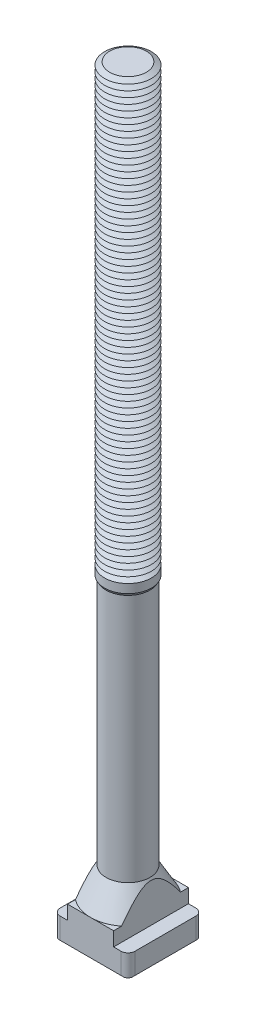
ISO-10303-21;
HEADER;
FILE_DESCRIPTION(('STEP AP214'),'2;1');
FILE_NAME('part.step','',(''),(''),'','','');
FILE_SCHEMA(('AUTOMOTIVE_DESIGN { 1 0 10303 214 1 1 1 1 }'));
ENDSEC;
DATA;
#1=APPLICATION_CONTEXT('core data for automotive mechanical design processes');
#2=APPLICATION_PROTOCOL_DEFINITION('international standard','automotive_design',2000,#1);
#3=PRODUCT_CONTEXT('',#1,'mechanical');
#4=PRODUCT('Part','Part','',(#3));
#5=PRODUCT_RELATED_PRODUCT_CATEGORY('part','',(#4));
#6=PRODUCT_DEFINITION_FORMATION('','',#4);
#7=PRODUCT_DEFINITION_CONTEXT('part definition',#1,'design');
#8=PRODUCT_DEFINITION('design','',#6,#7);
#9=PRODUCT_DEFINITION_SHAPE('','',#8);
#10=(LENGTH_UNIT() NAMED_UNIT(*) SI_UNIT(.MILLI.,.METRE.));
#11=(NAMED_UNIT(*) PLANE_ANGLE_UNIT() SI_UNIT($,.RADIAN.));
#12=(NAMED_UNIT(*) SI_UNIT($,.STERADIAN.) SOLID_ANGLE_UNIT());
#13=UNCERTAINTY_MEASURE_WITH_UNIT(LENGTH_MEASURE(1.E-05),#10,'distance_accuracy_value','');
#14=(GEOMETRIC_REPRESENTATION_CONTEXT(3) GLOBAL_UNCERTAINTY_ASSIGNED_CONTEXT((#13)) GLOBAL_UNIT_ASSIGNED_CONTEXT((#10,
#11,#12)) REPRESENTATION_CONTEXT('',''));
#15=CARTESIAN_POINT('',(0.,0.,0.));
#16=DIRECTION('',(0.,0.,1.));
#17=DIRECTION('',(1.,0.,0.));
#18=AXIS2_PLACEMENT_3D('',#15,#16,#17);
#19=CARTESIAN_POINT('',(0.,317.,0.));
#20=DIRECTION('',(0.,-1.,0.));
#21=DIRECTION('',(0.,0.,-1.));
#22=AXIS2_PLACEMENT_3D('',#19,#20,#21);
#23=CONICAL_SURFACE('',#22,7.83493649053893,1.04719755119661);
#24=CARTESIAN_POINT('',(0.,315.75,0.));
#25=DIRECTION('',(0.,-1.,0.));
#26=DIRECTION('',(0.,0.,-1.));
#27=AXIS2_PLACEMENT_3D('',#24,#25,#26);
#28=CIRCLE('',#27,10.);
#29=CARTESIAN_POINT('',(0.,315.75,-10.));
#30=VERTEX_POINT('',#29);
#31=EDGE_CURVE('E2640',#30,#30,#28,.T.);
#32=ORIENTED_EDGE('',*,*,#31,.F.);
#33=EDGE_LOOP('',(#32));
#34=FACE_BOUND('',#33,.T.);
#35=CARTESIAN_POINT('',(0.,317.,0.));
#36=DIRECTION('',(0.,-1.,0.));
#37=DIRECTION('',(0.,0.,-1.));
#38=AXIS2_PLACEMENT_3D('',#35,#36,#37);
#39=CIRCLE('',#38,7.83493649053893);
#40=CARTESIAN_POINT('',(0.,317.,-7.83493649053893));
#41=VERTEX_POINT('',#40);
#42=EDGE_CURVE('E2645',#41,#41,#39,.T.);
#43=ORIENTED_EDGE('',*,*,#42,.T.);
#44=EDGE_LOOP('',(#43));
#45=FACE_BOUND('',#44,.T.);
#46=ADVANCED_FACE('F39',(#34,#45),#23,.T.);
#47=CARTESIAN_POINT('',(0.,318.25,0.));
#48=DIRECTION('',(0.,1.,0.));
#49=DIRECTION('',(0.,0.,1.));
#50=AXIS2_PLACEMENT_3D('',#47,#48,#49);
#51=CONICAL_SURFACE('',#50,10.,1.04719755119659);
#52=ORIENTED_EDGE('',*,*,#42,.F.);
#53=EDGE_LOOP('',(#52));
#54=FACE_BOUND('',#53,.T.);
#55=CARTESIAN_POINT('',(0.,318.25,0.));
#56=DIRECTION('',(0.,-1.,0.));
#57=DIRECTION('',(0.,0.,-1.));
#58=AXIS2_PLACEMENT_3D('',#55,#56,#57);
#59=CIRCLE('',#58,10.);
#60=CARTESIAN_POINT('',(0.,318.25,-10.));
#61=VERTEX_POINT('',#60);
#62=EDGE_CURVE('E2653',#61,#61,#59,.T.);
#63=ORIENTED_EDGE('',*,*,#62,.T.);
#64=EDGE_LOOP('',(#63));
#65=FACE_BOUND('',#64,.T.);
#66=ADVANCED_FACE('F448',(#54,#65),#51,.T.);
#67=CARTESIAN_POINT('',(4.86866966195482,327.,0.));
#68=DIRECTION('',(0.,-1.,0.));
#69=DIRECTION('',(1.,0.,0.));
#70=AXIS2_PLACEMENT_3D('',#67,#68,#69);
#71=PLANE('',#70);
#72=CARTESIAN_POINT('',(0.,327.,0.));
#73=DIRECTION('',(0.,-1.,0.));
#74=DIRECTION('',(0.,0.,-1.));
#75=AXIS2_PLACEMENT_3D('',#72,#73,#74);
#76=CIRCLE('',#75,7.83493649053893);
#77=CARTESIAN_POINT('',(0.,327.,-7.83493649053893));
#78=VERTEX_POINT('',#77);
#79=EDGE_CURVE('E689',#78,#78,#76,.T.);
#80=ORIENTED_EDGE('',*,*,#79,.F.);
#81=EDGE_LOOP('',(#80));
#82=FACE_BOUND('',#81,.T.);
#83=ADVANCED_FACE('F454',(#82),#71,.F.);
#84=CARTESIAN_POINT('',(0.,327.,0.));
#85=DIRECTION('',(0.,-1.,0.));
#86=DIRECTION('',(0.,0.,-1.));
#87=AXIS2_PLACEMENT_3D('',#84,#85,#86);
#88=CONICAL_SURFACE('',#87,7.83493649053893,1.04719755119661);
#89=CARTESIAN_POINT('',(0.,325.75,0.));
#90=DIRECTION('',(0.,-1.,0.));
#91=DIRECTION('',(0.,0.,-1.));
#92=AXIS2_PLACEMENT_3D('',#89,#90,#91);
#93=CIRCLE('',#92,10.);
#94=CARTESIAN_POINT('',(0.,325.75,-10.));
#95=VERTEX_POINT('',#94);
#96=EDGE_CURVE('E687',#95,#95,#93,.T.);
#97=ORIENTED_EDGE('',*,*,#96,.F.);
#98=EDGE_LOOP('',(#97));
#99=FACE_BOUND('',#98,.T.);
#100=ORIENTED_EDGE('',*,*,#79,.T.);
#101=EDGE_LOOP('',(#100));
#102=FACE_BOUND('',#101,.T.);
#103=ADVANCED_FACE('F482',(#99,#102),#88,.T.);
#104=CARTESIAN_POINT('',(0.,325.75,0.));
#105=DIRECTION('',(0.,1.,0.));
#106=DIRECTION('',(0.,0.,1.));
#107=AXIS2_PLACEMENT_3D('',#104,#105,#106);
#108=CONICAL_SURFACE('',#107,10.,1.04719755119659);
#109=CARTESIAN_POINT('',(0.,324.5,0.));
#110=DIRECTION('',(0.,-1.,0.));
#111=DIRECTION('',(0.,0.,-1.));
#112=AXIS2_PLACEMENT_3D('',#109,#110,#111);
#113=CIRCLE('',#112,7.83493649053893);
#114=CARTESIAN_POINT('',(0.,324.5,-7.83493649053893));
#115=VERTEX_POINT('',#114);
#116=EDGE_CURVE('E690',#115,#115,#113,.T.);
#117=ORIENTED_EDGE('',*,*,#116,.F.);
#118=EDGE_LOOP('',(#117));
#119=FACE_BOUND('',#118,.T.);
#120=ORIENTED_EDGE('',*,*,#96,.T.);
#121=EDGE_LOOP('',(#120));
#122=FACE_BOUND('',#121,.T.);
#123=ADVANCED_FACE('F479',(#119,#122),#108,.T.);
#124=CARTESIAN_POINT('',(0.,324.5,0.));
#125=DIRECTION('',(0.,-1.,0.));
#126=DIRECTION('',(0.,0.,-1.));
#127=AXIS2_PLACEMENT_3D('',#124,#125,#126);
#128=CONICAL_SURFACE('',#127,7.83493649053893,1.04719755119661);
#129=CARTESIAN_POINT('',(0.,323.25,0.));
#130=DIRECTION('',(0.,-1.,0.));
#131=DIRECTION('',(0.,0.,-1.));
#132=AXIS2_PLACEMENT_3D('',#129,#130,#131);
#133=CIRCLE('',#132,10.);
#134=CARTESIAN_POINT('',(0.,323.25,-10.));
#135=VERTEX_POINT('',#134);
#136=EDGE_CURVE('E2669',#135,#135,#133,.T.);
#137=ORIENTED_EDGE('',*,*,#136,.F.);
#138=EDGE_LOOP('',(#137));
#139=FACE_BOUND('',#138,.T.);
#140=ORIENTED_EDGE('',*,*,#116,.T.);
#141=EDGE_LOOP('',(#140));
#142=FACE_BOUND('',#141,.T.);
#143=ADVANCED_FACE('F474',(#139,#142),#128,.T.);
#144=CARTESIAN_POINT('',(0.,323.25,0.));
#145=DIRECTION('',(0.,1.,0.));
#146=DIRECTION('',(0.,0.,1.));
#147=AXIS2_PLACEMENT_3D('',#144,#145,#146);
#148=CONICAL_SURFACE('',#147,10.,1.04719755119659);
#149=CARTESIAN_POINT('',(0.,322.,0.));
#150=DIRECTION('',(0.,-1.,0.));
#151=DIRECTION('',(0.,0.,-1.));
#152=AXIS2_PLACEMENT_3D('',#149,#150,#151);
#153=CIRCLE('',#152,7.83493649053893);
#154=CARTESIAN_POINT('',(0.,322.,-7.83493649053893));
#155=VERTEX_POINT('',#154);
#156=EDGE_CURVE('E2665',#155,#155,#153,.T.);
#157=ORIENTED_EDGE('',*,*,#156,.F.);
#158=EDGE_LOOP('',(#157));
#159=FACE_BOUND('',#158,.T.);
#160=ORIENTED_EDGE('',*,*,#136,.T.);
#161=EDGE_LOOP('',(#160));
#162=FACE_BOUND('',#161,.T.);
#163=ADVANCED_FACE('F471',(#159,#162),#148,.T.);
#164=CARTESIAN_POINT('',(0.,322.,0.));
#165=DIRECTION('',(0.,-1.,0.));
#166=DIRECTION('',(0.,0.,-1.));
#167=AXIS2_PLACEMENT_3D('',#164,#165,#166);
#168=CONICAL_SURFACE('',#167,7.83493649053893,1.04719755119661);
#169=CARTESIAN_POINT('',(0.,320.75,0.));
#170=DIRECTION('',(0.,-1.,0.));
#171=DIRECTION('',(0.,0.,-1.));
#172=AXIS2_PLACEMENT_3D('',#169,#170,#171);
#173=CIRCLE('',#172,10.);
#174=CARTESIAN_POINT('',(0.,320.75,-10.));
#175=VERTEX_POINT('',#174);
#176=EDGE_CURVE('E2661',#175,#175,#173,.T.);
#177=ORIENTED_EDGE('',*,*,#176,.F.);
#178=EDGE_LOOP('',(#177));
#179=FACE_BOUND('',#178,.T.);
#180=ORIENTED_EDGE('',*,*,#156,.T.);
#181=EDGE_LOOP('',(#180));
#182=FACE_BOUND('',#181,.T.);
#183=ADVANCED_FACE('F465',(#179,#182),#168,.T.);
#184=CARTESIAN_POINT('',(0.,320.75,0.));
#185=DIRECTION('',(0.,1.,0.));
#186=DIRECTION('',(0.,0.,1.));
#187=AXIS2_PLACEMENT_3D('',#184,#185,#186);
#188=CONICAL_SURFACE('',#187,10.,1.04719755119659);
#189=CARTESIAN_POINT('',(0.,319.5,0.));
#190=DIRECTION('',(0.,-1.,0.));
#191=DIRECTION('',(0.,0.,-1.));
#192=AXIS2_PLACEMENT_3D('',#189,#190,#191);
#193=CIRCLE('',#192,7.83493649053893);
#194=CARTESIAN_POINT('',(0.,319.5,-7.83493649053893));
#195=VERTEX_POINT('',#194);
#196=EDGE_CURVE('E2657',#195,#195,#193,.T.);
#197=ORIENTED_EDGE('',*,*,#196,.F.);
#198=EDGE_LOOP('',(#197));
#199=FACE_BOUND('',#198,.T.);
#200=ORIENTED_EDGE('',*,*,#176,.T.);
#201=EDGE_LOOP('',(#200));
#202=FACE_BOUND('',#201,.T.);
#203=ADVANCED_FACE('F461',(#199,#202),#188,.T.);
#204=CARTESIAN_POINT('',(0.,319.5,0.));
#205=DIRECTION('',(0.,-1.,0.));
#206=DIRECTION('',(0.,0.,-1.));
#207=AXIS2_PLACEMENT_3D('',#204,#205,#206);
#208=CONICAL_SURFACE('',#207,7.83493649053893,1.04719755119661);
#209=ORIENTED_EDGE('',*,*,#62,.F.);
#210=EDGE_LOOP('',(#209));
#211=FACE_BOUND('',#210,.T.);
#212=ORIENTED_EDGE('',*,*,#196,.T.);
#213=EDGE_LOOP('',(#212));
#214=FACE_BOUND('',#213,.T.);
#215=ADVANCED_FACE('F464',(#211,#214),#208,.T.);
#216=CARTESIAN_POINT('',(0.,314.5,0.));
#217=DIRECTION('',(0.,-1.,0.));
#218=DIRECTION('',(0.,0.,-1.));
#219=AXIS2_PLACEMENT_3D('',#216,#217,#218);
#220=CONICAL_SURFACE('',#219,7.83493649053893,1.04719755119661);
#221=CARTESIAN_POINT('',(0.,313.25,0.));
#222=DIRECTION('',(0.,-1.,0.));
#223=DIRECTION('',(0.,0.,-1.));
#224=AXIS2_PLACEMENT_3D('',#221,#222,#223);
#225=CIRCLE('',#224,10.);
#226=CARTESIAN_POINT('',(0.,313.25,-10.));
#227=VERTEX_POINT('',#226);
#228=EDGE_CURVE('E765',#227,#227,#225,.T.);
#229=ORIENTED_EDGE('',*,*,#228,.F.);
#230=EDGE_LOOP('',(#229));
#231=FACE_BOUND('',#230,.T.);
#232=CARTESIAN_POINT('',(0.,314.5,0.));
#233=DIRECTION('',(0.,-1.,0.));
#234=DIRECTION('',(0.,0.,-1.));
#235=AXIS2_PLACEMENT_3D('',#232,#233,#234);
#236=CIRCLE('',#235,7.83493649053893);
#237=CARTESIAN_POINT('',(0.,314.5,-7.83493649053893));
#238=VERTEX_POINT('',#237);
#239=EDGE_CURVE('E2638',#238,#238,#236,.T.);
#240=ORIENTED_EDGE('',*,*,#239,.T.);
#241=EDGE_LOOP('',(#240));
#242=FACE_BOUND('',#241,.T.);
#243=ADVANCED_FACE('F469',(#231,#242),#220,.T.);
#244=CARTESIAN_POINT('',(0.,315.75,0.));
#245=DIRECTION('',(0.,1.,0.));
#246=DIRECTION('',(0.,0.,1.));
#247=AXIS2_PLACEMENT_3D('',#244,#245,#246);
#248=CONICAL_SURFACE('',#247,10.,1.04719755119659);
#249=ORIENTED_EDGE('',*,*,#239,.F.);
#250=EDGE_LOOP('',(#249));
#251=FACE_BOUND('',#250,.T.);
#252=ORIENTED_EDGE('',*,*,#31,.T.);
#253=EDGE_LOOP('',(#252));
#254=FACE_BOUND('',#253,.T.);
#255=ADVANCED_FACE('F2228',(#251,#254),#248,.T.);
#256=CARTESIAN_POINT('',(0.,312.,0.));
#257=DIRECTION('',(0.,-1.,0.));
#258=DIRECTION('',(0.,0.,-1.));
#259=AXIS2_PLACEMENT_3D('',#256,#257,#258);
#260=CONICAL_SURFACE('',#259,7.83493649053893,1.04719755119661);
#261=CARTESIAN_POINT('',(0.,310.75,0.));
#262=DIRECTION('',(0.,-1.,0.));
#263=DIRECTION('',(0.,0.,-1.));
#264=AXIS2_PLACEMENT_3D('',#261,#262,#263);
#265=CIRCLE('',#264,10.);
#266=CARTESIAN_POINT('',(0.,310.75,-10.));
#267=VERTEX_POINT('',#266);
#268=EDGE_CURVE('E766',#267,#267,#265,.T.);
#269=ORIENTED_EDGE('',*,*,#268,.F.);
#270=EDGE_LOOP('',(#269));
#271=FACE_BOUND('',#270,.T.);
#272=CARTESIAN_POINT('',(0.,312.,0.));
#273=DIRECTION('',(0.,-1.,0.));
#274=DIRECTION('',(0.,0.,-1.));
#275=AXIS2_PLACEMENT_3D('',#272,#273,#274);
#276=CIRCLE('',#275,7.83493649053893);
#277=CARTESIAN_POINT('',(0.,312.,-7.83493649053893));
#278=VERTEX_POINT('',#277);
#279=EDGE_CURVE('E762',#278,#278,#276,.T.);
#280=ORIENTED_EDGE('',*,*,#279,.T.);
#281=EDGE_LOOP('',(#280));
#282=FACE_BOUND('',#281,.T.);
#283=ADVANCED_FACE('F2218',(#271,#282),#260,.T.);
#284=CARTESIAN_POINT('',(0.,313.25,0.));
#285=DIRECTION('',(0.,1.,0.));
#286=DIRECTION('',(0.,0.,1.));
#287=AXIS2_PLACEMENT_3D('',#284,#285,#286);
#288=CONICAL_SURFACE('',#287,10.,1.04719755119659);
#289=ORIENTED_EDGE('',*,*,#279,.F.);
#290=EDGE_LOOP('',(#289));
#291=FACE_BOUND('',#290,.T.);
#292=ORIENTED_EDGE('',*,*,#228,.T.);
#293=EDGE_LOOP('',(#292));
#294=FACE_BOUND('',#293,.T.);
#295=ADVANCED_FACE('F2208',(#291,#294),#288,.T.);
#296=CARTESIAN_POINT('',(0.,309.5,0.));
#297=DIRECTION('',(0.,-1.,0.));
#298=DIRECTION('',(0.,0.,-1.));
#299=AXIS2_PLACEMENT_3D('',#296,#297,#298);
#300=CONICAL_SURFACE('',#299,7.83493649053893,1.04719755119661);
#301=CARTESIAN_POINT('',(0.,308.25,0.));
#302=DIRECTION('',(0.,-1.,0.));
#303=DIRECTION('',(0.,0.,-1.));
#304=AXIS2_PLACEMENT_3D('',#301,#302,#303);
#305=CIRCLE('',#304,10.);
#306=CARTESIAN_POINT('',(0.,308.25,-10.));
#307=VERTEX_POINT('',#306);
#308=EDGE_CURVE('E757',#307,#307,#305,.T.);
#309=ORIENTED_EDGE('',*,*,#308,.F.);
#310=EDGE_LOOP('',(#309));
#311=FACE_BOUND('',#310,.T.);
#312=CARTESIAN_POINT('',(0.,309.5,0.));
#313=DIRECTION('',(0.,-1.,0.));
#314=DIRECTION('',(0.,0.,-1.));
#315=AXIS2_PLACEMENT_3D('',#312,#313,#314);
#316=CIRCLE('',#315,7.83493649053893);
#317=CARTESIAN_POINT('',(0.,309.5,-7.83493649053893));
#318=VERTEX_POINT('',#317);
#319=EDGE_CURVE('E760',#318,#318,#316,.T.);
#320=ORIENTED_EDGE('',*,*,#319,.T.);
#321=EDGE_LOOP('',(#320));
#322=FACE_BOUND('',#321,.T.);
#323=ADVANCED_FACE('F2198',(#311,#322),#300,.T.);
#324=CARTESIAN_POINT('',(0.,310.75,0.));
#325=DIRECTION('',(0.,1.,0.));
#326=DIRECTION('',(0.,0.,1.));
#327=AXIS2_PLACEMENT_3D('',#324,#325,#326);
#328=CONICAL_SURFACE('',#327,10.,1.04719755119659);
#329=ORIENTED_EDGE('',*,*,#319,.F.);
#330=EDGE_LOOP('',(#329));
#331=FACE_BOUND('',#330,.T.);
#332=ORIENTED_EDGE('',*,*,#268,.T.);
#333=EDGE_LOOP('',(#332));
#334=FACE_BOUND('',#333,.T.);
#335=ADVANCED_FACE('F2188',(#331,#334),#328,.T.);
#336=CARTESIAN_POINT('',(0.,307.,0.));
#337=DIRECTION('',(0.,-1.,0.));
#338=DIRECTION('',(0.,0.,-1.));
#339=AXIS2_PLACEMENT_3D('',#336,#337,#338);
#340=CONICAL_SURFACE('',#339,7.83493649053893,1.04719755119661);
#341=CARTESIAN_POINT('',(0.,305.75,0.));
#342=DIRECTION('',(0.,-1.,0.));
#343=DIRECTION('',(0.,0.,-1.));
#344=AXIS2_PLACEMENT_3D('',#341,#342,#343);
#345=CIRCLE('',#344,10.);
#346=CARTESIAN_POINT('',(0.,305.75,-10.));
#347=VERTEX_POINT('',#346);
#348=EDGE_CURVE('E681',#347,#347,#345,.T.);
#349=ORIENTED_EDGE('',*,*,#348,.F.);
#350=EDGE_LOOP('',(#349));
#351=FACE_BOUND('',#350,.T.);
#352=CARTESIAN_POINT('',(0.,307.,0.));
#353=DIRECTION('',(0.,-1.,0.));
#354=DIRECTION('',(0.,0.,-1.));
#355=AXIS2_PLACEMENT_3D('',#352,#353,#354);
#356=CIRCLE('',#355,7.83493649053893);
#357=CARTESIAN_POINT('',(0.,307.,-7.83493649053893));
#358=VERTEX_POINT('',#357);
#359=EDGE_CURVE('E684',#358,#358,#356,.T.);
#360=ORIENTED_EDGE('',*,*,#359,.T.);
#361=EDGE_LOOP('',(#360));
#362=FACE_BOUND('',#361,.T.);
#363=ADVANCED_FACE('F2178',(#351,#362),#340,.T.);
#364=CARTESIAN_POINT('',(0.,308.25,0.));
#365=DIRECTION('',(0.,1.,0.));
#366=DIRECTION('',(0.,0.,1.));
#367=AXIS2_PLACEMENT_3D('',#364,#365,#366);
#368=CONICAL_SURFACE('',#367,10.,1.04719755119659);
#369=ORIENTED_EDGE('',*,*,#359,.F.);
#370=EDGE_LOOP('',(#369));
#371=FACE_BOUND('',#370,.T.);
#372=ORIENTED_EDGE('',*,*,#308,.T.);
#373=EDGE_LOOP('',(#372));
#374=FACE_BOUND('',#373,.T.);
#375=ADVANCED_FACE('F2168',(#371,#374),#368,.T.);
#376=CARTESIAN_POINT('',(0.,304.5,0.));
#377=DIRECTION('',(0.,-1.,0.));
#378=DIRECTION('',(0.,0.,-1.));
#379=AXIS2_PLACEMENT_3D('',#376,#377,#378);
#380=CONICAL_SURFACE('',#379,7.83493649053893,1.04719755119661);
#381=CARTESIAN_POINT('',(0.,303.25,0.));
#382=DIRECTION('',(0.,-1.,0.));
#383=DIRECTION('',(0.,0.,-1.));
#384=AXIS2_PLACEMENT_3D('',#381,#382,#383);
#385=CIRCLE('',#384,10.);
#386=CARTESIAN_POINT('',(0.,303.25,-10.));
#387=VERTEX_POINT('',#386);
#388=EDGE_CURVE('E754',#387,#387,#385,.T.);
#389=ORIENTED_EDGE('',*,*,#388,.F.);
#390=EDGE_LOOP('',(#389));
#391=FACE_BOUND('',#390,.T.);
#392=CARTESIAN_POINT('',(0.,304.5,0.));
#393=DIRECTION('',(0.,-1.,0.));
#394=DIRECTION('',(0.,0.,-1.));
#395=AXIS2_PLACEMENT_3D('',#392,#393,#394);
#396=CIRCLE('',#395,7.83493649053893);
#397=CARTESIAN_POINT('',(0.,304.5,-7.83493649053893));
#398=VERTEX_POINT('',#397);
#399=EDGE_CURVE('E685',#398,#398,#396,.T.);
#400=ORIENTED_EDGE('',*,*,#399,.T.);
#401=EDGE_LOOP('',(#400));
#402=FACE_BOUND('',#401,.T.);
#403=ADVANCED_FACE('F2158',(#391,#402),#380,.T.);
#404=CARTESIAN_POINT('',(0.,305.75,0.));
#405=DIRECTION('',(0.,1.,0.));
#406=DIRECTION('',(0.,0.,1.));
#407=AXIS2_PLACEMENT_3D('',#404,#405,#406);
#408=CONICAL_SURFACE('',#407,10.,1.04719755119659);
#409=ORIENTED_EDGE('',*,*,#399,.F.);
#410=EDGE_LOOP('',(#409));
#411=FACE_BOUND('',#410,.T.);
#412=ORIENTED_EDGE('',*,*,#348,.T.);
#413=EDGE_LOOP('',(#412));
#414=FACE_BOUND('',#413,.T.);
#415=ADVANCED_FACE('F2148',(#411,#414),#408,.T.);
#416=CARTESIAN_POINT('',(0.,302.,0.));
#417=DIRECTION('',(0.,-1.,0.));
#418=DIRECTION('',(0.,0.,-1.));
#419=AXIS2_PLACEMENT_3D('',#416,#417,#418);
#420=CONICAL_SURFACE('',#419,7.83493649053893,1.04719755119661);
#421=CARTESIAN_POINT('',(0.,300.75,0.));
#422=DIRECTION('',(0.,-1.,0.));
#423=DIRECTION('',(0.,0.,-1.));
#424=AXIS2_PLACEMENT_3D('',#421,#422,#423);
#425=CIRCLE('',#424,10.);
#426=CARTESIAN_POINT('',(0.,300.75,-10.));
#427=VERTEX_POINT('',#426);
#428=EDGE_CURVE('E755',#427,#427,#425,.T.);
#429=ORIENTED_EDGE('',*,*,#428,.F.);
#430=EDGE_LOOP('',(#429));
#431=FACE_BOUND('',#430,.T.);
#432=CARTESIAN_POINT('',(0.,302.,0.));
#433=DIRECTION('',(0.,-1.,0.));
#434=DIRECTION('',(0.,0.,-1.));
#435=AXIS2_PLACEMENT_3D('',#432,#433,#434);
#436=CIRCLE('',#435,7.83493649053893);
#437=CARTESIAN_POINT('',(0.,302.,-7.83493649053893));
#438=VERTEX_POINT('',#437);
#439=EDGE_CURVE('E751',#438,#438,#436,.T.);
#440=ORIENTED_EDGE('',*,*,#439,.T.);
#441=EDGE_LOOP('',(#440));
#442=FACE_BOUND('',#441,.T.);
#443=ADVANCED_FACE('F2138',(#431,#442),#420,.T.);
#444=CARTESIAN_POINT('',(0.,303.25,0.));
#445=DIRECTION('',(0.,1.,0.));
#446=DIRECTION('',(0.,0.,1.));
#447=AXIS2_PLACEMENT_3D('',#444,#445,#446);
#448=CONICAL_SURFACE('',#447,10.,1.04719755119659);
#449=ORIENTED_EDGE('',*,*,#439,.F.);
#450=EDGE_LOOP('',(#449));
#451=FACE_BOUND('',#450,.T.);
#452=ORIENTED_EDGE('',*,*,#388,.T.);
#453=EDGE_LOOP('',(#452));
#454=FACE_BOUND('',#453,.T.);
#455=ADVANCED_FACE('F2128',(#451,#454),#448,.T.);
#456=CARTESIAN_POINT('',(0.,299.5,0.));
#457=DIRECTION('',(0.,-1.,0.));
#458=DIRECTION('',(0.,0.,-1.));
#459=AXIS2_PLACEMENT_3D('',#456,#457,#458);
#460=CONICAL_SURFACE('',#459,7.83493649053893,1.04719755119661);
#461=CARTESIAN_POINT('',(0.,298.25,0.));
#462=DIRECTION('',(0.,-1.,0.));
#463=DIRECTION('',(0.,0.,-1.));
#464=AXIS2_PLACEMENT_3D('',#461,#462,#463);
#465=CIRCLE('',#464,10.);
#466=CARTESIAN_POINT('',(0.,298.25,-10.));
#467=VERTEX_POINT('',#466);
#468=EDGE_CURVE('E2723',#467,#467,#465,.T.);
#469=ORIENTED_EDGE('',*,*,#468,.F.);
#470=EDGE_LOOP('',(#469));
#471=FACE_BOUND('',#470,.T.);
#472=CARTESIAN_POINT('',(0.,299.5,0.));
#473=DIRECTION('',(0.,-1.,0.));
#474=DIRECTION('',(0.,0.,-1.));
#475=AXIS2_PLACEMENT_3D('',#472,#473,#474);
#476=CIRCLE('',#475,7.83493649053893);
#477=CARTESIAN_POINT('',(0.,299.5,-7.83493649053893));
#478=VERTEX_POINT('',#477);
#479=EDGE_CURVE('E2726',#478,#478,#476,.T.);
#480=ORIENTED_EDGE('',*,*,#479,.T.);
#481=EDGE_LOOP('',(#480));
#482=FACE_BOUND('',#481,.T.);
#483=ADVANCED_FACE('F2118',(#471,#482),#460,.T.);
#484=CARTESIAN_POINT('',(0.,300.75,0.));
#485=DIRECTION('',(0.,1.,0.));
#486=DIRECTION('',(0.,0.,1.));
#487=AXIS2_PLACEMENT_3D('',#484,#485,#486);
#488=CONICAL_SURFACE('',#487,10.,1.04719755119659);
#489=ORIENTED_EDGE('',*,*,#479,.F.);
#490=EDGE_LOOP('',(#489));
#491=FACE_BOUND('',#490,.T.);
#492=ORIENTED_EDGE('',*,*,#428,.T.);
#493=EDGE_LOOP('',(#492));
#494=FACE_BOUND('',#493,.T.);
#495=ADVANCED_FACE('F2108',(#491,#494),#488,.T.);
#496=CARTESIAN_POINT('',(0.,297.,0.));
#497=DIRECTION('',(0.,-1.,0.));
#498=DIRECTION('',(0.,0.,-1.));
#499=AXIS2_PLACEMENT_3D('',#496,#497,#498);
#500=CONICAL_SURFACE('',#499,7.83493649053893,1.04719755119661);
#501=CARTESIAN_POINT('',(0.,295.75,0.));
#502=DIRECTION('',(0.,-1.,0.));
#503=DIRECTION('',(0.,0.,-1.));
#504=AXIS2_PLACEMENT_3D('',#501,#502,#503);
#505=CIRCLE('',#504,10.);
#506=CARTESIAN_POINT('',(0.,295.75,-10.));
#507=VERTEX_POINT('',#506);
#508=EDGE_CURVE('E812',#507,#507,#505,.T.);
#509=ORIENTED_EDGE('',*,*,#508,.F.);
#510=EDGE_LOOP('',(#509));
#511=FACE_BOUND('',#510,.T.);
#512=CARTESIAN_POINT('',(0.,297.,0.));
#513=DIRECTION('',(0.,-1.,0.));
#514=DIRECTION('',(0.,0.,-1.));
#515=AXIS2_PLACEMENT_3D('',#512,#513,#514);
#516=CIRCLE('',#515,7.83493649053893);
#517=CARTESIAN_POINT('',(0.,297.,-7.83493649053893));
#518=VERTEX_POINT('',#517);
#519=EDGE_CURVE('E2727',#518,#518,#516,.T.);
#520=ORIENTED_EDGE('',*,*,#519,.T.);
#521=EDGE_LOOP('',(#520));
#522=FACE_BOUND('',#521,.T.);
#523=ADVANCED_FACE('F2098',(#511,#522),#500,.T.);
#524=CARTESIAN_POINT('',(0.,298.25,0.));
#525=DIRECTION('',(0.,1.,0.));
#526=DIRECTION('',(0.,0.,1.));
#527=AXIS2_PLACEMENT_3D('',#524,#525,#526);
#528=CONICAL_SURFACE('',#527,10.,1.04719755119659);
#529=ORIENTED_EDGE('',*,*,#519,.F.);
#530=EDGE_LOOP('',(#529));
#531=FACE_BOUND('',#530,.T.);
#532=ORIENTED_EDGE('',*,*,#468,.T.);
#533=EDGE_LOOP('',(#532));
#534=FACE_BOUND('',#533,.T.);
#535=ADVANCED_FACE('F2088',(#531,#534),#528,.T.);
#536=CARTESIAN_POINT('',(0.,294.5,0.));
#537=DIRECTION('',(0.,-1.,0.));
#538=DIRECTION('',(0.,0.,-1.));
#539=AXIS2_PLACEMENT_3D('',#536,#537,#538);
#540=CONICAL_SURFACE('',#539,7.83493649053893,1.04719755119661);
#541=CARTESIAN_POINT('',(0.,293.25,0.));
#542=DIRECTION('',(0.,-1.,0.));
#543=DIRECTION('',(0.,0.,-1.));
#544=AXIS2_PLACEMENT_3D('',#541,#542,#543);
#545=CIRCLE('',#544,10.);
#546=CARTESIAN_POINT('',(0.,293.25,-10.));
#547=VERTEX_POINT('',#546);
#548=EDGE_CURVE('E813',#547,#547,#545,.T.);
#549=ORIENTED_EDGE('',*,*,#548,.F.);
#550=EDGE_LOOP('',(#549));
#551=FACE_BOUND('',#550,.T.);
#552=CARTESIAN_POINT('',(0.,294.5,0.));
#553=DIRECTION('',(0.,-1.,0.));
#554=DIRECTION('',(0.,0.,-1.));
#555=AXIS2_PLACEMENT_3D('',#552,#553,#554);
#556=CIRCLE('',#555,7.83493649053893);
#557=CARTESIAN_POINT('',(0.,294.5,-7.83493649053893));
#558=VERTEX_POINT('',#557);
#559=EDGE_CURVE('E809',#558,#558,#556,.T.);
#560=ORIENTED_EDGE('',*,*,#559,.T.);
#561=EDGE_LOOP('',(#560));
#562=FACE_BOUND('',#561,.T.);
#563=ADVANCED_FACE('F2078',(#551,#562),#540,.T.);
#564=CARTESIAN_POINT('',(0.,295.75,0.));
#565=DIRECTION('',(0.,1.,0.));
#566=DIRECTION('',(0.,0.,1.));
#567=AXIS2_PLACEMENT_3D('',#564,#565,#566);
#568=CONICAL_SURFACE('',#567,10.,1.04719755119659);
#569=ORIENTED_EDGE('',*,*,#559,.F.);
#570=EDGE_LOOP('',(#569));
#571=FACE_BOUND('',#570,.T.);
#572=ORIENTED_EDGE('',*,*,#508,.T.);
#573=EDGE_LOOP('',(#572));
#574=FACE_BOUND('',#573,.T.);
#575=ADVANCED_FACE('F2068',(#571,#574),#568,.T.);
#576=CARTESIAN_POINT('',(0.,292.,0.));
#577=DIRECTION('',(0.,-1.,0.));
#578=DIRECTION('',(0.,0.,-1.));
#579=AXIS2_PLACEMENT_3D('',#576,#577,#578);
#580=CONICAL_SURFACE('',#579,7.83493649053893,1.04719755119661);
#581=CARTESIAN_POINT('',(0.,290.75,0.));
#582=DIRECTION('',(0.,-1.,0.));
#583=DIRECTION('',(0.,0.,-1.));
#584=AXIS2_PLACEMENT_3D('',#581,#582,#583);
#585=CIRCLE('',#584,10.);
#586=CARTESIAN_POINT('',(0.,290.75,-10.));
#587=VERTEX_POINT('',#586);
#588=EDGE_CURVE('E2799',#587,#587,#585,.T.);
#589=ORIENTED_EDGE('',*,*,#588,.F.);
#590=EDGE_LOOP('',(#589));
#591=FACE_BOUND('',#590,.T.);
#592=CARTESIAN_POINT('',(0.,292.,0.));
#593=DIRECTION('',(0.,-1.,0.));
#594=DIRECTION('',(0.,0.,-1.));
#595=AXIS2_PLACEMENT_3D('',#592,#593,#594);
#596=CIRCLE('',#595,7.83493649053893);
#597=CARTESIAN_POINT('',(0.,292.,-7.83493649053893));
#598=VERTEX_POINT('',#597);
#599=EDGE_CURVE('E2777',#598,#598,#596,.T.);
#600=ORIENTED_EDGE('',*,*,#599,.T.);
#601=EDGE_LOOP('',(#600));
#602=FACE_BOUND('',#601,.T.);
#603=ADVANCED_FACE('F2058',(#591,#602),#580,.T.);
#604=CARTESIAN_POINT('',(0.,293.25,0.));
#605=DIRECTION('',(0.,1.,0.));
#606=DIRECTION('',(0.,0.,1.));
#607=AXIS2_PLACEMENT_3D('',#604,#605,#606);
#608=CONICAL_SURFACE('',#607,10.,1.04719755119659);
#609=ORIENTED_EDGE('',*,*,#599,.F.);
#610=EDGE_LOOP('',(#609));
#611=FACE_BOUND('',#610,.T.);
#612=ORIENTED_EDGE('',*,*,#548,.T.);
#613=EDGE_LOOP('',(#612));
#614=FACE_BOUND('',#613,.T.);
#615=ADVANCED_FACE('F2048',(#611,#614),#608,.T.);
#616=CARTESIAN_POINT('',(0.,289.5,0.));
#617=DIRECTION('',(0.,-1.,0.));
#618=DIRECTION('',(0.,0.,-1.));
#619=AXIS2_PLACEMENT_3D('',#616,#617,#618);
#620=CONICAL_SURFACE('',#619,7.83493649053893,1.04719755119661);
#621=CARTESIAN_POINT('',(0.,288.25,0.));
#622=DIRECTION('',(0.,-1.,0.));
#623=DIRECTION('',(0.,0.,-1.));
#624=AXIS2_PLACEMENT_3D('',#621,#622,#623);
#625=CIRCLE('',#624,10.);
#626=CARTESIAN_POINT('',(0.,288.25,-10.));
#627=VERTEX_POINT('',#626);
#628=EDGE_CURVE('E2895',#627,#627,#625,.T.);
#629=ORIENTED_EDGE('',*,*,#628,.F.);
#630=EDGE_LOOP('',(#629));
#631=FACE_BOUND('',#630,.T.);
#632=CARTESIAN_POINT('',(0.,289.5,0.));
#633=DIRECTION('',(0.,-1.,0.));
#634=DIRECTION('',(0.,0.,-1.));
#635=AXIS2_PLACEMENT_3D('',#632,#633,#634);
#636=CIRCLE('',#635,7.83493649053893);
#637=CARTESIAN_POINT('',(0.,289.5,-7.83493649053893));
#638=VERTEX_POINT('',#637);
#639=EDGE_CURVE('E2901',#638,#638,#636,.T.);
#640=ORIENTED_EDGE('',*,*,#639,.T.);
#641=EDGE_LOOP('',(#640));
#642=FACE_BOUND('',#641,.T.);
#643=ADVANCED_FACE('F2038',(#631,#642),#620,.T.);
#644=CARTESIAN_POINT('',(0.,290.75,0.));
#645=DIRECTION('',(0.,1.,0.));
#646=DIRECTION('',(0.,0.,1.));
#647=AXIS2_PLACEMENT_3D('',#644,#645,#646);
#648=CONICAL_SURFACE('',#647,10.,1.04719755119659);
#649=ORIENTED_EDGE('',*,*,#639,.F.);
#650=EDGE_LOOP('',(#649));
#651=FACE_BOUND('',#650,.T.);
#652=ORIENTED_EDGE('',*,*,#588,.T.);
#653=EDGE_LOOP('',(#652));
#654=FACE_BOUND('',#653,.T.);
#655=ADVANCED_FACE('F2028',(#651,#654),#648,.T.);
#656=CARTESIAN_POINT('',(0.,287.,0.));
#657=DIRECTION('',(0.,-1.,0.));
#658=DIRECTION('',(0.,0.,-1.));
#659=AXIS2_PLACEMENT_3D('',#656,#657,#658);
#660=CONICAL_SURFACE('',#659,7.83493649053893,1.04719755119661);
#661=CARTESIAN_POINT('',(0.,285.75,0.));
#662=DIRECTION('',(0.,-1.,0.));
#663=DIRECTION('',(0.,0.,-1.));
#664=AXIS2_PLACEMENT_3D('',#661,#662,#663);
#665=CIRCLE('',#664,10.);
#666=CARTESIAN_POINT('',(0.,285.75,-10.));
#667=VERTEX_POINT('',#666);
#668=EDGE_CURVE('E2896',#667,#667,#665,.T.);
#669=ORIENTED_EDGE('',*,*,#668,.F.);
#670=EDGE_LOOP('',(#669));
#671=FACE_BOUND('',#670,.T.);
#672=CARTESIAN_POINT('',(0.,287.,0.));
#673=DIRECTION('',(0.,-1.,0.));
#674=DIRECTION('',(0.,0.,-1.));
#675=AXIS2_PLACEMENT_3D('',#672,#673,#674);
#676=CIRCLE('',#675,7.83493649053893);
#677=CARTESIAN_POINT('',(0.,287.,-7.83493649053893));
#678=VERTEX_POINT('',#677);
#679=EDGE_CURVE('E2893',#678,#678,#676,.T.);
#680=ORIENTED_EDGE('',*,*,#679,.T.);
#681=EDGE_LOOP('',(#680));
#682=FACE_BOUND('',#681,.T.);
#683=ADVANCED_FACE('F2018',(#671,#682),#660,.T.);
#684=CARTESIAN_POINT('',(0.,288.25,0.));
#685=DIRECTION('',(0.,1.,0.));
#686=DIRECTION('',(0.,0.,1.));
#687=AXIS2_PLACEMENT_3D('',#684,#685,#686);
#688=CONICAL_SURFACE('',#687,10.,1.04719755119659);
#689=ORIENTED_EDGE('',*,*,#679,.F.);
#690=EDGE_LOOP('',(#689));
#691=FACE_BOUND('',#690,.T.);
#692=ORIENTED_EDGE('',*,*,#628,.T.);
#693=EDGE_LOOP('',(#692));
#694=FACE_BOUND('',#693,.T.);
#695=ADVANCED_FACE('F2008',(#691,#694),#688,.T.);
#696=CARTESIAN_POINT('',(0.,284.5,0.));
#697=DIRECTION('',(0.,-1.,0.));
#698=DIRECTION('',(0.,0.,-1.));
#699=AXIS2_PLACEMENT_3D('',#696,#697,#698);
#700=CONICAL_SURFACE('',#699,7.83493649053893,1.04719755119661);
#701=CARTESIAN_POINT('',(0.,283.25,0.));
#702=DIRECTION('',(0.,-1.,0.));
#703=DIRECTION('',(0.,0.,-1.));
#704=AXIS2_PLACEMENT_3D('',#701,#702,#703);
#705=CIRCLE('',#704,10.);
#706=CARTESIAN_POINT('',(0.,283.25,-10.));
#707=VERTEX_POINT('',#706);
#708=EDGE_CURVE('E675',#707,#707,#705,.T.);
#709=ORIENTED_EDGE('',*,*,#708,.F.);
#710=EDGE_LOOP('',(#709));
#711=FACE_BOUND('',#710,.T.);
#712=CARTESIAN_POINT('',(0.,284.5,0.));
#713=DIRECTION('',(0.,-1.,0.));
#714=DIRECTION('',(0.,0.,-1.));
#715=AXIS2_PLACEMENT_3D('',#712,#713,#714);
#716=CIRCLE('',#715,7.83493649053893);
#717=CARTESIAN_POINT('',(0.,284.5,-7.83493649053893));
#718=VERTEX_POINT('',#717);
#719=EDGE_CURVE('E678',#718,#718,#716,.T.);
#720=ORIENTED_EDGE('',*,*,#719,.T.);
#721=EDGE_LOOP('',(#720));
#722=FACE_BOUND('',#721,.T.);
#723=ADVANCED_FACE('F1998',(#711,#722),#700,.T.);
#724=CARTESIAN_POINT('',(0.,285.75,0.));
#725=DIRECTION('',(0.,1.,0.));
#726=DIRECTION('',(0.,0.,1.));
#727=AXIS2_PLACEMENT_3D('',#724,#725,#726);
#728=CONICAL_SURFACE('',#727,10.,1.04719755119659);
#729=ORIENTED_EDGE('',*,*,#719,.F.);
#730=EDGE_LOOP('',(#729));
#731=FACE_BOUND('',#730,.T.);
#732=ORIENTED_EDGE('',*,*,#668,.T.);
#733=EDGE_LOOP('',(#732));
#734=FACE_BOUND('',#733,.T.);
#735=ADVANCED_FACE('F1988',(#731,#734),#728,.T.);
#736=CARTESIAN_POINT('',(0.,282.,0.));
#737=DIRECTION('',(0.,-1.,0.));
#738=DIRECTION('',(0.,0.,-1.));
#739=AXIS2_PLACEMENT_3D('',#736,#737,#738);
#740=CONICAL_SURFACE('',#739,7.83493649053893,1.04719755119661);
#741=CARTESIAN_POINT('',(0.,280.75,0.));
#742=DIRECTION('',(0.,-1.,0.));
#743=DIRECTION('',(0.,0.,-1.));
#744=AXIS2_PLACEMENT_3D('',#741,#742,#743);
#745=CIRCLE('',#744,10.);
#746=CARTESIAN_POINT('',(0.,280.75,-10.));
#747=VERTEX_POINT('',#746);
#748=EDGE_CURVE('E749',#747,#747,#745,.T.);
#749=ORIENTED_EDGE('',*,*,#748,.F.);
#750=EDGE_LOOP('',(#749));
#751=FACE_BOUND('',#750,.T.);
#752=CARTESIAN_POINT('',(0.,282.,0.));
#753=DIRECTION('',(0.,-1.,0.));
#754=DIRECTION('',(0.,0.,-1.));
#755=AXIS2_PLACEMENT_3D('',#752,#753,#754);
#756=CIRCLE('',#755,7.83493649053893);
#757=CARTESIAN_POINT('',(0.,282.,-7.83493649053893));
#758=VERTEX_POINT('',#757);
#759=EDGE_CURVE('E679',#758,#758,#756,.T.);
#760=ORIENTED_EDGE('',*,*,#759,.T.);
#761=EDGE_LOOP('',(#760));
#762=FACE_BOUND('',#761,.T.);
#763=ADVANCED_FACE('F1978',(#751,#762),#740,.T.);
#764=CARTESIAN_POINT('',(0.,283.25,0.));
#765=DIRECTION('',(0.,1.,0.));
#766=DIRECTION('',(0.,0.,1.));
#767=AXIS2_PLACEMENT_3D('',#764,#765,#766);
#768=CONICAL_SURFACE('',#767,10.,1.04719755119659);
#769=ORIENTED_EDGE('',*,*,#759,.F.);
#770=EDGE_LOOP('',(#769));
#771=FACE_BOUND('',#770,.T.);
#772=ORIENTED_EDGE('',*,*,#708,.T.);
#773=EDGE_LOOP('',(#772));
#774=FACE_BOUND('',#773,.T.);
#775=ADVANCED_FACE('F1968',(#771,#774),#768,.T.);
#776=CARTESIAN_POINT('',(0.,279.5,0.));
#777=DIRECTION('',(0.,-1.,0.));
#778=DIRECTION('',(0.,0.,-1.));
#779=AXIS2_PLACEMENT_3D('',#776,#777,#778);
#780=CONICAL_SURFACE('',#779,7.83493649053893,1.04719755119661);
#781=CARTESIAN_POINT('',(0.,278.25,0.));
#782=DIRECTION('',(0.,-1.,0.));
#783=DIRECTION('',(0.,0.,-1.));
#784=AXIS2_PLACEMENT_3D('',#781,#782,#783);
#785=CIRCLE('',#784,10.);
#786=CARTESIAN_POINT('',(0.,278.25,-10.));
#787=VERTEX_POINT('',#786);
#788=EDGE_CURVE('E743',#787,#787,#785,.T.);
#789=ORIENTED_EDGE('',*,*,#788,.F.);
#790=EDGE_LOOP('',(#789));
#791=FACE_BOUND('',#790,.T.);
#792=CARTESIAN_POINT('',(0.,279.5,0.));
#793=DIRECTION('',(0.,-1.,0.));
#794=DIRECTION('',(0.,0.,-1.));
#795=AXIS2_PLACEMENT_3D('',#792,#793,#794);
#796=CIRCLE('',#795,7.83493649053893);
#797=CARTESIAN_POINT('',(0.,279.5,-7.83493649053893));
#798=VERTEX_POINT('',#797);
#799=EDGE_CURVE('E746',#798,#798,#796,.T.);
#800=ORIENTED_EDGE('',*,*,#799,.T.);
#801=EDGE_LOOP('',(#800));
#802=FACE_BOUND('',#801,.T.);
#803=ADVANCED_FACE('F1958',(#791,#802),#780,.T.);
#804=CARTESIAN_POINT('',(0.,280.75,0.));
#805=DIRECTION('',(0.,1.,0.));
#806=DIRECTION('',(0.,0.,1.));
#807=AXIS2_PLACEMENT_3D('',#804,#805,#806);
#808=CONICAL_SURFACE('',#807,10.,1.04719755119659);
#809=ORIENTED_EDGE('',*,*,#799,.F.);
#810=EDGE_LOOP('',(#809));
#811=FACE_BOUND('',#810,.T.);
#812=ORIENTED_EDGE('',*,*,#748,.T.);
#813=EDGE_LOOP('',(#812));
#814=FACE_BOUND('',#813,.T.);
#815=ADVANCED_FACE('F1948',(#811,#814),#808,.T.);
#816=CARTESIAN_POINT('',(0.,277.,0.));
#817=DIRECTION('',(0.,-1.,0.));
#818=DIRECTION('',(0.,0.,-1.));
#819=AXIS2_PLACEMENT_3D('',#816,#817,#818);
#820=CONICAL_SURFACE('',#819,7.83493649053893,1.04719755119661);
#821=CARTESIAN_POINT('',(0.,275.75,0.));
#822=DIRECTION('',(0.,-1.,0.));
#823=DIRECTION('',(0.,0.,-1.));
#824=AXIS2_PLACEMENT_3D('',#821,#822,#823);
#825=CIRCLE('',#824,10.);
#826=CARTESIAN_POINT('',(0.,275.75,-10.));
#827=VERTEX_POINT('',#826);
#828=EDGE_CURVE('E744',#827,#827,#825,.T.);
#829=ORIENTED_EDGE('',*,*,#828,.F.);
#830=EDGE_LOOP('',(#829));
#831=FACE_BOUND('',#830,.T.);
#832=CARTESIAN_POINT('',(0.,277.,0.));
#833=DIRECTION('',(0.,-1.,0.));
#834=DIRECTION('',(0.,0.,-1.));
#835=AXIS2_PLACEMENT_3D('',#832,#833,#834);
#836=CIRCLE('',#835,7.83493649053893);
#837=CARTESIAN_POINT('',(0.,277.,-7.83493649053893));
#838=VERTEX_POINT('',#837);
#839=EDGE_CURVE('E740',#838,#838,#836,.T.);
#840=ORIENTED_EDGE('',*,*,#839,.T.);
#841=EDGE_LOOP('',(#840));
#842=FACE_BOUND('',#841,.T.);
#843=ADVANCED_FACE('F1938',(#831,#842),#820,.T.);
#844=CARTESIAN_POINT('',(0.,278.25,0.));
#845=DIRECTION('',(0.,1.,0.));
#846=DIRECTION('',(0.,0.,1.));
#847=AXIS2_PLACEMENT_3D('',#844,#845,#846);
#848=CONICAL_SURFACE('',#847,10.,1.04719755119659);
#849=ORIENTED_EDGE('',*,*,#839,.F.);
#850=EDGE_LOOP('',(#849));
#851=FACE_BOUND('',#850,.T.);
#852=ORIENTED_EDGE('',*,*,#788,.T.);
#853=EDGE_LOOP('',(#852));
#854=FACE_BOUND('',#853,.T.);
#855=ADVANCED_FACE('F1928',(#851,#854),#848,.T.);
#856=CARTESIAN_POINT('',(0.,274.5,0.));
#857=DIRECTION('',(0.,-1.,0.));
#858=DIRECTION('',(0.,0.,-1.));
#859=AXIS2_PLACEMENT_3D('',#856,#857,#858);
#860=CONICAL_SURFACE('',#859,7.83493649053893,1.04719755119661);
#861=CARTESIAN_POINT('',(0.,273.25,0.));
#862=DIRECTION('',(0.,-1.,0.));
#863=DIRECTION('',(0.,0.,-1.));
#864=AXIS2_PLACEMENT_3D('',#861,#862,#863);
#865=CIRCLE('',#864,10.);
#866=CARTESIAN_POINT('',(0.,273.25,-10.));
#867=VERTEX_POINT('',#866);
#868=EDGE_CURVE('E2830',#867,#867,#865,.T.);
#869=ORIENTED_EDGE('',*,*,#868,.F.);
#870=EDGE_LOOP('',(#869));
#871=FACE_BOUND('',#870,.T.);
#872=CARTESIAN_POINT('',(0.,274.5,0.));
#873=DIRECTION('',(0.,-1.,0.));
#874=DIRECTION('',(0.,0.,-1.));
#875=AXIS2_PLACEMENT_3D('',#872,#873,#874);
#876=CIRCLE('',#875,7.83493649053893);
#877=CARTESIAN_POINT('',(0.,274.5,-7.83493649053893));
#878=VERTEX_POINT('',#877);
#879=EDGE_CURVE('E2833',#878,#878,#876,.T.);
#880=ORIENTED_EDGE('',*,*,#879,.T.);
#881=EDGE_LOOP('',(#880));
#882=FACE_BOUND('',#881,.T.);
#883=ADVANCED_FACE('F1918',(#871,#882),#860,.T.);
#884=CARTESIAN_POINT('',(0.,275.75,0.));
#885=DIRECTION('',(0.,1.,0.));
#886=DIRECTION('',(0.,0.,1.));
#887=AXIS2_PLACEMENT_3D('',#884,#885,#886);
#888=CONICAL_SURFACE('',#887,10.,1.04719755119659);
#889=ORIENTED_EDGE('',*,*,#879,.F.);
#890=EDGE_LOOP('',(#889));
#891=FACE_BOUND('',#890,.T.);
#892=ORIENTED_EDGE('',*,*,#828,.T.);
#893=EDGE_LOOP('',(#892));
#894=FACE_BOUND('',#893,.T.);
#895=ADVANCED_FACE('F1908',(#891,#894),#888,.T.);
#896=CARTESIAN_POINT('',(0.,272.,0.));
#897=DIRECTION('',(0.,-1.,0.));
#898=DIRECTION('',(0.,0.,-1.));
#899=AXIS2_PLACEMENT_3D('',#896,#897,#898);
#900=CONICAL_SURFACE('',#899,7.83493649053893,1.04719755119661);
#901=CARTESIAN_POINT('',(0.,270.75,0.));
#902=DIRECTION('',(0.,-1.,0.));
#903=DIRECTION('',(0.,0.,-1.));
#904=AXIS2_PLACEMENT_3D('',#901,#902,#903);
#905=CIRCLE('',#904,10.);
#906=CARTESIAN_POINT('',(0.,270.75,-10.));
#907=VERTEX_POINT('',#906);
#908=EDGE_CURVE('E2962',#907,#907,#905,.T.);
#909=ORIENTED_EDGE('',*,*,#908,.F.);
#910=EDGE_LOOP('',(#909));
#911=FACE_BOUND('',#910,.T.);
#912=CARTESIAN_POINT('',(0.,272.,0.));
#913=DIRECTION('',(0.,-1.,0.));
#914=DIRECTION('',(0.,0.,-1.));
#915=AXIS2_PLACEMENT_3D('',#912,#913,#914);
#916=CIRCLE('',#915,7.83493649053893);
#917=CARTESIAN_POINT('',(0.,272.,-7.83493649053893));
#918=VERTEX_POINT('',#917);
#919=EDGE_CURVE('E2834',#918,#918,#916,.T.);
#920=ORIENTED_EDGE('',*,*,#919,.T.);
#921=EDGE_LOOP('',(#920));
#922=FACE_BOUND('',#921,.T.);
#923=ADVANCED_FACE('F1898',(#911,#922),#900,.T.);
#924=CARTESIAN_POINT('',(0.,273.25,0.));
#925=DIRECTION('',(0.,1.,0.));
#926=DIRECTION('',(0.,0.,1.));
#927=AXIS2_PLACEMENT_3D('',#924,#925,#926);
#928=CONICAL_SURFACE('',#927,10.,1.04719755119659);
#929=ORIENTED_EDGE('',*,*,#919,.F.);
#930=EDGE_LOOP('',(#929));
#931=FACE_BOUND('',#930,.T.);
#932=ORIENTED_EDGE('',*,*,#868,.T.);
#933=EDGE_LOOP('',(#932));
#934=FACE_BOUND('',#933,.T.);
#935=ADVANCED_FACE('F1888',(#931,#934),#928,.T.);
#936=CARTESIAN_POINT('',(0.,269.5,0.));
#937=DIRECTION('',(0.,-1.,0.));
#938=DIRECTION('',(0.,0.,-1.));
#939=AXIS2_PLACEMENT_3D('',#936,#937,#938);
#940=CONICAL_SURFACE('',#939,7.83493649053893,1.04719755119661);
#941=CARTESIAN_POINT('',(0.,268.25,0.));
#942=DIRECTION('',(0.,-1.,0.));
#943=DIRECTION('',(0.,0.,-1.));
#944=AXIS2_PLACEMENT_3D('',#941,#942,#943);
#945=CIRCLE('',#944,10.);
#946=CARTESIAN_POINT('',(0.,268.25,-10.));
#947=VERTEX_POINT('',#946);
#948=EDGE_CURVE('E2770',#947,#947,#945,.T.);
#949=ORIENTED_EDGE('',*,*,#948,.F.);
#950=EDGE_LOOP('',(#949));
#951=FACE_BOUND('',#950,.T.);
#952=CARTESIAN_POINT('',(0.,269.5,0.));
#953=DIRECTION('',(0.,-1.,0.));
#954=DIRECTION('',(0.,0.,-1.));
#955=AXIS2_PLACEMENT_3D('',#952,#953,#954);
#956=CIRCLE('',#955,7.83493649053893);
#957=CARTESIAN_POINT('',(0.,269.5,-7.83493649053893));
#958=VERTEX_POINT('',#957);
#959=EDGE_CURVE('E2773',#958,#958,#956,.T.);
#960=ORIENTED_EDGE('',*,*,#959,.T.);
#961=EDGE_LOOP('',(#960));
#962=FACE_BOUND('',#961,.T.);
#963=ADVANCED_FACE('F1878',(#951,#962),#940,.T.);
#964=CARTESIAN_POINT('',(0.,270.75,0.));
#965=DIRECTION('',(0.,1.,0.));
#966=DIRECTION('',(0.,0.,1.));
#967=AXIS2_PLACEMENT_3D('',#964,#965,#966);
#968=CONICAL_SURFACE('',#967,10.,1.04719755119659);
#969=ORIENTED_EDGE('',*,*,#959,.F.);
#970=EDGE_LOOP('',(#969));
#971=FACE_BOUND('',#970,.T.);
#972=ORIENTED_EDGE('',*,*,#908,.T.);
#973=EDGE_LOOP('',(#972));
#974=FACE_BOUND('',#973,.T.);
#975=ADVANCED_FACE('F1868',(#971,#974),#968,.T.);
#976=CARTESIAN_POINT('',(0.,267.,0.));
#977=DIRECTION('',(0.,-1.,0.));
#978=DIRECTION('',(0.,0.,-1.));
#979=AXIS2_PLACEMENT_3D('',#976,#977,#978);
#980=CONICAL_SURFACE('',#979,7.83493649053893,1.04719755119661);
#981=CARTESIAN_POINT('',(0.,265.75,0.));
#982=DIRECTION('',(0.,-1.,0.));
#983=DIRECTION('',(0.,0.,-1.));
#984=AXIS2_PLACEMENT_3D('',#981,#982,#983);
#985=CIRCLE('',#984,10.);
#986=CARTESIAN_POINT('',(0.,265.75,-10.));
#987=VERTEX_POINT('',#986);
#988=EDGE_CURVE('E2828',#987,#987,#985,.T.);
#989=ORIENTED_EDGE('',*,*,#988,.F.);
#990=EDGE_LOOP('',(#989));
#991=FACE_BOUND('',#990,.T.);
#992=CARTESIAN_POINT('',(0.,267.,0.));
#993=DIRECTION('',(0.,-1.,0.));
#994=DIRECTION('',(0.,0.,-1.));
#995=AXIS2_PLACEMENT_3D('',#992,#993,#994);
#996=CIRCLE('',#995,7.83493649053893);
#997=CARTESIAN_POINT('',(0.,267.,-7.83493649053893));
#998=VERTEX_POINT('',#997);
#999=EDGE_CURVE('E2774',#998,#998,#996,.T.);
#1000=ORIENTED_EDGE('',*,*,#999,.T.);
#1001=EDGE_LOOP('',(#1000));
#1002=FACE_BOUND('',#1001,.T.);
#1003=ADVANCED_FACE('F1858',(#991,#1002),#980,.T.);
#1004=CARTESIAN_POINT('',(0.,268.25,0.));
#1005=DIRECTION('',(0.,1.,0.));
#1006=DIRECTION('',(0.,0.,1.));
#1007=AXIS2_PLACEMENT_3D('',#1004,#1005,#1006);
#1008=CONICAL_SURFACE('',#1007,10.,1.04719755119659);
#1009=ORIENTED_EDGE('',*,*,#999,.F.);
#1010=EDGE_LOOP('',(#1009));
#1011=FACE_BOUND('',#1010,.T.);
#1012=ORIENTED_EDGE('',*,*,#948,.T.);
#1013=EDGE_LOOP('',(#1012));
#1014=FACE_BOUND('',#1013,.T.);
#1015=ADVANCED_FACE('F1848',(#1011,#1014),#1008,.T.);
#1016=CARTESIAN_POINT('',(0.,264.5,0.));
#1017=DIRECTION('',(0.,-1.,0.));
#1018=DIRECTION('',(0.,0.,-1.));
#1019=AXIS2_PLACEMENT_3D('',#1016,#1017,#1018);
#1020=CONICAL_SURFACE('',#1019,7.83493649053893,1.04719755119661);
#1021=CARTESIAN_POINT('',(0.,263.25,0.));
#1022=DIRECTION('',(0.,-1.,0.));
#1023=DIRECTION('',(0.,0.,-1.));
#1024=AXIS2_PLACEMENT_3D('',#1021,#1022,#1023);
#1025=CIRCLE('',#1024,10.);
#1026=CARTESIAN_POINT('',(0.,263.25,-10.));
#1027=VERTEX_POINT('',#1026);
#1028=EDGE_CURVE('E2868',#1027,#1027,#1025,.T.);
#1029=ORIENTED_EDGE('',*,*,#1028,.F.);
#1030=EDGE_LOOP('',(#1029));
#1031=FACE_BOUND('',#1030,.T.);
#1032=CARTESIAN_POINT('',(0.,264.5,0.));
#1033=DIRECTION('',(0.,-1.,0.));
#1034=DIRECTION('',(0.,0.,-1.));
#1035=AXIS2_PLACEMENT_3D('',#1032,#1033,#1034);
#1036=CIRCLE('',#1035,7.83493649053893);
#1037=CARTESIAN_POINT('',(0.,264.5,-7.83493649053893));
#1038=VERTEX_POINT('',#1037);
#1039=EDGE_CURVE('E2865',#1038,#1038,#1036,.T.);
#1040=ORIENTED_EDGE('',*,*,#1039,.T.);
#1041=EDGE_LOOP('',(#1040));
#1042=FACE_BOUND('',#1041,.T.);
#1043=ADVANCED_FACE('F1838',(#1031,#1042),#1020,.T.);
#1044=CARTESIAN_POINT('',(0.,265.75,0.));
#1045=DIRECTION('',(0.,1.,0.));
#1046=DIRECTION('',(0.,0.,1.));
#1047=AXIS2_PLACEMENT_3D('',#1044,#1045,#1046);
#1048=CONICAL_SURFACE('',#1047,10.,1.04719755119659);
#1049=ORIENTED_EDGE('',*,*,#1039,.F.);
#1050=EDGE_LOOP('',(#1049));
#1051=FACE_BOUND('',#1050,.T.);
#1052=ORIENTED_EDGE('',*,*,#988,.T.);
#1053=EDGE_LOOP('',(#1052));
#1054=FACE_BOUND('',#1053,.T.);
#1055=ADVANCED_FACE('F1828',(#1051,#1054),#1048,.T.);
#1056=CARTESIAN_POINT('',(0.,262.,0.));
#1057=DIRECTION('',(0.,-1.,0.));
#1058=DIRECTION('',(0.,0.,-1.));
#1059=AXIS2_PLACEMENT_3D('',#1056,#1057,#1058);
#1060=CONICAL_SURFACE('',#1059,7.83493649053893,1.04719755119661);
#1061=CARTESIAN_POINT('',(0.,260.75,0.));
#1062=DIRECTION('',(0.,-1.,0.));
#1063=DIRECTION('',(0.,0.,-1.));
#1064=AXIS2_PLACEMENT_3D('',#1061,#1062,#1063);
#1065=CIRCLE('',#1064,10.);
#1066=CARTESIAN_POINT('',(0.,260.75,-10.));
#1067=VERTEX_POINT('',#1066);
#1068=EDGE_CURVE('E2948',#1067,#1067,#1065,.T.);
#1069=ORIENTED_EDGE('',*,*,#1068,.F.);
#1070=EDGE_LOOP('',(#1069));
#1071=FACE_BOUND('',#1070,.T.);
#1072=CARTESIAN_POINT('',(0.,262.,0.));
#1073=DIRECTION('',(0.,-1.,0.));
#1074=DIRECTION('',(0.,0.,-1.));
#1075=AXIS2_PLACEMENT_3D('',#1072,#1073,#1074);
#1076=CIRCLE('',#1075,7.83493649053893);
#1077=CARTESIAN_POINT('',(0.,262.,-7.83493649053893));
#1078=VERTEX_POINT('',#1077);
#1079=EDGE_CURVE('E2946',#1078,#1078,#1076,.T.);
#1080=ORIENTED_EDGE('',*,*,#1079,.T.);
#1081=EDGE_LOOP('',(#1080));
#1082=FACE_BOUND('',#1081,.T.);
#1083=ADVANCED_FACE('F1818',(#1071,#1082),#1060,.T.);
#1084=CARTESIAN_POINT('',(0.,263.25,0.));
#1085=DIRECTION('',(0.,1.,0.));
#1086=DIRECTION('',(0.,0.,1.));
#1087=AXIS2_PLACEMENT_3D('',#1084,#1085,#1086);
#1088=CONICAL_SURFACE('',#1087,10.,1.04719755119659);
#1089=ORIENTED_EDGE('',*,*,#1079,.F.);
#1090=EDGE_LOOP('',(#1089));
#1091=FACE_BOUND('',#1090,.T.);
#1092=ORIENTED_EDGE('',*,*,#1028,.T.);
#1093=EDGE_LOOP('',(#1092));
#1094=FACE_BOUND('',#1093,.T.);
#1095=ADVANCED_FACE('F1808',(#1091,#1094),#1088,.T.);
#1096=CARTESIAN_POINT('',(0.,259.5,0.));
#1097=DIRECTION('',(0.,-1.,0.));
#1098=DIRECTION('',(0.,0.,-1.));
#1099=AXIS2_PLACEMENT_3D('',#1096,#1097,#1098);
#1100=CONICAL_SURFACE('',#1099,7.83493649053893,1.04719755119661);
#1101=CARTESIAN_POINT('',(0.,258.25,0.));
#1102=DIRECTION('',(0.,-1.,0.));
#1103=DIRECTION('',(0.,0.,-1.));
#1104=AXIS2_PLACEMENT_3D('',#1101,#1102,#1103);
#1105=CIRCLE('',#1104,10.);
#1106=CARTESIAN_POINT('',(0.,258.25,-10.));
#1107=VERTEX_POINT('',#1106);
#1108=EDGE_CURVE('E2791',#1107,#1107,#1105,.T.);
#1109=ORIENTED_EDGE('',*,*,#1108,.F.);
#1110=EDGE_LOOP('',(#1109));
#1111=FACE_BOUND('',#1110,.T.);
#1112=CARTESIAN_POINT('',(0.,259.5,0.));
#1113=DIRECTION('',(0.,-1.,0.));
#1114=DIRECTION('',(0.,0.,-1.));
#1115=AXIS2_PLACEMENT_3D('',#1112,#1113,#1114);
#1116=CIRCLE('',#1115,7.83493649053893);
#1117=CARTESIAN_POINT('',(0.,259.5,-7.83493649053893));
#1118=VERTEX_POINT('',#1117);
#1119=EDGE_CURVE('E2794',#1118,#1118,#1116,.T.);
#1120=ORIENTED_EDGE('',*,*,#1119,.T.);
#1121=EDGE_LOOP('',(#1120));
#1122=FACE_BOUND('',#1121,.T.);
#1123=ADVANCED_FACE('F1798',(#1111,#1122),#1100,.T.);
#1124=CARTESIAN_POINT('',(0.,260.75,0.));
#1125=DIRECTION('',(0.,1.,0.));
#1126=DIRECTION('',(0.,0.,1.));
#1127=AXIS2_PLACEMENT_3D('',#1124,#1125,#1126);
#1128=CONICAL_SURFACE('',#1127,10.,1.04719755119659);
#1129=ORIENTED_EDGE('',*,*,#1119,.F.);
#1130=EDGE_LOOP('',(#1129));
#1131=FACE_BOUND('',#1130,.T.);
#1132=ORIENTED_EDGE('',*,*,#1068,.T.);
#1133=EDGE_LOOP('',(#1132));
#1134=FACE_BOUND('',#1133,.T.);
#1135=ADVANCED_FACE('F1788',(#1131,#1134),#1128,.T.);
#1136=CARTESIAN_POINT('',(0.,257.,0.));
#1137=DIRECTION('',(0.,-1.,0.));
#1138=DIRECTION('',(0.,0.,-1.));
#1139=AXIS2_PLACEMENT_3D('',#1136,#1137,#1138);
#1140=CONICAL_SURFACE('',#1139,7.83493649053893,1.04719755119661);
#1141=CARTESIAN_POINT('',(0.,255.75,0.));
#1142=DIRECTION('',(0.,-1.,0.));
#1143=DIRECTION('',(0.,0.,-1.));
#1144=AXIS2_PLACEMENT_3D('',#1141,#1142,#1143);
#1145=CIRCLE('',#1144,10.);
#1146=CARTESIAN_POINT('',(0.,255.75,-10.));
#1147=VERTEX_POINT('',#1146);
#1148=EDGE_CURVE('E2824',#1147,#1147,#1145,.T.);
#1149=ORIENTED_EDGE('',*,*,#1148,.F.);
#1150=EDGE_LOOP('',(#1149));
#1151=FACE_BOUND('',#1150,.T.);
#1152=CARTESIAN_POINT('',(0.,257.,0.));
#1153=DIRECTION('',(0.,-1.,0.));
#1154=DIRECTION('',(0.,0.,-1.));
#1155=AXIS2_PLACEMENT_3D('',#1152,#1153,#1154);
#1156=CIRCLE('',#1155,7.83493649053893);
#1157=CARTESIAN_POINT('',(0.,257.,-7.83493649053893));
#1158=VERTEX_POINT('',#1157);
#1159=EDGE_CURVE('E2795',#1158,#1158,#1156,.T.);
#1160=ORIENTED_EDGE('',*,*,#1159,.T.);
#1161=EDGE_LOOP('',(#1160));
#1162=FACE_BOUND('',#1161,.T.);
#1163=ADVANCED_FACE('F1778',(#1151,#1162),#1140,.T.);
#1164=CARTESIAN_POINT('',(0.,258.25,0.));
#1165=DIRECTION('',(0.,1.,0.));
#1166=DIRECTION('',(0.,0.,1.));
#1167=AXIS2_PLACEMENT_3D('',#1164,#1165,#1166);
#1168=CONICAL_SURFACE('',#1167,10.,1.04719755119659);
#1169=ORIENTED_EDGE('',*,*,#1159,.F.);
#1170=EDGE_LOOP('',(#1169));
#1171=FACE_BOUND('',#1170,.T.);
#1172=ORIENTED_EDGE('',*,*,#1108,.T.);
#1173=EDGE_LOOP('',(#1172));
#1174=FACE_BOUND('',#1173,.T.);
#1175=ADVANCED_FACE('F1768',(#1171,#1174),#1168,.T.);
#1176=CARTESIAN_POINT('',(0.,254.5,0.));
#1177=DIRECTION('',(0.,-1.,0.));
#1178=DIRECTION('',(0.,0.,-1.));
#1179=AXIS2_PLACEMENT_3D('',#1176,#1177,#1178);
#1180=CONICAL_SURFACE('',#1179,7.83493649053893,1.04719755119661);
#1181=CARTESIAN_POINT('',(0.,253.25,0.));
#1182=DIRECTION('',(0.,-1.,0.));
#1183=DIRECTION('',(0.,0.,-1.));
#1184=AXIS2_PLACEMENT_3D('',#1181,#1182,#1183);
#1185=CIRCLE('',#1184,10.);
#1186=CARTESIAN_POINT('',(0.,253.25,-10.));
#1187=VERTEX_POINT('',#1186);
#1188=EDGE_CURVE('E807',#1187,#1187,#1185,.T.);
#1189=ORIENTED_EDGE('',*,*,#1188,.F.);
#1190=EDGE_LOOP('',(#1189));
#1191=FACE_BOUND('',#1190,.T.);
#1192=CARTESIAN_POINT('',(0.,254.5,0.));
#1193=DIRECTION('',(0.,-1.,0.));
#1194=DIRECTION('',(0.,0.,-1.));
#1195=AXIS2_PLACEMENT_3D('',#1192,#1193,#1194);
#1196=CIRCLE('',#1195,7.83493649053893);
#1197=CARTESIAN_POINT('',(0.,254.5,-7.83493649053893));
#1198=VERTEX_POINT('',#1197);
#1199=EDGE_CURVE('E3037',#1198,#1198,#1196,.T.);
#1200=ORIENTED_EDGE('',*,*,#1199,.T.);
#1201=EDGE_LOOP('',(#1200));
#1202=FACE_BOUND('',#1201,.T.);
#1203=ADVANCED_FACE('F1758',(#1191,#1202),#1180,.T.);
#1204=CARTESIAN_POINT('',(0.,255.75,0.));
#1205=DIRECTION('',(0.,1.,0.));
#1206=DIRECTION('',(0.,0.,1.));
#1207=AXIS2_PLACEMENT_3D('',#1204,#1205,#1206);
#1208=CONICAL_SURFACE('',#1207,10.,1.04719755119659);
#1209=ORIENTED_EDGE('',*,*,#1199,.F.);
#1210=EDGE_LOOP('',(#1209));
#1211=FACE_BOUND('',#1210,.T.);
#1212=ORIENTED_EDGE('',*,*,#1148,.T.);
#1213=EDGE_LOOP('',(#1212));
#1214=FACE_BOUND('',#1213,.T.);
#1215=ADVANCED_FACE('F1748',(#1211,#1214),#1208,.T.);
#1216=CARTESIAN_POINT('',(0.,252.,0.));
#1217=DIRECTION('',(0.,-1.,0.));
#1218=DIRECTION('',(0.,0.,-1.));
#1219=AXIS2_PLACEMENT_3D('',#1216,#1217,#1218);
#1220=CONICAL_SURFACE('',#1219,7.83493649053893,1.04719755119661);
#1221=CARTESIAN_POINT('',(0.,250.75,0.));
#1222=DIRECTION('',(0.,-1.,0.));
#1223=DIRECTION('',(0.,0.,-1.));
#1224=AXIS2_PLACEMENT_3D('',#1221,#1222,#1223);
#1225=CIRCLE('',#1224,10.);
#1226=CARTESIAN_POINT('',(0.,250.75,-10.));
#1227=VERTEX_POINT('',#1226);
#1228=EDGE_CURVE('E737',#1227,#1227,#1225,.T.);
#1229=ORIENTED_EDGE('',*,*,#1228,.F.);
#1230=EDGE_LOOP('',(#1229));
#1231=FACE_BOUND('',#1230,.T.);
#1232=CARTESIAN_POINT('',(0.,252.,0.));
#1233=DIRECTION('',(0.,-1.,0.));
#1234=DIRECTION('',(0.,0.,-1.));
#1235=AXIS2_PLACEMENT_3D('',#1232,#1233,#1234);
#1236=CIRCLE('',#1235,7.83493649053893);
#1237=CARTESIAN_POINT('',(0.,252.,-7.83493649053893));
#1238=VERTEX_POINT('',#1237);
#1239=EDGE_CURVE('E804',#1238,#1238,#1236,.T.);
#1240=ORIENTED_EDGE('',*,*,#1239,.T.);
#1241=EDGE_LOOP('',(#1240));
#1242=FACE_BOUND('',#1241,.T.);
#1243=ADVANCED_FACE('F1738',(#1231,#1242),#1220,.T.);
#1244=CARTESIAN_POINT('',(0.,253.25,0.));
#1245=DIRECTION('',(0.,1.,0.));
#1246=DIRECTION('',(0.,0.,1.));
#1247=AXIS2_PLACEMENT_3D('',#1244,#1245,#1246);
#1248=CONICAL_SURFACE('',#1247,10.,1.04719755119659);
#1249=ORIENTED_EDGE('',*,*,#1239,.F.);
#1250=EDGE_LOOP('',(#1249));
#1251=FACE_BOUND('',#1250,.T.);
#1252=ORIENTED_EDGE('',*,*,#1188,.T.);
#1253=EDGE_LOOP('',(#1252));
#1254=FACE_BOUND('',#1253,.T.);
#1255=ADVANCED_FACE('F1728',(#1251,#1254),#1248,.T.);
#1256=CARTESIAN_POINT('',(0.,249.5,0.));
#1257=DIRECTION('',(0.,-1.,0.));
#1258=DIRECTION('',(0.,0.,-1.));
#1259=AXIS2_PLACEMENT_3D('',#1256,#1257,#1258);
#1260=CONICAL_SURFACE('',#1259,7.83493649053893,1.04719755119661);
#1261=CARTESIAN_POINT('',(0.,248.25,0.));
#1262=DIRECTION('',(0.,-1.,0.));
#1263=DIRECTION('',(0.,0.,-1.));
#1264=AXIS2_PLACEMENT_3D('',#1261,#1262,#1263);
#1265=CIRCLE('',#1264,10.);
#1266=CARTESIAN_POINT('',(0.,248.25,-10.));
#1267=VERTEX_POINT('',#1266);
#1268=EDGE_CURVE('E738',#1267,#1267,#1265,.T.);
#1269=ORIENTED_EDGE('',*,*,#1268,.F.);
#1270=EDGE_LOOP('',(#1269));
#1271=FACE_BOUND('',#1270,.T.);
#1272=CARTESIAN_POINT('',(0.,249.5,0.));
#1273=DIRECTION('',(0.,-1.,0.));
#1274=DIRECTION('',(0.,0.,-1.));
#1275=AXIS2_PLACEMENT_3D('',#1272,#1273,#1274);
#1276=CIRCLE('',#1275,7.83493649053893);
#1277=CARTESIAN_POINT('',(0.,249.5,-7.83493649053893));
#1278=VERTEX_POINT('',#1277);
#1279=EDGE_CURVE('E734',#1278,#1278,#1276,.T.);
#1280=ORIENTED_EDGE('',*,*,#1279,.T.);
#1281=EDGE_LOOP('',(#1280));
#1282=FACE_BOUND('',#1281,.T.);
#1283=ADVANCED_FACE('F1718',(#1271,#1282),#1260,.T.);
#1284=CARTESIAN_POINT('',(0.,250.75,0.));
#1285=DIRECTION('',(0.,1.,0.));
#1286=DIRECTION('',(0.,0.,1.));
#1287=AXIS2_PLACEMENT_3D('',#1284,#1285,#1286);
#1288=CONICAL_SURFACE('',#1287,10.,1.04719755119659);
#1289=ORIENTED_EDGE('',*,*,#1279,.F.);
#1290=EDGE_LOOP('',(#1289));
#1291=FACE_BOUND('',#1290,.T.);
#1292=ORIENTED_EDGE('',*,*,#1228,.T.);
#1293=EDGE_LOOP('',(#1292));
#1294=FACE_BOUND('',#1293,.T.);
#1295=ADVANCED_FACE('F1708',(#1291,#1294),#1288,.T.);
#1296=CARTESIAN_POINT('',(0.,247.,0.));
#1297=DIRECTION('',(0.,-1.,0.));
#1298=DIRECTION('',(0.,0.,-1.));
#1299=AXIS2_PLACEMENT_3D('',#1296,#1297,#1298);
#1300=CONICAL_SURFACE('',#1299,7.83493649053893,1.04719755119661);
#1301=CARTESIAN_POINT('',(0.,245.75,0.));
#1302=DIRECTION('',(0.,-1.,0.));
#1303=DIRECTION('',(0.,0.,-1.));
#1304=AXIS2_PLACEMENT_3D('',#1301,#1302,#1303);
#1305=CIRCLE('',#1304,10.);
#1306=CARTESIAN_POINT('',(0.,245.75,-10.));
#1307=VERTEX_POINT('',#1306);
#1308=EDGE_CURVE('E669',#1307,#1307,#1305,.T.);
#1309=ORIENTED_EDGE('',*,*,#1308,.F.);
#1310=EDGE_LOOP('',(#1309));
#1311=FACE_BOUND('',#1310,.T.);
#1312=CARTESIAN_POINT('',(0.,247.,0.));
#1313=DIRECTION('',(0.,-1.,0.));
#1314=DIRECTION('',(0.,0.,-1.));
#1315=AXIS2_PLACEMENT_3D('',#1312,#1313,#1314);
#1316=CIRCLE('',#1315,7.83493649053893);
#1317=CARTESIAN_POINT('',(0.,247.,-7.83493649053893));
#1318=VERTEX_POINT('',#1317);
#1319=EDGE_CURVE('E672',#1318,#1318,#1316,.T.);
#1320=ORIENTED_EDGE('',*,*,#1319,.T.);
#1321=EDGE_LOOP('',(#1320));
#1322=FACE_BOUND('',#1321,.T.);
#1323=ADVANCED_FACE('F1698',(#1311,#1322),#1300,.T.);
#1324=CARTESIAN_POINT('',(0.,248.25,0.));
#1325=DIRECTION('',(0.,1.,0.));
#1326=DIRECTION('',(0.,0.,1.));
#1327=AXIS2_PLACEMENT_3D('',#1324,#1325,#1326);
#1328=CONICAL_SURFACE('',#1327,10.,1.04719755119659);
#1329=ORIENTED_EDGE('',*,*,#1319,.F.);
#1330=EDGE_LOOP('',(#1329));
#1331=FACE_BOUND('',#1330,.T.);
#1332=ORIENTED_EDGE('',*,*,#1268,.T.);
#1333=EDGE_LOOP('',(#1332));
#1334=FACE_BOUND('',#1333,.T.);
#1335=ADVANCED_FACE('F1688',(#1331,#1334),#1328,.T.);
#1336=CARTESIAN_POINT('',(0.,244.5,0.));
#1337=DIRECTION('',(0.,-1.,0.));
#1338=DIRECTION('',(0.,0.,-1.));
#1339=AXIS2_PLACEMENT_3D('',#1336,#1337,#1338);
#1340=CONICAL_SURFACE('',#1339,7.83493649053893,1.04719755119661);
#1341=CARTESIAN_POINT('',(0.,243.25,0.));
#1342=DIRECTION('',(0.,-1.,0.));
#1343=DIRECTION('',(0.,0.,-1.));
#1344=AXIS2_PLACEMENT_3D('',#1341,#1342,#1343);
#1345=CIRCLE('',#1344,10.);
#1346=CARTESIAN_POINT('',(0.,243.25,-10.));
#1347=VERTEX_POINT('',#1346);
#1348=EDGE_CURVE('E2764',#1347,#1347,#1345,.T.);
#1349=ORIENTED_EDGE('',*,*,#1348,.F.);
#1350=EDGE_LOOP('',(#1349));
#1351=FACE_BOUND('',#1350,.T.);
#1352=CARTESIAN_POINT('',(0.,244.5,0.));
#1353=DIRECTION('',(0.,-1.,0.));
#1354=DIRECTION('',(0.,0.,-1.));
#1355=AXIS2_PLACEMENT_3D('',#1352,#1353,#1354);
#1356=CIRCLE('',#1355,7.83493649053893);
#1357=CARTESIAN_POINT('',(0.,244.5,-7.83493649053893));
#1358=VERTEX_POINT('',#1357);
#1359=EDGE_CURVE('E673',#1358,#1358,#1356,.T.);
#1360=ORIENTED_EDGE('',*,*,#1359,.T.);
#1361=EDGE_LOOP('',(#1360));
#1362=FACE_BOUND('',#1361,.T.);
#1363=ADVANCED_FACE('F1678',(#1351,#1362),#1340,.T.);
#1364=CARTESIAN_POINT('',(0.,245.75,0.));
#1365=DIRECTION('',(0.,1.,0.));
#1366=DIRECTION('',(0.,0.,1.));
#1367=AXIS2_PLACEMENT_3D('',#1364,#1365,#1366);
#1368=CONICAL_SURFACE('',#1367,10.,1.04719755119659);
#1369=ORIENTED_EDGE('',*,*,#1359,.F.);
#1370=EDGE_LOOP('',(#1369));
#1371=FACE_BOUND('',#1370,.T.);
#1372=ORIENTED_EDGE('',*,*,#1308,.T.);
#1373=EDGE_LOOP('',(#1372));
#1374=FACE_BOUND('',#1373,.T.);
#1375=ADVANCED_FACE('F1668',(#1371,#1374),#1368,.T.);
#1376=CARTESIAN_POINT('',(0.,242.,0.));
#1377=DIRECTION('',(0.,-1.,0.));
#1378=DIRECTION('',(0.,0.,-1.));
#1379=AXIS2_PLACEMENT_3D('',#1376,#1377,#1378);
#1380=CONICAL_SURFACE('',#1379,7.83493649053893,1.04719755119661);
#1381=CARTESIAN_POINT('',(0.,240.75,0.));
#1382=DIRECTION('',(0.,-1.,0.));
#1383=DIRECTION('',(0.,0.,-1.));
#1384=AXIS2_PLACEMENT_3D('',#1381,#1382,#1383);
#1385=CIRCLE('',#1384,10.);
#1386=CARTESIAN_POINT('',(0.,240.75,-10.));
#1387=VERTEX_POINT('',#1386);
#1388=EDGE_CURVE('E2765',#1387,#1387,#1385,.T.);
#1389=ORIENTED_EDGE('',*,*,#1388,.F.);
#1390=EDGE_LOOP('',(#1389));
#1391=FACE_BOUND('',#1390,.T.);
#1392=CARTESIAN_POINT('',(0.,242.,0.));
#1393=DIRECTION('',(0.,-1.,0.));
#1394=DIRECTION('',(0.,0.,-1.));
#1395=AXIS2_PLACEMENT_3D('',#1392,#1393,#1394);
#1396=CIRCLE('',#1395,7.83493649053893);
#1397=CARTESIAN_POINT('',(0.,242.,-7.83493649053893));
#1398=VERTEX_POINT('',#1397);
#1399=EDGE_CURVE('E2761',#1398,#1398,#1396,.T.);
#1400=ORIENTED_EDGE('',*,*,#1399,.T.);
#1401=EDGE_LOOP('',(#1400));
#1402=FACE_BOUND('',#1401,.T.);
#1403=ADVANCED_FACE('F1658',(#1391,#1402),#1380,.T.);
#1404=CARTESIAN_POINT('',(0.,243.25,0.));
#1405=DIRECTION('',(0.,1.,0.));
#1406=DIRECTION('',(0.,0.,1.));
#1407=AXIS2_PLACEMENT_3D('',#1404,#1405,#1406);
#1408=CONICAL_SURFACE('',#1407,10.,1.04719755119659);
#1409=ORIENTED_EDGE('',*,*,#1399,.F.);
#1410=EDGE_LOOP('',(#1409));
#1411=FACE_BOUND('',#1410,.T.);
#1412=ORIENTED_EDGE('',*,*,#1348,.T.);
#1413=EDGE_LOOP('',(#1412));
#1414=FACE_BOUND('',#1413,.T.);
#1415=ADVANCED_FACE('F1648',(#1411,#1414),#1408,.T.);
#1416=CARTESIAN_POINT('',(0.,239.5,0.));
#1417=DIRECTION('',(0.,-1.,0.));
#1418=DIRECTION('',(0.,0.,-1.));
#1419=AXIS2_PLACEMENT_3D('',#1416,#1417,#1418);
#1420=CONICAL_SURFACE('',#1419,7.83493649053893,1.04719755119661);
#1421=CARTESIAN_POINT('',(0.,238.25,0.));
#1422=DIRECTION('',(0.,-1.,0.));
#1423=DIRECTION('',(0.,0.,-1.));
#1424=AXIS2_PLACEMENT_3D('',#1421,#1422,#1423);
#1425=CIRCLE('',#1424,10.);
#1426=CARTESIAN_POINT('',(0.,238.25,-10.));
#1427=VERTEX_POINT('',#1426);
#1428=EDGE_CURVE('E799',#1427,#1427,#1425,.T.);
#1429=ORIENTED_EDGE('',*,*,#1428,.F.);
#1430=EDGE_LOOP('',(#1429));
#1431=FACE_BOUND('',#1430,.T.);
#1432=CARTESIAN_POINT('',(0.,239.5,0.));
#1433=DIRECTION('',(0.,-1.,0.));
#1434=DIRECTION('',(0.,0.,-1.));
#1435=AXIS2_PLACEMENT_3D('',#1432,#1433,#1434);
#1436=CIRCLE('',#1435,7.83493649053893);
#1437=CARTESIAN_POINT('',(0.,239.5,-7.83493649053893));
#1438=VERTEX_POINT('',#1437);
#1439=EDGE_CURVE('E802',#1438,#1438,#1436,.T.);
#1440=ORIENTED_EDGE('',*,*,#1439,.T.);
#1441=EDGE_LOOP('',(#1440));
#1442=FACE_BOUND('',#1441,.T.);
#1443=ADVANCED_FACE('F1638',(#1431,#1442),#1420,.T.);
#1444=CARTESIAN_POINT('',(0.,240.75,0.));
#1445=DIRECTION('',(0.,1.,0.));
#1446=DIRECTION('',(0.,0.,1.));
#1447=AXIS2_PLACEMENT_3D('',#1444,#1445,#1446);
#1448=CONICAL_SURFACE('',#1447,10.,1.04719755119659);
#1449=ORIENTED_EDGE('',*,*,#1439,.F.);
#1450=EDGE_LOOP('',(#1449));
#1451=FACE_BOUND('',#1450,.T.);
#1452=ORIENTED_EDGE('',*,*,#1388,.T.);
#1453=EDGE_LOOP('',(#1452));
#1454=FACE_BOUND('',#1453,.T.);
#1455=ADVANCED_FACE('F1628',(#1451,#1454),#1448,.T.);
#1456=CARTESIAN_POINT('',(0.,237.,0.));
#1457=DIRECTION('',(0.,-1.,0.));
#1458=DIRECTION('',(0.,0.,-1.));
#1459=AXIS2_PLACEMENT_3D('',#1456,#1457,#1458);
#1460=CONICAL_SURFACE('',#1459,7.83493649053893,1.04719755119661);
#1461=CARTESIAN_POINT('',(0.,235.75,0.));
#1462=DIRECTION('',(0.,-1.,0.));
#1463=DIRECTION('',(0.,0.,-1.));
#1464=AXIS2_PLACEMENT_3D('',#1461,#1462,#1463);
#1465=CIRCLE('',#1464,10.);
#1466=CARTESIAN_POINT('',(0.,235.75,-10.));
#1467=VERTEX_POINT('',#1466);
#1468=EDGE_CURVE('E793',#1467,#1467,#1465,.T.);
#1469=ORIENTED_EDGE('',*,*,#1468,.F.);
#1470=EDGE_LOOP('',(#1469));
#1471=FACE_BOUND('',#1470,.T.);
#1472=CARTESIAN_POINT('',(0.,237.,0.));
#1473=DIRECTION('',(0.,-1.,0.));
#1474=DIRECTION('',(0.,0.,-1.));
#1475=AXIS2_PLACEMENT_3D('',#1472,#1473,#1474);
#1476=CIRCLE('',#1475,7.83493649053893);
#1477=CARTESIAN_POINT('',(0.,237.,-7.83493649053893));
#1478=VERTEX_POINT('',#1477);
#1479=EDGE_CURVE('E796',#1478,#1478,#1476,.T.);
#1480=ORIENTED_EDGE('',*,*,#1479,.T.);
#1481=EDGE_LOOP('',(#1480));
#1482=FACE_BOUND('',#1481,.T.);
#1483=ADVANCED_FACE('F1618',(#1471,#1482),#1460,.T.);
#1484=CARTESIAN_POINT('',(0.,238.25,0.));
#1485=DIRECTION('',(0.,1.,0.));
#1486=DIRECTION('',(0.,0.,1.));
#1487=AXIS2_PLACEMENT_3D('',#1484,#1485,#1486);
#1488=CONICAL_SURFACE('',#1487,10.,1.04719755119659);
#1489=ORIENTED_EDGE('',*,*,#1479,.F.);
#1490=EDGE_LOOP('',(#1489));
#1491=FACE_BOUND('',#1490,.T.);
#1492=ORIENTED_EDGE('',*,*,#1428,.T.);
#1493=EDGE_LOOP('',(#1492));
#1494=FACE_BOUND('',#1493,.T.);
#1495=ADVANCED_FACE('F1608',(#1491,#1494),#1488,.T.);
#1496=CARTESIAN_POINT('',(0.,234.5,0.));
#1497=DIRECTION('',(0.,-1.,0.));
#1498=DIRECTION('',(0.,0.,-1.));
#1499=AXIS2_PLACEMENT_3D('',#1496,#1497,#1498);
#1500=CONICAL_SURFACE('',#1499,7.83493649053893,1.04719755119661);
#1501=CARTESIAN_POINT('',(0.,233.25,0.));
#1502=DIRECTION('',(0.,-1.,0.));
#1503=DIRECTION('',(0.,0.,-1.));
#1504=AXIS2_PLACEMENT_3D('',#1501,#1502,#1503);
#1505=CIRCLE('',#1504,10.);
#1506=CARTESIAN_POINT('',(0.,233.25,-10.));
#1507=VERTEX_POINT('',#1506);
#1508=EDGE_CURVE('E2820',#1507,#1507,#1505,.T.);
#1509=ORIENTED_EDGE('',*,*,#1508,.F.);
#1510=EDGE_LOOP('',(#1509));
#1511=FACE_BOUND('',#1510,.T.);
#1512=CARTESIAN_POINT('',(0.,234.5,0.));
#1513=DIRECTION('',(0.,-1.,0.));
#1514=DIRECTION('',(0.,0.,-1.));
#1515=AXIS2_PLACEMENT_3D('',#1512,#1513,#1514);
#1516=CIRCLE('',#1515,7.83493649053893);
#1517=CARTESIAN_POINT('',(0.,234.5,-7.83493649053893));
#1518=VERTEX_POINT('',#1517);
#1519=EDGE_CURVE('E797',#1518,#1518,#1516,.T.);
#1520=ORIENTED_EDGE('',*,*,#1519,.T.);
#1521=EDGE_LOOP('',(#1520));
#1522=FACE_BOUND('',#1521,.T.);
#1523=ADVANCED_FACE('F1598',(#1511,#1522),#1500,.T.);
#1524=CARTESIAN_POINT('',(0.,235.75,0.));
#1525=DIRECTION('',(0.,1.,0.));
#1526=DIRECTION('',(0.,0.,1.));
#1527=AXIS2_PLACEMENT_3D('',#1524,#1525,#1526);
#1528=CONICAL_SURFACE('',#1527,10.,1.04719755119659);
#1529=ORIENTED_EDGE('',*,*,#1519,.F.);
#1530=EDGE_LOOP('',(#1529));
#1531=FACE_BOUND('',#1530,.T.);
#1532=ORIENTED_EDGE('',*,*,#1468,.T.);
#1533=EDGE_LOOP('',(#1532));
#1534=FACE_BOUND('',#1533,.T.);
#1535=ADVANCED_FACE('F1588',(#1531,#1534),#1528,.T.);
#1536=CARTESIAN_POINT('',(0.,232.,0.));
#1537=DIRECTION('',(0.,-1.,0.));
#1538=DIRECTION('',(0.,0.,-1.));
#1539=AXIS2_PLACEMENT_3D('',#1536,#1537,#1538);
#1540=CONICAL_SURFACE('',#1539,7.83493649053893,1.04719755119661);
#1541=CARTESIAN_POINT('',(0.,230.75,0.));
#1542=DIRECTION('',(0.,-1.,0.));
#1543=DIRECTION('',(0.,0.,-1.));
#1544=AXIS2_PLACEMENT_3D('',#1541,#1542,#1543);
#1545=CIRCLE('',#1544,10.);
#1546=CARTESIAN_POINT('',(0.,230.75,-10.));
#1547=VERTEX_POINT('',#1546);
#1548=EDGE_CURVE('E2755',#1547,#1547,#1545,.T.);
#1549=ORIENTED_EDGE('',*,*,#1548,.F.);
#1550=EDGE_LOOP('',(#1549));
#1551=FACE_BOUND('',#1550,.T.);
#1552=CARTESIAN_POINT('',(0.,232.,0.));
#1553=DIRECTION('',(0.,-1.,0.));
#1554=DIRECTION('',(0.,0.,-1.));
#1555=AXIS2_PLACEMENT_3D('',#1552,#1553,#1554);
#1556=CIRCLE('',#1555,7.83493649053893);
#1557=CARTESIAN_POINT('',(0.,232.,-7.83493649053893));
#1558=VERTEX_POINT('',#1557);
#1559=EDGE_CURVE('E2891',#1558,#1558,#1556,.T.);
#1560=ORIENTED_EDGE('',*,*,#1559,.T.);
#1561=EDGE_LOOP('',(#1560));
#1562=FACE_BOUND('',#1561,.T.);
#1563=ADVANCED_FACE('F1578',(#1551,#1562),#1540,.T.);
#1564=CARTESIAN_POINT('',(0.,233.25,0.));
#1565=DIRECTION('',(0.,1.,0.));
#1566=DIRECTION('',(0.,0.,1.));
#1567=AXIS2_PLACEMENT_3D('',#1564,#1565,#1566);
#1568=CONICAL_SURFACE('',#1567,10.,1.04719755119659);
#1569=ORIENTED_EDGE('',*,*,#1559,.F.);
#1570=EDGE_LOOP('',(#1569));
#1571=FACE_BOUND('',#1570,.T.);
#1572=ORIENTED_EDGE('',*,*,#1508,.T.);
#1573=EDGE_LOOP('',(#1572));
#1574=FACE_BOUND('',#1573,.T.);
#1575=ADVANCED_FACE('F1568',(#1571,#1574),#1568,.T.);
#1576=CARTESIAN_POINT('',(0.,229.5,0.));
#1577=DIRECTION('',(0.,-1.,0.));
#1578=DIRECTION('',(0.,0.,-1.));
#1579=AXIS2_PLACEMENT_3D('',#1576,#1577,#1578);
#1580=CONICAL_SURFACE('',#1579,7.83493649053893,1.04719755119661);
#1581=CARTESIAN_POINT('',(0.,228.25,0.));
#1582=DIRECTION('',(0.,-1.,0.));
#1583=DIRECTION('',(0.,0.,-1.));
#1584=AXIS2_PLACEMENT_3D('',#1581,#1582,#1583);
#1585=CIRCLE('',#1584,10.);
#1586=CARTESIAN_POINT('',(0.,228.25,-10.));
#1587=VERTEX_POINT('',#1586);
#1588=EDGE_CURVE('E2756',#1587,#1587,#1585,.T.);
#1589=ORIENTED_EDGE('',*,*,#1588,.F.);
#1590=EDGE_LOOP('',(#1589));
#1591=FACE_BOUND('',#1590,.T.);
#1592=CARTESIAN_POINT('',(0.,229.5,0.));
#1593=DIRECTION('',(0.,-1.,0.));
#1594=DIRECTION('',(0.,0.,-1.));
#1595=AXIS2_PLACEMENT_3D('',#1592,#1593,#1594);
#1596=CIRCLE('',#1595,7.83493649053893);
#1597=CARTESIAN_POINT('',(0.,229.5,-7.83493649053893));
#1598=VERTEX_POINT('',#1597);
#1599=EDGE_CURVE('E2752',#1598,#1598,#1596,.T.);
#1600=ORIENTED_EDGE('',*,*,#1599,.T.);
#1601=EDGE_LOOP('',(#1600));
#1602=FACE_BOUND('',#1601,.T.);
#1603=ADVANCED_FACE('F1558',(#1591,#1602),#1580,.T.);
#1604=CARTESIAN_POINT('',(0.,230.75,0.));
#1605=DIRECTION('',(0.,1.,0.));
#1606=DIRECTION('',(0.,0.,1.));
#1607=AXIS2_PLACEMENT_3D('',#1604,#1605,#1606);
#1608=CONICAL_SURFACE('',#1607,10.,1.04719755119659);
#1609=ORIENTED_EDGE('',*,*,#1599,.F.);
#1610=EDGE_LOOP('',(#1609));
#1611=FACE_BOUND('',#1610,.T.);
#1612=ORIENTED_EDGE('',*,*,#1548,.T.);
#1613=EDGE_LOOP('',(#1612));
#1614=FACE_BOUND('',#1613,.T.);
#1615=ADVANCED_FACE('F1548',(#1611,#1614),#1608,.T.);
#1616=CARTESIAN_POINT('',(0.,227.,0.));
#1617=DIRECTION('',(0.,-1.,0.));
#1618=DIRECTION('',(0.,0.,-1.));
#1619=AXIS2_PLACEMENT_3D('',#1616,#1617,#1618);
#1620=CONICAL_SURFACE('',#1619,7.83493649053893,1.04719755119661);
#1621=CARTESIAN_POINT('',(0.,225.75,0.));
#1622=DIRECTION('',(0.,-1.,0.));
#1623=DIRECTION('',(0.,0.,-1.));
#1624=AXIS2_PLACEMENT_3D('',#1621,#1622,#1623);
#1625=CIRCLE('',#1624,10.);
#1626=CARTESIAN_POINT('',(0.,225.75,-10.));
#1627=VERTEX_POINT('',#1626);
#1628=EDGE_CURVE('E787',#1627,#1627,#1625,.T.);
#1629=ORIENTED_EDGE('',*,*,#1628,.F.);
#1630=EDGE_LOOP('',(#1629));
#1631=FACE_BOUND('',#1630,.T.);
#1632=CARTESIAN_POINT('',(0.,227.,0.));
#1633=DIRECTION('',(0.,-1.,0.));
#1634=DIRECTION('',(0.,0.,-1.));
#1635=AXIS2_PLACEMENT_3D('',#1632,#1633,#1634);
#1636=CIRCLE('',#1635,7.83493649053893);
#1637=CARTESIAN_POINT('',(0.,227.,-7.83493649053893));
#1638=VERTEX_POINT('',#1637);
#1639=EDGE_CURVE('E790',#1638,#1638,#1636,.T.);
#1640=ORIENTED_EDGE('',*,*,#1639,.T.);
#1641=EDGE_LOOP('',(#1640));
#1642=FACE_BOUND('',#1641,.T.);
#1643=ADVANCED_FACE('F1538',(#1631,#1642),#1620,.T.);
#1644=CARTESIAN_POINT('',(0.,228.25,0.));
#1645=DIRECTION('',(0.,1.,0.));
#1646=DIRECTION('',(0.,0.,1.));
#1647=AXIS2_PLACEMENT_3D('',#1644,#1645,#1646);
#1648=CONICAL_SURFACE('',#1647,10.,1.04719755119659);
#1649=ORIENTED_EDGE('',*,*,#1639,.F.);
#1650=EDGE_LOOP('',(#1649));
#1651=FACE_BOUND('',#1650,.T.);
#1652=ORIENTED_EDGE('',*,*,#1588,.T.);
#1653=EDGE_LOOP('',(#1652));
#1654=FACE_BOUND('',#1653,.T.);
#1655=ADVANCED_FACE('F1528',(#1651,#1654),#1648,.T.);
#1656=CARTESIAN_POINT('',(0.,224.5,0.));
#1657=DIRECTION('',(0.,-1.,0.));
#1658=DIRECTION('',(0.,0.,-1.));
#1659=AXIS2_PLACEMENT_3D('',#1656,#1657,#1658);
#1660=CONICAL_SURFACE('',#1659,7.83493649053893,1.04719755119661);
#1661=CARTESIAN_POINT('',(0.,223.25,0.));
#1662=DIRECTION('',(0.,-1.,0.));
#1663=DIRECTION('',(0.,0.,-1.));
#1664=AXIS2_PLACEMENT_3D('',#1661,#1662,#1663);
#1665=CIRCLE('',#1664,10.);
#1666=CARTESIAN_POINT('',(0.,223.25,-10.));
#1667=VERTEX_POINT('',#1666);
#1668=EDGE_CURVE('E2813',#1667,#1667,#1665,.T.);
#1669=ORIENTED_EDGE('',*,*,#1668,.F.);
#1670=EDGE_LOOP('',(#1669));
#1671=FACE_BOUND('',#1670,.T.);
#1672=CARTESIAN_POINT('',(0.,224.5,0.));
#1673=DIRECTION('',(0.,-1.,0.));
#1674=DIRECTION('',(0.,0.,-1.));
#1675=AXIS2_PLACEMENT_3D('',#1672,#1673,#1674);
#1676=CIRCLE('',#1675,7.83493649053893);
#1677=CARTESIAN_POINT('',(0.,224.5,-7.83493649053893));
#1678=VERTEX_POINT('',#1677);
#1679=EDGE_CURVE('E791',#1678,#1678,#1676,.T.);
#1680=ORIENTED_EDGE('',*,*,#1679,.T.);
#1681=EDGE_LOOP('',(#1680));
#1682=FACE_BOUND('',#1681,.T.);
#1683=ADVANCED_FACE('F1518',(#1671,#1682),#1660,.T.);
#1684=CARTESIAN_POINT('',(0.,225.75,0.));
#1685=DIRECTION('',(0.,1.,0.));
#1686=DIRECTION('',(0.,0.,1.));
#1687=AXIS2_PLACEMENT_3D('',#1684,#1685,#1686);
#1688=CONICAL_SURFACE('',#1687,10.,1.04719755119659);
#1689=ORIENTED_EDGE('',*,*,#1679,.F.);
#1690=EDGE_LOOP('',(#1689));
#1691=FACE_BOUND('',#1690,.T.);
#1692=ORIENTED_EDGE('',*,*,#1628,.T.);
#1693=EDGE_LOOP('',(#1692));
#1694=FACE_BOUND('',#1693,.T.);
#1695=ADVANCED_FACE('F1508',(#1691,#1694),#1688,.T.);
#1696=CARTESIAN_POINT('',(0.,222.,0.));
#1697=DIRECTION('',(0.,-1.,0.));
#1698=DIRECTION('',(0.,0.,-1.));
#1699=AXIS2_PLACEMENT_3D('',#1696,#1697,#1698);
#1700=CONICAL_SURFACE('',#1699,7.83493649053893,1.04719755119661);
#1701=CARTESIAN_POINT('',(0.,220.75,0.));
#1702=DIRECTION('',(0.,-1.,0.));
#1703=DIRECTION('',(0.,0.,-1.));
#1704=AXIS2_PLACEMENT_3D('',#1701,#1702,#1703);
#1705=CIRCLE('',#1704,10.);
#1706=CARTESIAN_POINT('',(0.,220.75,-10.));
#1707=VERTEX_POINT('',#1706);
#1708=EDGE_CURVE('E2711',#1707,#1707,#1705,.T.);
#1709=ORIENTED_EDGE('',*,*,#1708,.F.);
#1710=EDGE_LOOP('',(#1709));
#1711=FACE_BOUND('',#1710,.T.);
#1712=CARTESIAN_POINT('',(0.,222.,0.));
#1713=DIRECTION('',(0.,-1.,0.));
#1714=DIRECTION('',(0.,0.,-1.));
#1715=AXIS2_PLACEMENT_3D('',#1712,#1713,#1714);
#1716=CIRCLE('',#1715,7.83493649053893);
#1717=CARTESIAN_POINT('',(0.,222.,-7.83493649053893));
#1718=VERTEX_POINT('',#1717);
#1719=EDGE_CURVE('E2816',#1718,#1718,#1716,.T.);
#1720=ORIENTED_EDGE('',*,*,#1719,.T.);
#1721=EDGE_LOOP('',(#1720));
#1722=FACE_BOUND('',#1721,.T.);
#1723=ADVANCED_FACE('F1498',(#1711,#1722),#1700,.T.);
#1724=CARTESIAN_POINT('',(0.,223.25,0.));
#1725=DIRECTION('',(0.,1.,0.));
#1726=DIRECTION('',(0.,0.,1.));
#1727=AXIS2_PLACEMENT_3D('',#1724,#1725,#1726);
#1728=CONICAL_SURFACE('',#1727,10.,1.04719755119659);
#1729=ORIENTED_EDGE('',*,*,#1719,.F.);
#1730=EDGE_LOOP('',(#1729));
#1731=FACE_BOUND('',#1730,.T.);
#1732=ORIENTED_EDGE('',*,*,#1668,.T.);
#1733=EDGE_LOOP('',(#1732));
#1734=FACE_BOUND('',#1733,.T.);
#1735=ADVANCED_FACE('F1488',(#1731,#1734),#1728,.T.);
#1736=CARTESIAN_POINT('',(0.,219.5,0.));
#1737=DIRECTION('',(0.,-1.,0.));
#1738=DIRECTION('',(0.,0.,-1.));
#1739=AXIS2_PLACEMENT_3D('',#1736,#1737,#1738);
#1740=CONICAL_SURFACE('',#1739,7.83493649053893,1.04719755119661);
#1741=CARTESIAN_POINT('',(0.,218.25,0.));
#1742=DIRECTION('',(0.,-1.,0.));
#1743=DIRECTION('',(0.,0.,-1.));
#1744=AXIS2_PLACEMENT_3D('',#1741,#1742,#1743);
#1745=CIRCLE('',#1744,10.);
#1746=CARTESIAN_POINT('',(0.,218.25,-10.));
#1747=VERTEX_POINT('',#1746);
#1748=EDGE_CURVE('E2712',#1747,#1747,#1745,.T.);
#1749=ORIENTED_EDGE('',*,*,#1748,.F.);
#1750=EDGE_LOOP('',(#1749));
#1751=FACE_BOUND('',#1750,.T.);
#1752=CARTESIAN_POINT('',(0.,219.5,0.));
#1753=DIRECTION('',(0.,-1.,0.));
#1754=DIRECTION('',(0.,0.,-1.));
#1755=AXIS2_PLACEMENT_3D('',#1752,#1753,#1754);
#1756=CIRCLE('',#1755,7.83493649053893);
#1757=CARTESIAN_POINT('',(0.,219.5,-7.83493649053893));
#1758=VERTEX_POINT('',#1757);
#1759=EDGE_CURVE('E2708',#1758,#1758,#1756,.T.);
#1760=ORIENTED_EDGE('',*,*,#1759,.T.);
#1761=EDGE_LOOP('',(#1760));
#1762=FACE_BOUND('',#1761,.T.);
#1763=ADVANCED_FACE('F1478',(#1751,#1762),#1740,.T.);
#1764=CARTESIAN_POINT('',(0.,220.75,0.));
#1765=DIRECTION('',(0.,1.,0.));
#1766=DIRECTION('',(0.,0.,1.));
#1767=AXIS2_PLACEMENT_3D('',#1764,#1765,#1766);
#1768=CONICAL_SURFACE('',#1767,10.,1.04719755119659);
#1769=ORIENTED_EDGE('',*,*,#1759,.F.);
#1770=EDGE_LOOP('',(#1769));
#1771=FACE_BOUND('',#1770,.T.);
#1772=ORIENTED_EDGE('',*,*,#1708,.T.);
#1773=EDGE_LOOP('',(#1772));
#1774=FACE_BOUND('',#1773,.T.);
#1775=ADVANCED_FACE('F1468',(#1771,#1774),#1768,.T.);
#1776=CARTESIAN_POINT('',(0.,217.,0.));
#1777=DIRECTION('',(0.,-1.,0.));
#1778=DIRECTION('',(0.,0.,-1.));
#1779=AXIS2_PLACEMENT_3D('',#1776,#1777,#1778);
#1780=CONICAL_SURFACE('',#1779,7.83493649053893,1.04719755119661);
#1781=CARTESIAN_POINT('',(0.,215.75,0.));
#1782=DIRECTION('',(0.,-1.,0.));
#1783=DIRECTION('',(0.,0.,-1.));
#1784=AXIS2_PLACEMENT_3D('',#1781,#1782,#1783);
#1785=CIRCLE('',#1784,10.);
#1786=CARTESIAN_POINT('',(0.,215.75,-10.));
#1787=VERTEX_POINT('',#1786);
#1788=EDGE_CURVE('E729',#1787,#1787,#1785,.T.);
#1789=ORIENTED_EDGE('',*,*,#1788,.F.);
#1790=EDGE_LOOP('',(#1789));
#1791=FACE_BOUND('',#1790,.T.);
#1792=CARTESIAN_POINT('',(0.,217.,0.));
#1793=DIRECTION('',(0.,-1.,0.));
#1794=DIRECTION('',(0.,0.,-1.));
#1795=AXIS2_PLACEMENT_3D('',#1792,#1793,#1794);
#1796=CIRCLE('',#1795,7.83493649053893);
#1797=CARTESIAN_POINT('',(0.,217.,-7.83493649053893));
#1798=VERTEX_POINT('',#1797);
#1799=EDGE_CURVE('E732',#1798,#1798,#1796,.T.);
#1800=ORIENTED_EDGE('',*,*,#1799,.T.);
#1801=EDGE_LOOP('',(#1800));
#1802=FACE_BOUND('',#1801,.T.);
#1803=ADVANCED_FACE('F1458',(#1791,#1802),#1780,.T.);
#1804=CARTESIAN_POINT('',(0.,218.25,0.));
#1805=DIRECTION('',(0.,1.,0.));
#1806=DIRECTION('',(0.,0.,1.));
#1807=AXIS2_PLACEMENT_3D('',#1804,#1805,#1806);
#1808=CONICAL_SURFACE('',#1807,10.,1.04719755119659);
#1809=ORIENTED_EDGE('',*,*,#1799,.F.);
#1810=EDGE_LOOP('',(#1809));
#1811=FACE_BOUND('',#1810,.T.);
#1812=ORIENTED_EDGE('',*,*,#1748,.T.);
#1813=EDGE_LOOP('',(#1812));
#1814=FACE_BOUND('',#1813,.T.);
#1815=ADVANCED_FACE('F1448',(#1811,#1814),#1808,.T.);
#1816=CARTESIAN_POINT('',(0.,214.5,0.));
#1817=DIRECTION('',(0.,-1.,0.));
#1818=DIRECTION('',(0.,0.,-1.));
#1819=AXIS2_PLACEMENT_3D('',#1816,#1817,#1818);
#1820=CONICAL_SURFACE('',#1819,7.83493649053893,1.04719755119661);
#1821=CARTESIAN_POINT('',(0.,213.25,0.));
#1822=DIRECTION('',(0.,-1.,0.));
#1823=DIRECTION('',(0.,0.,-1.));
#1824=AXIS2_PLACEMENT_3D('',#1821,#1822,#1823);
#1825=CIRCLE('',#1824,10.);
#1826=CARTESIAN_POINT('',(0.,213.25,-10.));
#1827=VERTEX_POINT('',#1826);
#1828=EDGE_CURVE('E724',#1827,#1827,#1825,.T.);
#1829=ORIENTED_EDGE('',*,*,#1828,.F.);
#1830=EDGE_LOOP('',(#1829));
#1831=FACE_BOUND('',#1830,.T.);
#1832=CARTESIAN_POINT('',(0.,214.5,0.));
#1833=DIRECTION('',(0.,-1.,0.));
#1834=DIRECTION('',(0.,0.,-1.));
#1835=AXIS2_PLACEMENT_3D('',#1832,#1833,#1834);
#1836=CIRCLE('',#1835,7.83493649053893);
#1837=CARTESIAN_POINT('',(0.,214.5,-7.83493649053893));
#1838=VERTEX_POINT('',#1837);
#1839=EDGE_CURVE('E727',#1838,#1838,#1836,.T.);
#1840=ORIENTED_EDGE('',*,*,#1839,.T.);
#1841=EDGE_LOOP('',(#1840));
#1842=FACE_BOUND('',#1841,.T.);
#1843=ADVANCED_FACE('F1438',(#1831,#1842),#1820,.T.);
#1844=CARTESIAN_POINT('',(0.,215.75,0.));
#1845=DIRECTION('',(0.,1.,0.));
#1846=DIRECTION('',(0.,0.,1.));
#1847=AXIS2_PLACEMENT_3D('',#1844,#1845,#1846);
#1848=CONICAL_SURFACE('',#1847,10.,1.04719755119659);
#1849=ORIENTED_EDGE('',*,*,#1839,.F.);
#1850=EDGE_LOOP('',(#1849));
#1851=FACE_BOUND('',#1850,.T.);
#1852=ORIENTED_EDGE('',*,*,#1788,.T.);
#1853=EDGE_LOOP('',(#1852));
#1854=FACE_BOUND('',#1853,.T.);
#1855=ADVANCED_FACE('F1428',(#1851,#1854),#1848,.T.);
#1856=CARTESIAN_POINT('',(0.,212.,0.));
#1857=DIRECTION('',(0.,-1.,0.));
#1858=DIRECTION('',(0.,0.,-1.));
#1859=AXIS2_PLACEMENT_3D('',#1856,#1857,#1858);
#1860=CONICAL_SURFACE('',#1859,7.83493649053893,1.04719755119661);
#1861=CARTESIAN_POINT('',(0.,210.75,0.));
#1862=DIRECTION('',(0.,-1.,0.));
#1863=DIRECTION('',(0.,0.,-1.));
#1864=AXIS2_PLACEMENT_3D('',#1861,#1862,#1863);
#1865=CIRCLE('',#1864,10.);
#1866=CARTESIAN_POINT('',(0.,210.75,-10.));
#1867=VERTEX_POINT('',#1866);
#1868=EDGE_CURVE('E663',#1867,#1867,#1865,.T.);
#1869=ORIENTED_EDGE('',*,*,#1868,.F.);
#1870=EDGE_LOOP('',(#1869));
#1871=FACE_BOUND('',#1870,.T.);
#1872=CARTESIAN_POINT('',(0.,212.,0.));
#1873=DIRECTION('',(0.,-1.,0.));
#1874=DIRECTION('',(0.,0.,-1.));
#1875=AXIS2_PLACEMENT_3D('',#1872,#1873,#1874);
#1876=CIRCLE('',#1875,7.83493649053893);
#1877=CARTESIAN_POINT('',(0.,212.,-7.83493649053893));
#1878=VERTEX_POINT('',#1877);
#1879=EDGE_CURVE('E666',#1878,#1878,#1876,.T.);
#1880=ORIENTED_EDGE('',*,*,#1879,.T.);
#1881=EDGE_LOOP('',(#1880));
#1882=FACE_BOUND('',#1881,.T.);
#1883=ADVANCED_FACE('F1418',(#1871,#1882),#1860,.T.);
#1884=CARTESIAN_POINT('',(0.,213.25,0.));
#1885=DIRECTION('',(0.,1.,0.));
#1886=DIRECTION('',(0.,0.,1.));
#1887=AXIS2_PLACEMENT_3D('',#1884,#1885,#1886);
#1888=CONICAL_SURFACE('',#1887,10.,1.04719755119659);
#1889=ORIENTED_EDGE('',*,*,#1879,.F.);
#1890=EDGE_LOOP('',(#1889));
#1891=FACE_BOUND('',#1890,.T.);
#1892=ORIENTED_EDGE('',*,*,#1828,.T.);
#1893=EDGE_LOOP('',(#1892));
#1894=FACE_BOUND('',#1893,.T.);
#1895=ADVANCED_FACE('F1408',(#1891,#1894),#1888,.T.);
#1896=CARTESIAN_POINT('',(0.,209.5,0.));
#1897=DIRECTION('',(0.,-1.,0.));
#1898=DIRECTION('',(0.,0.,-1.));
#1899=AXIS2_PLACEMENT_3D('',#1896,#1897,#1898);
#1900=CONICAL_SURFACE('',#1899,7.83493649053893,1.04719755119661);
#1901=CARTESIAN_POINT('',(0.,208.25,0.));
#1902=DIRECTION('',(0.,-1.,0.));
#1903=DIRECTION('',(0.,0.,-1.));
#1904=AXIS2_PLACEMENT_3D('',#1901,#1902,#1903);
#1905=CIRCLE('',#1904,10.);
#1906=CARTESIAN_POINT('',(0.,208.25,-10.));
#1907=VERTEX_POINT('',#1906);
#1908=EDGE_CURVE('E2786',#1907,#1907,#1905,.T.);
#1909=ORIENTED_EDGE('',*,*,#1908,.F.);
#1910=EDGE_LOOP('',(#1909));
#1911=FACE_BOUND('',#1910,.T.);
#1912=CARTESIAN_POINT('',(0.,209.5,0.));
#1913=DIRECTION('',(0.,-1.,0.));
#1914=DIRECTION('',(0.,0.,-1.));
#1915=AXIS2_PLACEMENT_3D('',#1912,#1913,#1914);
#1916=CIRCLE('',#1915,7.83493649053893);
#1917=CARTESIAN_POINT('',(0.,209.5,-7.83493649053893));
#1918=VERTEX_POINT('',#1917);
#1919=EDGE_CURVE('E667',#1918,#1918,#1916,.T.);
#1920=ORIENTED_EDGE('',*,*,#1919,.T.);
#1921=EDGE_LOOP('',(#1920));
#1922=FACE_BOUND('',#1921,.T.);
#1923=ADVANCED_FACE('F1398',(#1911,#1922),#1900,.T.);
#1924=CARTESIAN_POINT('',(0.,210.75,0.));
#1925=DIRECTION('',(0.,1.,0.));
#1926=DIRECTION('',(0.,0.,1.));
#1927=AXIS2_PLACEMENT_3D('',#1924,#1925,#1926);
#1928=CONICAL_SURFACE('',#1927,10.,1.04719755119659);
#1929=ORIENTED_EDGE('',*,*,#1919,.F.);
#1930=EDGE_LOOP('',(#1929));
#1931=FACE_BOUND('',#1930,.T.);
#1932=ORIENTED_EDGE('',*,*,#1868,.T.);
#1933=EDGE_LOOP('',(#1932));
#1934=FACE_BOUND('',#1933,.T.);
#1935=ADVANCED_FACE('F1388',(#1931,#1934),#1928,.T.);
#1936=CARTESIAN_POINT('',(0.,207.,0.));
#1937=DIRECTION('',(0.,-1.,0.));
#1938=DIRECTION('',(0.,0.,-1.));
#1939=AXIS2_PLACEMENT_3D('',#1936,#1937,#1938);
#1940=CONICAL_SURFACE('',#1939,7.83493649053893,1.04719755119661);
#1941=CARTESIAN_POINT('',(0.,205.75,0.));
#1942=DIRECTION('',(0.,-1.,0.));
#1943=DIRECTION('',(0.,0.,-1.));
#1944=AXIS2_PLACEMENT_3D('',#1941,#1942,#1943);
#1945=CIRCLE('',#1944,10.);
#1946=CARTESIAN_POINT('',(0.,205.75,-10.));
#1947=VERTEX_POINT('',#1946);
#1948=EDGE_CURVE('E660',#1947,#1947,#1945,.T.);
#1949=ORIENTED_EDGE('',*,*,#1948,.F.);
#1950=EDGE_LOOP('',(#1949));
#1951=FACE_BOUND('',#1950,.T.);
#1952=CARTESIAN_POINT('',(0.,207.,0.));
#1953=DIRECTION('',(0.,-1.,0.));
#1954=DIRECTION('',(0.,0.,-1.));
#1955=AXIS2_PLACEMENT_3D('',#1952,#1953,#1954);
#1956=CIRCLE('',#1955,7.83493649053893);
#1957=CARTESIAN_POINT('',(0.,207.,-7.83493649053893));
#1958=VERTEX_POINT('',#1957);
#1959=EDGE_CURVE('E2811',#1958,#1958,#1956,.T.);
#1960=ORIENTED_EDGE('',*,*,#1959,.T.);
#1961=EDGE_LOOP('',(#1960));
#1962=FACE_BOUND('',#1961,.T.);
#1963=ADVANCED_FACE('F1378',(#1951,#1962),#1940,.T.);
#1964=CARTESIAN_POINT('',(0.,208.25,0.));
#1965=DIRECTION('',(0.,1.,0.));
#1966=DIRECTION('',(0.,0.,1.));
#1967=AXIS2_PLACEMENT_3D('',#1964,#1965,#1966);
#1968=CONICAL_SURFACE('',#1967,10.,1.04719755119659);
#1969=ORIENTED_EDGE('',*,*,#1959,.F.);
#1970=EDGE_LOOP('',(#1969));
#1971=FACE_BOUND('',#1970,.T.);
#1972=ORIENTED_EDGE('',*,*,#1908,.T.);
#1973=EDGE_LOOP('',(#1972));
#1974=FACE_BOUND('',#1973,.T.);
#1975=ADVANCED_FACE('F1368',(#1971,#1974),#1968,.T.);
#1976=CARTESIAN_POINT('',(0.,204.5,0.));
#1977=DIRECTION('',(0.,-1.,0.));
#1978=DIRECTION('',(0.,0.,-1.));
#1979=AXIS2_PLACEMENT_3D('',#1976,#1977,#1978);
#1980=CONICAL_SURFACE('',#1979,7.83493649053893,1.04719755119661);
#1981=CARTESIAN_POINT('',(0.,203.25,0.));
#1982=DIRECTION('',(0.,-1.,0.));
#1983=DIRECTION('',(0.,0.,-1.));
#1984=AXIS2_PLACEMENT_3D('',#1981,#1982,#1983);
#1985=CIRCLE('',#1984,10.);
#1986=CARTESIAN_POINT('',(0.,203.25,-10.));
#1987=VERTEX_POINT('',#1986);
#1988=EDGE_CURVE('E661',#1987,#1987,#1985,.T.);
#1989=ORIENTED_EDGE('',*,*,#1988,.F.);
#1990=EDGE_LOOP('',(#1989));
#1991=FACE_BOUND('',#1990,.T.);
#1992=CARTESIAN_POINT('',(0.,204.5,0.));
#1993=DIRECTION('',(0.,-1.,0.));
#1994=DIRECTION('',(0.,0.,-1.));
#1995=AXIS2_PLACEMENT_3D('',#1992,#1993,#1994);
#1996=CIRCLE('',#1995,7.83493649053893);
#1997=CARTESIAN_POINT('',(0.,204.5,-7.83493649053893));
#1998=VERTEX_POINT('',#1997);
#1999=EDGE_CURVE('E657',#1998,#1998,#1996,.T.);
#2000=ORIENTED_EDGE('',*,*,#1999,.T.);
#2001=EDGE_LOOP('',(#2000));
#2002=FACE_BOUND('',#2001,.T.);
#2003=ADVANCED_FACE('F1358',(#1991,#2002),#1980,.T.);
#2004=CARTESIAN_POINT('',(0.,205.75,0.));
#2005=DIRECTION('',(0.,1.,0.));
#2006=DIRECTION('',(0.,0.,1.));
#2007=AXIS2_PLACEMENT_3D('',#2004,#2005,#2006);
#2008=CONICAL_SURFACE('',#2007,10.,1.04719755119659);
#2009=ORIENTED_EDGE('',*,*,#1999,.F.);
#2010=EDGE_LOOP('',(#2009));
#2011=FACE_BOUND('',#2010,.T.);
#2012=ORIENTED_EDGE('',*,*,#1948,.T.);
#2013=EDGE_LOOP('',(#2012));
#2014=FACE_BOUND('',#2013,.T.);
#2015=ADVANCED_FACE('F1348',(#2011,#2014),#2008,.T.);
#2016=CARTESIAN_POINT('',(0.,202.,0.));
#2017=DIRECTION('',(0.,-1.,0.));
#2018=DIRECTION('',(0.,0.,-1.));
#2019=AXIS2_PLACEMENT_3D('',#2016,#2017,#2018);
#2020=CONICAL_SURFACE('',#2019,7.83493649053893,1.04719755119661);
#2021=CARTESIAN_POINT('',(0.,200.75,0.));
#2022=DIRECTION('',(0.,-1.,0.));
#2023=DIRECTION('',(0.,0.,-1.));
#2024=AXIS2_PLACEMENT_3D('',#2021,#2022,#2023);
#2025=CIRCLE('',#2024,10.);
#2026=CARTESIAN_POINT('',(0.,200.75,-10.));
#2027=VERTEX_POINT('',#2026);
#2028=EDGE_CURVE('E2750',#2027,#2027,#2025,.T.);
#2029=ORIENTED_EDGE('',*,*,#2028,.F.);
#2030=EDGE_LOOP('',(#2029));
#2031=FACE_BOUND('',#2030,.T.);
#2032=CARTESIAN_POINT('',(0.,202.,0.));
#2033=DIRECTION('',(0.,-1.,0.));
#2034=DIRECTION('',(0.,0.,-1.));
#2035=AXIS2_PLACEMENT_3D('',#2032,#2033,#2034);
#2036=CIRCLE('',#2035,7.83493649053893);
#2037=CARTESIAN_POINT('',(0.,202.,-7.83493649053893));
#2038=VERTEX_POINT('',#2037);
#2039=EDGE_CURVE('E2879',#2038,#2038,#2036,.T.);
#2040=ORIENTED_EDGE('',*,*,#2039,.T.);
#2041=EDGE_LOOP('',(#2040));
#2042=FACE_BOUND('',#2041,.T.);
#2043=ADVANCED_FACE('F1338',(#2031,#2042),#2020,.T.);
#2044=CARTESIAN_POINT('',(0.,203.25,0.));
#2045=DIRECTION('',(0.,1.,0.));
#2046=DIRECTION('',(0.,0.,1.));
#2047=AXIS2_PLACEMENT_3D('',#2044,#2045,#2046);
#2048=CONICAL_SURFACE('',#2047,10.,1.04719755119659);
#2049=ORIENTED_EDGE('',*,*,#2039,.F.);
#2050=EDGE_LOOP('',(#2049));
#2051=FACE_BOUND('',#2050,.T.);
#2052=ORIENTED_EDGE('',*,*,#1988,.T.);
#2053=EDGE_LOOP('',(#2052));
#2054=FACE_BOUND('',#2053,.T.);
#2055=ADVANCED_FACE('F1328',(#2051,#2054),#2048,.T.);
#2056=CARTESIAN_POINT('',(0.,199.5,0.));
#2057=DIRECTION('',(0.,-1.,0.));
#2058=DIRECTION('',(0.,0.,-1.));
#2059=AXIS2_PLACEMENT_3D('',#2056,#2057,#2058);
#2060=CONICAL_SURFACE('',#2059,7.83493649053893,1.04719755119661);
#2061=CARTESIAN_POINT('',(0.,198.25,0.));
#2062=DIRECTION('',(0.,-1.,0.));
#2063=DIRECTION('',(0.,0.,-1.));
#2064=AXIS2_PLACEMENT_3D('',#2061,#2062,#2063);
#2065=CIRCLE('',#2064,10.);
#2066=CARTESIAN_POINT('',(0.,198.25,-10.));
#2067=VERTEX_POINT('',#2066);
#2068=EDGE_CURVE('E651',#2067,#2067,#2065,.T.);
#2069=ORIENTED_EDGE('',*,*,#2068,.F.);
#2070=EDGE_LOOP('',(#2069));
#2071=FACE_BOUND('',#2070,.T.);
#2072=CARTESIAN_POINT('',(0.,199.5,0.));
#2073=DIRECTION('',(0.,-1.,0.));
#2074=DIRECTION('',(0.,0.,-1.));
#2075=AXIS2_PLACEMENT_3D('',#2072,#2073,#2074);
#2076=CIRCLE('',#2075,7.83493649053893);
#2077=CARTESIAN_POINT('',(0.,199.5,-7.83493649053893));
#2078=VERTEX_POINT('',#2077);
#2079=EDGE_CURVE('E654',#2078,#2078,#2076,.T.);
#2080=ORIENTED_EDGE('',*,*,#2079,.T.);
#2081=EDGE_LOOP('',(#2080));
#2082=FACE_BOUND('',#2081,.T.);
#2083=ADVANCED_FACE('F1318',(#2071,#2082),#2060,.T.);
#2084=CARTESIAN_POINT('',(0.,200.75,0.));
#2085=DIRECTION('',(0.,1.,0.));
#2086=DIRECTION('',(0.,0.,1.));
#2087=AXIS2_PLACEMENT_3D('',#2084,#2085,#2086);
#2088=CONICAL_SURFACE('',#2087,10.,1.04719755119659);
#2089=ORIENTED_EDGE('',*,*,#2079,.F.);
#2090=EDGE_LOOP('',(#2089));
#2091=FACE_BOUND('',#2090,.T.);
#2092=ORIENTED_EDGE('',*,*,#2028,.T.);
#2093=EDGE_LOOP('',(#2092));
#2094=FACE_BOUND('',#2093,.T.);
#2095=ADVANCED_FACE('F1308',(#2091,#2094),#2088,.T.);
#2096=CARTESIAN_POINT('',(0.,197.,0.));
#2097=DIRECTION('',(0.,-1.,0.));
#2098=DIRECTION('',(0.,0.,-1.));
#2099=AXIS2_PLACEMENT_3D('',#2096,#2097,#2098);
#2100=CONICAL_SURFACE('',#2099,7.83493649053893,1.04719755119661);
#2101=CARTESIAN_POINT('',(0.,195.75,0.));
#2102=DIRECTION('',(0.,-1.,0.));
#2103=DIRECTION('',(0.,0.,-1.));
#2104=AXIS2_PLACEMENT_3D('',#2101,#2102,#2103);
#2105=CIRCLE('',#2104,10.);
#2106=CARTESIAN_POINT('',(0.,195.75,-10.));
#2107=VERTEX_POINT('',#2106);
#2108=EDGE_CURVE('E719',#2107,#2107,#2105,.T.);
#2109=ORIENTED_EDGE('',*,*,#2108,.F.);
#2110=EDGE_LOOP('',(#2109));
#2111=FACE_BOUND('',#2110,.T.);
#2112=CARTESIAN_POINT('',(0.,197.,0.));
#2113=DIRECTION('',(0.,-1.,0.));
#2114=DIRECTION('',(0.,0.,-1.));
#2115=AXIS2_PLACEMENT_3D('',#2112,#2113,#2114);
#2116=CIRCLE('',#2115,7.83493649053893);
#2117=CARTESIAN_POINT('',(0.,197.,-7.83493649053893));
#2118=VERTEX_POINT('',#2117);
#2119=EDGE_CURVE('E655',#2118,#2118,#2116,.T.);
#2120=ORIENTED_EDGE('',*,*,#2119,.T.);
#2121=EDGE_LOOP('',(#2120));
#2122=FACE_BOUND('',#2121,.T.);
#2123=ADVANCED_FACE('F1298',(#2111,#2122),#2100,.T.);
#2124=CARTESIAN_POINT('',(0.,198.25,0.));
#2125=DIRECTION('',(0.,1.,0.));
#2126=DIRECTION('',(0.,0.,1.));
#2127=AXIS2_PLACEMENT_3D('',#2124,#2125,#2126);
#2128=CONICAL_SURFACE('',#2127,10.,1.04719755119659);
#2129=ORIENTED_EDGE('',*,*,#2119,.F.);
#2130=EDGE_LOOP('',(#2129));
#2131=FACE_BOUND('',#2130,.T.);
#2132=ORIENTED_EDGE('',*,*,#2068,.T.);
#2133=EDGE_LOOP('',(#2132));
#2134=FACE_BOUND('',#2133,.T.);
#2135=ADVANCED_FACE('F1288',(#2131,#2134),#2128,.T.);
#2136=CARTESIAN_POINT('',(0.,194.5,0.));
#2137=DIRECTION('',(0.,-1.,0.));
#2138=DIRECTION('',(0.,0.,-1.));
#2139=AXIS2_PLACEMENT_3D('',#2136,#2137,#2138);
#2140=CONICAL_SURFACE('',#2139,7.83493649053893,1.04719755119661);
#2141=CARTESIAN_POINT('',(0.,193.25,0.));
#2142=DIRECTION('',(0.,-1.,0.));
#2143=DIRECTION('',(0.,0.,-1.));
#2144=AXIS2_PLACEMENT_3D('',#2141,#2142,#2143);
#2145=CIRCLE('',#2144,10.);
#2146=CARTESIAN_POINT('',(0.,193.25,-10.));
#2147=VERTEX_POINT('',#2146);
#2148=EDGE_CURVE('E2702',#2147,#2147,#2145,.T.);
#2149=ORIENTED_EDGE('',*,*,#2148,.F.);
#2150=EDGE_LOOP('',(#2149));
#2151=FACE_BOUND('',#2150,.T.);
#2152=CARTESIAN_POINT('',(0.,194.5,0.));
#2153=DIRECTION('',(0.,-1.,0.));
#2154=DIRECTION('',(0.,0.,-1.));
#2155=AXIS2_PLACEMENT_3D('',#2152,#2153,#2154);
#2156=CIRCLE('',#2155,7.83493649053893);
#2157=CARTESIAN_POINT('',(0.,194.5,-7.83493649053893));
#2158=VERTEX_POINT('',#2157);
#2159=EDGE_CURVE('E722',#2158,#2158,#2156,.T.);
#2160=ORIENTED_EDGE('',*,*,#2159,.T.);
#2161=EDGE_LOOP('',(#2160));
#2162=FACE_BOUND('',#2161,.T.);
#2163=ADVANCED_FACE('F1278',(#2151,#2162),#2140,.T.);
#2164=CARTESIAN_POINT('',(0.,195.75,0.));
#2165=DIRECTION('',(0.,1.,0.));
#2166=DIRECTION('',(0.,0.,1.));
#2167=AXIS2_PLACEMENT_3D('',#2164,#2165,#2166);
#2168=CONICAL_SURFACE('',#2167,10.,1.04719755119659);
#2169=ORIENTED_EDGE('',*,*,#2159,.F.);
#2170=EDGE_LOOP('',(#2169));
#2171=FACE_BOUND('',#2170,.T.);
#2172=ORIENTED_EDGE('',*,*,#2108,.T.);
#2173=EDGE_LOOP('',(#2172));
#2174=FACE_BOUND('',#2173,.T.);
#2175=ADVANCED_FACE('F1268',(#2171,#2174),#2168,.T.);
#2176=CARTESIAN_POINT('',(0.,192.,0.));
#2177=DIRECTION('',(0.,-1.,0.));
#2178=DIRECTION('',(0.,0.,-1.));
#2179=AXIS2_PLACEMENT_3D('',#2176,#2177,#2178);
#2180=CONICAL_SURFACE('',#2179,7.83493649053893,1.04719755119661);
#2181=CARTESIAN_POINT('',(0.,190.75,0.));
#2182=DIRECTION('',(0.,-1.,0.));
#2183=DIRECTION('',(0.,0.,-1.));
#2184=AXIS2_PLACEMENT_3D('',#2181,#2182,#2183);
#2185=CIRCLE('',#2184,10.);
#2186=CARTESIAN_POINT('',(0.,190.75,-10.));
#2187=VERTEX_POINT('',#2186);
#2188=EDGE_CURVE('E2703',#2187,#2187,#2185,.T.);
#2189=ORIENTED_EDGE('',*,*,#2188,.F.);
#2190=EDGE_LOOP('',(#2189));
#2191=FACE_BOUND('',#2190,.T.);
#2192=CARTESIAN_POINT('',(0.,192.,0.));
#2193=DIRECTION('',(0.,-1.,0.));
#2194=DIRECTION('',(0.,0.,-1.));
#2195=AXIS2_PLACEMENT_3D('',#2192,#2193,#2194);
#2196=CIRCLE('',#2195,7.83493649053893);
#2197=CARTESIAN_POINT('',(0.,192.,-7.83493649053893));
#2198=VERTEX_POINT('',#2197);
#2199=EDGE_CURVE('E2699',#2198,#2198,#2196,.T.);
#2200=ORIENTED_EDGE('',*,*,#2199,.T.);
#2201=EDGE_LOOP('',(#2200));
#2202=FACE_BOUND('',#2201,.T.);
#2203=ADVANCED_FACE('F1258',(#2191,#2202),#2180,.T.);
#2204=CARTESIAN_POINT('',(0.,193.25,0.));
#2205=DIRECTION('',(0.,1.,0.));
#2206=DIRECTION('',(0.,0.,1.));
#2207=AXIS2_PLACEMENT_3D('',#2204,#2205,#2206);
#2208=CONICAL_SURFACE('',#2207,10.,1.04719755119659);
#2209=ORIENTED_EDGE('',*,*,#2199,.F.);
#2210=EDGE_LOOP('',(#2209));
#2211=FACE_BOUND('',#2210,.T.);
#2212=ORIENTED_EDGE('',*,*,#2148,.T.);
#2213=EDGE_LOOP('',(#2212));
#2214=FACE_BOUND('',#2213,.T.);
#2215=ADVANCED_FACE('F1248',(#2211,#2214),#2208,.T.);
#2216=CARTESIAN_POINT('',(0.,189.5,0.));
#2217=DIRECTION('',(0.,-1.,0.));
#2218=DIRECTION('',(0.,0.,-1.));
#2219=AXIS2_PLACEMENT_3D('',#2216,#2217,#2218);
#2220=CONICAL_SURFACE('',#2219,7.83493649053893,1.04719755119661);
#2221=CARTESIAN_POINT('',(0.,188.25,0.));
#2222=DIRECTION('',(0.,-1.,0.));
#2223=DIRECTION('',(0.,0.,-1.));
#2224=AXIS2_PLACEMENT_3D('',#2221,#2222,#2223);
#2225=CIRCLE('',#2224,10.);
#2226=CARTESIAN_POINT('',(0.,188.25,-10.));
#2227=VERTEX_POINT('',#2226);
#2228=EDGE_CURVE('E714',#2227,#2227,#2225,.T.);
#2229=ORIENTED_EDGE('',*,*,#2228,.F.);
#2230=EDGE_LOOP('',(#2229));
#2231=FACE_BOUND('',#2230,.T.);
#2232=CARTESIAN_POINT('',(0.,189.5,0.));
#2233=DIRECTION('',(0.,-1.,0.));
#2234=DIRECTION('',(0.,0.,-1.));
#2235=AXIS2_PLACEMENT_3D('',#2232,#2233,#2234);
#2236=CIRCLE('',#2235,7.83493649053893);
#2237=CARTESIAN_POINT('',(0.,189.5,-7.83493649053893));
#2238=VERTEX_POINT('',#2237);
#2239=EDGE_CURVE('E717',#2238,#2238,#2236,.T.);
#2240=ORIENTED_EDGE('',*,*,#2239,.T.);
#2241=EDGE_LOOP('',(#2240));
#2242=FACE_BOUND('',#2241,.T.);
#2243=ADVANCED_FACE('F1238',(#2231,#2242),#2220,.T.);
#2244=CARTESIAN_POINT('',(0.,190.75,0.));
#2245=DIRECTION('',(0.,1.,0.));
#2246=DIRECTION('',(0.,0.,1.));
#2247=AXIS2_PLACEMENT_3D('',#2244,#2245,#2246);
#2248=CONICAL_SURFACE('',#2247,10.,1.04719755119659);
#2249=ORIENTED_EDGE('',*,*,#2239,.F.);
#2250=EDGE_LOOP('',(#2249));
#2251=FACE_BOUND('',#2250,.T.);
#2252=ORIENTED_EDGE('',*,*,#2188,.T.);
#2253=EDGE_LOOP('',(#2252));
#2254=FACE_BOUND('',#2253,.T.);
#2255=ADVANCED_FACE('F1228',(#2251,#2254),#2248,.T.);
#2256=CARTESIAN_POINT('',(0.,187.,0.));
#2257=DIRECTION('',(0.,-1.,0.));
#2258=DIRECTION('',(0.,0.,-1.));
#2259=AXIS2_PLACEMENT_3D('',#2256,#2257,#2258);
#2260=CONICAL_SURFACE('',#2259,7.83493649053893,1.04719755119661);
#2261=CARTESIAN_POINT('',(0.,185.75,0.));
#2262=DIRECTION('',(0.,-1.,0.));
#2263=DIRECTION('',(0.,0.,-1.));
#2264=AXIS2_PLACEMENT_3D('',#2261,#2262,#2263);
#2265=CIRCLE('',#2264,10.);
#2266=CARTESIAN_POINT('',(0.,185.75,-10.));
#2267=VERTEX_POINT('',#2266);
#2268=EDGE_CURVE('E645',#2267,#2267,#2265,.T.);
#2269=ORIENTED_EDGE('',*,*,#2268,.F.);
#2270=EDGE_LOOP('',(#2269));
#2271=FACE_BOUND('',#2270,.T.);
#2272=CARTESIAN_POINT('',(0.,187.,0.));
#2273=DIRECTION('',(0.,-1.,0.));
#2274=DIRECTION('',(0.,0.,-1.));
#2275=AXIS2_PLACEMENT_3D('',#2272,#2273,#2274);
#2276=CIRCLE('',#2275,7.83493649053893);
#2277=CARTESIAN_POINT('',(0.,187.,-7.83493649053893));
#2278=VERTEX_POINT('',#2277);
#2279=EDGE_CURVE('E648',#2278,#2278,#2276,.T.);
#2280=ORIENTED_EDGE('',*,*,#2279,.T.);
#2281=EDGE_LOOP('',(#2280));
#2282=FACE_BOUND('',#2281,.T.);
#2283=ADVANCED_FACE('F1218',(#2271,#2282),#2260,.T.);
#2284=CARTESIAN_POINT('',(0.,188.25,0.));
#2285=DIRECTION('',(0.,1.,0.));
#2286=DIRECTION('',(0.,0.,1.));
#2287=AXIS2_PLACEMENT_3D('',#2284,#2285,#2286);
#2288=CONICAL_SURFACE('',#2287,10.,1.04719755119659);
#2289=ORIENTED_EDGE('',*,*,#2279,.F.);
#2290=EDGE_LOOP('',(#2289));
#2291=FACE_BOUND('',#2290,.T.);
#2292=ORIENTED_EDGE('',*,*,#2228,.T.);
#2293=EDGE_LOOP('',(#2292));
#2294=FACE_BOUND('',#2293,.T.);
#2295=ADVANCED_FACE('F1208',(#2291,#2294),#2288,.T.);
#2296=CARTESIAN_POINT('',(0.,184.5,0.));
#2297=DIRECTION('',(0.,-1.,0.));
#2298=DIRECTION('',(0.,0.,-1.));
#2299=AXIS2_PLACEMENT_3D('',#2296,#2297,#2298);
#2300=CONICAL_SURFACE('',#2299,7.83493649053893,1.04719755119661);
#2301=CARTESIAN_POINT('',(0.,183.25,0.));
#2302=DIRECTION('',(0.,-1.,0.));
#2303=DIRECTION('',(0.,0.,-1.));
#2304=AXIS2_PLACEMENT_3D('',#2301,#2302,#2303);
#2305=CIRCLE('',#2304,10.);
#2306=CARTESIAN_POINT('',(0.,183.25,-10.));
#2307=VERTEX_POINT('',#2306);
#2308=EDGE_CURVE('E2697',#2307,#2307,#2305,.T.);
#2309=ORIENTED_EDGE('',*,*,#2308,.F.);
#2310=EDGE_LOOP('',(#2309));
#2311=FACE_BOUND('',#2310,.T.);
#2312=CARTESIAN_POINT('',(0.,184.5,0.));
#2313=DIRECTION('',(0.,-1.,0.));
#2314=DIRECTION('',(0.,0.,-1.));
#2315=AXIS2_PLACEMENT_3D('',#2312,#2313,#2314);
#2316=CIRCLE('',#2315,7.83493649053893);
#2317=CARTESIAN_POINT('',(0.,184.5,-7.83493649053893));
#2318=VERTEX_POINT('',#2317);
#2319=EDGE_CURVE('E649',#2318,#2318,#2316,.T.);
#2320=ORIENTED_EDGE('',*,*,#2319,.T.);
#2321=EDGE_LOOP('',(#2320));
#2322=FACE_BOUND('',#2321,.T.);
#2323=ADVANCED_FACE('F1198',(#2311,#2322),#2300,.T.);
#2324=CARTESIAN_POINT('',(0.,185.75,0.));
#2325=DIRECTION('',(0.,1.,0.));
#2326=DIRECTION('',(0.,0.,1.));
#2327=AXIS2_PLACEMENT_3D('',#2324,#2325,#2326);
#2328=CONICAL_SURFACE('',#2327,10.,1.04719755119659);
#2329=ORIENTED_EDGE('',*,*,#2319,.F.);
#2330=EDGE_LOOP('',(#2329));
#2331=FACE_BOUND('',#2330,.T.);
#2332=ORIENTED_EDGE('',*,*,#2268,.T.);
#2333=EDGE_LOOP('',(#2332));
#2334=FACE_BOUND('',#2333,.T.);
#2335=ADVANCED_FACE('F1188',(#2331,#2334),#2328,.T.);
#2336=CARTESIAN_POINT('',(0.,182.,0.));
#2337=DIRECTION('',(0.,-1.,0.));
#2338=DIRECTION('',(0.,0.,-1.));
#2339=AXIS2_PLACEMENT_3D('',#2336,#2337,#2338);
#2340=CONICAL_SURFACE('',#2339,7.83493649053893,1.04719755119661);
#2341=CARTESIAN_POINT('',(0.,180.75,0.));
#2342=DIRECTION('',(0.,-1.,0.));
#2343=DIRECTION('',(0.,0.,-1.));
#2344=AXIS2_PLACEMENT_3D('',#2341,#2342,#2343);
#2345=CIRCLE('',#2344,10.);
#2346=CARTESIAN_POINT('',(0.,180.75,-10.));
#2347=VERTEX_POINT('',#2346);
#2348=EDGE_CURVE('E707',#2347,#2347,#2345,.T.);
#2349=ORIENTED_EDGE('',*,*,#2348,.F.);
#2350=EDGE_LOOP('',(#2349));
#2351=FACE_BOUND('',#2350,.T.);
#2352=CARTESIAN_POINT('',(0.,182.,0.));
#2353=DIRECTION('',(0.,-1.,0.));
#2354=DIRECTION('',(0.,0.,-1.));
#2355=AXIS2_PLACEMENT_3D('',#2352,#2353,#2354);
#2356=CIRCLE('',#2355,7.83493649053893);
#2357=CARTESIAN_POINT('',(0.,182.,-7.83493649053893));
#2358=VERTEX_POINT('',#2357);
#2359=EDGE_CURVE('E712',#2358,#2358,#2356,.T.);
#2360=ORIENTED_EDGE('',*,*,#2359,.T.);
#2361=EDGE_LOOP('',(#2360));
#2362=FACE_BOUND('',#2361,.T.);
#2363=ADVANCED_FACE('F1178',(#2351,#2362),#2340,.T.);
#2364=CARTESIAN_POINT('',(0.,183.25,0.));
#2365=DIRECTION('',(0.,1.,0.));
#2366=DIRECTION('',(0.,0.,1.));
#2367=AXIS2_PLACEMENT_3D('',#2364,#2365,#2366);
#2368=CONICAL_SURFACE('',#2367,10.,1.04719755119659);
#2369=ORIENTED_EDGE('',*,*,#2359,.F.);
#2370=EDGE_LOOP('',(#2369));
#2371=FACE_BOUND('',#2370,.T.);
#2372=ORIENTED_EDGE('',*,*,#2308,.T.);
#2373=EDGE_LOOP('',(#2372));
#2374=FACE_BOUND('',#2373,.T.);
#2375=ADVANCED_FACE('F1168',(#2371,#2374),#2368,.T.);
#2376=CARTESIAN_POINT('',(0.,179.5,0.));
#2377=DIRECTION('',(0.,-1.,0.));
#2378=DIRECTION('',(0.,0.,-1.));
#2379=AXIS2_PLACEMENT_3D('',#2376,#2377,#2378);
#2380=CONICAL_SURFACE('',#2379,7.83493649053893,1.04719755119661);
#2381=CARTESIAN_POINT('',(0.,178.25,0.));
#2382=DIRECTION('',(0.,-1.,0.));
#2383=DIRECTION('',(0.,0.,-1.));
#2384=AXIS2_PLACEMENT_3D('',#2381,#2382,#2383);
#2385=CIRCLE('',#2384,10.);
#2386=CARTESIAN_POINT('',(0.,178.25,-10.));
#2387=VERTEX_POINT('',#2386);
#2388=EDGE_CURVE('E708',#2387,#2387,#2385,.T.);
#2389=ORIENTED_EDGE('',*,*,#2388,.F.);
#2390=EDGE_LOOP('',(#2389));
#2391=FACE_BOUND('',#2390,.T.);
#2392=CARTESIAN_POINT('',(0.,179.5,0.));
#2393=DIRECTION('',(0.,-1.,0.));
#2394=DIRECTION('',(0.,0.,-1.));
#2395=AXIS2_PLACEMENT_3D('',#2392,#2393,#2394);
#2396=CIRCLE('',#2395,7.83493649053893);
#2397=CARTESIAN_POINT('',(0.,179.5,-7.83493649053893));
#2398=VERTEX_POINT('',#2397);
#2399=EDGE_CURVE('E704',#2398,#2398,#2396,.T.);
#2400=ORIENTED_EDGE('',*,*,#2399,.T.);
#2401=EDGE_LOOP('',(#2400));
#2402=FACE_BOUND('',#2401,.T.);
#2403=ADVANCED_FACE('F1158',(#2391,#2402),#2380,.T.);
#2404=CARTESIAN_POINT('',(0.,180.75,0.));
#2405=DIRECTION('',(0.,1.,0.));
#2406=DIRECTION('',(0.,0.,1.));
#2407=AXIS2_PLACEMENT_3D('',#2404,#2405,#2406);
#2408=CONICAL_SURFACE('',#2407,10.,1.04719755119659);
#2409=ORIENTED_EDGE('',*,*,#2399,.F.);
#2410=EDGE_LOOP('',(#2409));
#2411=FACE_BOUND('',#2410,.T.);
#2412=ORIENTED_EDGE('',*,*,#2348,.T.);
#2413=EDGE_LOOP('',(#2412));
#2414=FACE_BOUND('',#2413,.T.);
#2415=ADVANCED_FACE('F1148',(#2411,#2414),#2408,.T.);
#2416=CARTESIAN_POINT('',(0.,177.,0.));
#2417=DIRECTION('',(0.,-1.,0.));
#2418=DIRECTION('',(0.,0.,-1.));
#2419=AXIS2_PLACEMENT_3D('',#2416,#2417,#2418);
#2420=CONICAL_SURFACE('',#2419,7.83493649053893,1.04719755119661);
#2421=CARTESIAN_POINT('',(0.,175.75,0.));
#2422=DIRECTION('',(0.,-1.,0.));
#2423=DIRECTION('',(0.,0.,-1.));
#2424=AXIS2_PLACEMENT_3D('',#2421,#2422,#2423);
#2425=CIRCLE('',#2424,10.);
#2426=CARTESIAN_POINT('',(0.,175.75,-10.));
#2427=VERTEX_POINT('',#2426);
#2428=EDGE_CURVE('E2863',#2427,#2427,#2425,.T.);
#2429=ORIENTED_EDGE('',*,*,#2428,.F.);
#2430=EDGE_LOOP('',(#2429));
#2431=FACE_BOUND('',#2430,.T.);
#2432=CARTESIAN_POINT('',(0.,177.,0.));
#2433=DIRECTION('',(0.,-1.,0.));
#2434=DIRECTION('',(0.,0.,-1.));
#2435=AXIS2_PLACEMENT_3D('',#2432,#2433,#2434);
#2436=CIRCLE('',#2435,7.83493649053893);
#2437=CARTESIAN_POINT('',(0.,177.,-7.83493649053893));
#2438=VERTEX_POINT('',#2437);
#2439=EDGE_CURVE('E785',#2438,#2438,#2436,.T.);
#2440=ORIENTED_EDGE('',*,*,#2439,.T.);
#2441=EDGE_LOOP('',(#2440));
#2442=FACE_BOUND('',#2441,.T.);
#2443=ADVANCED_FACE('F1138',(#2431,#2442),#2420,.T.);
#2444=CARTESIAN_POINT('',(0.,178.25,0.));
#2445=DIRECTION('',(0.,1.,0.));
#2446=DIRECTION('',(0.,0.,1.));
#2447=AXIS2_PLACEMENT_3D('',#2444,#2445,#2446);
#2448=CONICAL_SURFACE('',#2447,10.,1.04719755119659);
#2449=ORIENTED_EDGE('',*,*,#2439,.F.);
#2450=EDGE_LOOP('',(#2449));
#2451=FACE_BOUND('',#2450,.T.);
#2452=ORIENTED_EDGE('',*,*,#2388,.T.);
#2453=EDGE_LOOP('',(#2452));
#2454=FACE_BOUND('',#2453,.T.);
#2455=ADVANCED_FACE('F1128',(#2451,#2454),#2448,.T.);
#2456=CARTESIAN_POINT('',(0.,174.5,0.));
#2457=DIRECTION('',(0.,-1.,0.));
#2458=DIRECTION('',(0.,0.,-1.));
#2459=AXIS2_PLACEMENT_3D('',#2456,#2457,#2458);
#2460=CONICAL_SURFACE('',#2459,7.83493649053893,1.04719755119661);
#2461=CARTESIAN_POINT('',(0.,173.25,0.));
#2462=DIRECTION('',(0.,-1.,0.));
#2463=DIRECTION('',(0.,0.,-1.));
#2464=AXIS2_PLACEMENT_3D('',#2461,#2462,#2463);
#2465=CIRCLE('',#2464,10.);
#2466=CARTESIAN_POINT('',(0.,173.25,-10.));
#2467=VERTEX_POINT('',#2466);
#2468=EDGE_CURVE('E3070',#2467,#2467,#2465,.T.);
#2469=ORIENTED_EDGE('',*,*,#2468,.F.);
#2470=EDGE_LOOP('',(#2469));
#2471=FACE_BOUND('',#2470,.T.);
#2472=CARTESIAN_POINT('',(0.,174.5,0.));
#2473=DIRECTION('',(0.,-1.,0.));
#2474=DIRECTION('',(0.,0.,-1.));
#2475=AXIS2_PLACEMENT_3D('',#2472,#2473,#2474);
#2476=CIRCLE('',#2475,7.83493649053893);
#2477=CARTESIAN_POINT('',(0.,174.5,-7.83493649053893));
#2478=VERTEX_POINT('',#2477);
#2479=EDGE_CURVE('E2992',#2478,#2478,#2476,.T.);
#2480=ORIENTED_EDGE('',*,*,#2479,.T.);
#2481=EDGE_LOOP('',(#2480));
#2482=FACE_BOUND('',#2481,.T.);
#2483=ADVANCED_FACE('F1118',(#2471,#2482),#2460,.T.);
#2484=CARTESIAN_POINT('',(0.,175.75,0.));
#2485=DIRECTION('',(0.,1.,0.));
#2486=DIRECTION('',(0.,0.,1.));
#2487=AXIS2_PLACEMENT_3D('',#2484,#2485,#2486);
#2488=CONICAL_SURFACE('',#2487,10.,1.04719755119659);
#2489=ORIENTED_EDGE('',*,*,#2479,.F.);
#2490=EDGE_LOOP('',(#2489));
#2491=FACE_BOUND('',#2490,.T.);
#2492=ORIENTED_EDGE('',*,*,#2428,.T.);
#2493=EDGE_LOOP('',(#2492));
#2494=FACE_BOUND('',#2493,.T.);
#2495=ADVANCED_FACE('F1108',(#2491,#2494),#2488,.T.);
#2496=CARTESIAN_POINT('',(0.,172.,0.));
#2497=DIRECTION('',(0.,-1.,0.));
#2498=DIRECTION('',(0.,0.,-1.));
#2499=AXIS2_PLACEMENT_3D('',#2496,#2497,#2498);
#2500=CONICAL_SURFACE('',#2499,7.83493649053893,1.04719755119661);
#2501=CARTESIAN_POINT('',(0.,170.75,0.));
#2502=DIRECTION('',(0.,-1.,0.));
#2503=DIRECTION('',(0.,0.,-1.));
#2504=AXIS2_PLACEMENT_3D('',#2501,#2502,#2503);
#2505=CIRCLE('',#2504,10.);
#2506=CARTESIAN_POINT('',(0.,170.75,-10.));
#2507=VERTEX_POINT('',#2506);
#2508=EDGE_CURVE('E2740',#2507,#2507,#2505,.T.);
#2509=ORIENTED_EDGE('',*,*,#2508,.F.);
#2510=EDGE_LOOP('',(#2509));
#2511=FACE_BOUND('',#2510,.T.);
#2512=CARTESIAN_POINT('',(0.,172.,0.));
#2513=DIRECTION('',(0.,-1.,0.));
#2514=DIRECTION('',(0.,0.,-1.));
#2515=AXIS2_PLACEMENT_3D('',#2512,#2513,#2514);
#2516=CIRCLE('',#2515,7.83493649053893);
#2517=CARTESIAN_POINT('',(0.,172.,-7.83493649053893));
#2518=VERTEX_POINT('',#2517);
#2519=EDGE_CURVE('E2743',#2518,#2518,#2516,.T.);
#2520=ORIENTED_EDGE('',*,*,#2519,.T.);
#2521=EDGE_LOOP('',(#2520));
#2522=FACE_BOUND('',#2521,.T.);
#2523=ADVANCED_FACE('F1098',(#2511,#2522),#2500,.T.);
#2524=CARTESIAN_POINT('',(0.,173.25,0.));
#2525=DIRECTION('',(0.,1.,0.));
#2526=DIRECTION('',(0.,0.,1.));
#2527=AXIS2_PLACEMENT_3D('',#2524,#2525,#2526);
#2528=CONICAL_SURFACE('',#2527,10.,1.04719755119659);
#2529=ORIENTED_EDGE('',*,*,#2519,.F.);
#2530=EDGE_LOOP('',(#2529));
#2531=FACE_BOUND('',#2530,.T.);
#2532=ORIENTED_EDGE('',*,*,#2468,.T.);
#2533=EDGE_LOOP('',(#2532));
#2534=FACE_BOUND('',#2533,.T.);
#2535=ADVANCED_FACE('F1088',(#2531,#2534),#2528,.T.);
#2536=CARTESIAN_POINT('',(0.,169.5,0.));
#2537=DIRECTION('',(0.,-1.,0.));
#2538=DIRECTION('',(0.,0.,-1.));
#2539=AXIS2_PLACEMENT_3D('',#2536,#2537,#2538);
#2540=CONICAL_SURFACE('',#2539,7.83493649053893,1.04719755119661);
#2541=CARTESIAN_POINT('',(0.,168.25,0.));
#2542=DIRECTION('',(0.,-1.,0.));
#2543=DIRECTION('',(0.,0.,-1.));
#2544=AXIS2_PLACEMENT_3D('',#2541,#2542,#2543);
#2545=CIRCLE('',#2544,10.);
#2546=CARTESIAN_POINT('',(0.,168.25,-10.));
#2547=VERTEX_POINT('',#2546);
#2548=EDGE_CURVE('E777',#2547,#2547,#2545,.T.);
#2549=ORIENTED_EDGE('',*,*,#2548,.F.);
#2550=EDGE_LOOP('',(#2549));
#2551=FACE_BOUND('',#2550,.T.);
#2552=CARTESIAN_POINT('',(0.,169.5,0.));
#2553=DIRECTION('',(0.,-1.,0.));
#2554=DIRECTION('',(0.,0.,-1.));
#2555=AXIS2_PLACEMENT_3D('',#2552,#2553,#2554);
#2556=CIRCLE('',#2555,7.83493649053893);
#2557=CARTESIAN_POINT('',(0.,169.5,-7.83493649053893));
#2558=VERTEX_POINT('',#2557);
#2559=EDGE_CURVE('E780',#2558,#2558,#2556,.T.);
#2560=ORIENTED_EDGE('',*,*,#2559,.T.);
#2561=EDGE_LOOP('',(#2560));
#2562=FACE_BOUND('',#2561,.T.);
#2563=ADVANCED_FACE('F1078',(#2551,#2562),#2540,.T.);
#2564=CARTESIAN_POINT('',(0.,170.75,0.));
#2565=DIRECTION('',(0.,1.,0.));
#2566=DIRECTION('',(0.,0.,1.));
#2567=AXIS2_PLACEMENT_3D('',#2564,#2565,#2566);
#2568=CONICAL_SURFACE('',#2567,10.,1.04719755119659);
#2569=ORIENTED_EDGE('',*,*,#2559,.F.);
#2570=EDGE_LOOP('',(#2569));
#2571=FACE_BOUND('',#2570,.T.);
#2572=ORIENTED_EDGE('',*,*,#2508,.T.);
#2573=EDGE_LOOP('',(#2572));
#2574=FACE_BOUND('',#2573,.T.);
#2575=ADVANCED_FACE('F1068',(#2571,#2574),#2568,.T.);
#2576=CARTESIAN_POINT('',(0.,167.,0.));
#2577=DIRECTION('',(0.,-1.,0.));
#2578=DIRECTION('',(0.,0.,-1.));
#2579=AXIS2_PLACEMENT_3D('',#2576,#2577,#2578);
#2580=CONICAL_SURFACE('',#2579,7.83493649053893,1.04719755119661);
#2581=CARTESIAN_POINT('',(0.,165.75,0.));
#2582=DIRECTION('',(0.,-1.,0.));
#2583=DIRECTION('',(0.,0.,-1.));
#2584=AXIS2_PLACEMENT_3D('',#2581,#2582,#2583);
#2585=CIRCLE('',#2584,10.);
#2586=CARTESIAN_POINT('',(0.,165.75,-10.));
#2587=VERTEX_POINT('',#2586);
#2588=EDGE_CURVE('E2738',#2587,#2587,#2585,.T.);
#2589=ORIENTED_EDGE('',*,*,#2588,.F.);
#2590=EDGE_LOOP('',(#2589));
#2591=FACE_BOUND('',#2590,.T.);
#2592=CARTESIAN_POINT('',(0.,167.,0.));
#2593=DIRECTION('',(0.,-1.,0.));
#2594=DIRECTION('',(0.,0.,-1.));
#2595=AXIS2_PLACEMENT_3D('',#2592,#2593,#2594);
#2596=CIRCLE('',#2595,7.83493649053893);
#2597=CARTESIAN_POINT('',(0.,167.,-7.83493649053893));
#2598=VERTEX_POINT('',#2597);
#2599=EDGE_CURVE('E781',#2598,#2598,#2596,.T.);
#2600=ORIENTED_EDGE('',*,*,#2599,.T.);
#2601=EDGE_LOOP('',(#2600));
#2602=FACE_BOUND('',#2601,.T.);
#2603=ADVANCED_FACE('F1058',(#2591,#2602),#2580,.T.);
#2604=CARTESIAN_POINT('',(0.,168.25,0.));
#2605=DIRECTION('',(0.,1.,0.));
#2606=DIRECTION('',(0.,0.,1.));
#2607=AXIS2_PLACEMENT_3D('',#2604,#2605,#2606);
#2608=CONICAL_SURFACE('',#2607,10.,1.04719755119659);
#2609=ORIENTED_EDGE('',*,*,#2599,.F.);
#2610=EDGE_LOOP('',(#2609));
#2611=FACE_BOUND('',#2610,.T.);
#2612=ORIENTED_EDGE('',*,*,#2548,.T.);
#2613=EDGE_LOOP('',(#2612));
#2614=FACE_BOUND('',#2613,.T.);
#2615=ADVANCED_FACE('F1048',(#2611,#2614),#2608,.T.);
#2616=CARTESIAN_POINT('',(0.,164.5,0.));
#2617=DIRECTION('',(0.,-1.,0.));
#2618=DIRECTION('',(0.,0.,-1.));
#2619=AXIS2_PLACEMENT_3D('',#2616,#2617,#2618);
#2620=CONICAL_SURFACE('',#2619,7.83493649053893,1.04719755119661);
#2621=CARTESIAN_POINT('',(0.,163.25,0.));
#2622=DIRECTION('',(0.,-1.,0.));
#2623=DIRECTION('',(0.,0.,-1.));
#2624=AXIS2_PLACEMENT_3D('',#2621,#2622,#2623);
#2625=CIRCLE('',#2624,10.);
#2626=CARTESIAN_POINT('',(0.,163.25,-10.));
#2627=VERTEX_POINT('',#2626);
#2628=EDGE_CURVE('E639',#2627,#2627,#2625,.T.);
#2629=ORIENTED_EDGE('',*,*,#2628,.F.);
#2630=EDGE_LOOP('',(#2629));
#2631=FACE_BOUND('',#2630,.T.);
#2632=CARTESIAN_POINT('',(0.,164.5,0.));
#2633=DIRECTION('',(0.,-1.,0.));
#2634=DIRECTION('',(0.,0.,-1.));
#2635=AXIS2_PLACEMENT_3D('',#2632,#2633,#2634);
#2636=CIRCLE('',#2635,7.83493649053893);
#2637=CARTESIAN_POINT('',(0.,164.5,-7.83493649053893));
#2638=VERTEX_POINT('',#2637);
#2639=EDGE_CURVE('E642',#2638,#2638,#2636,.T.);
#2640=ORIENTED_EDGE('',*,*,#2639,.T.);
#2641=EDGE_LOOP('',(#2640));
#2642=FACE_BOUND('',#2641,.T.);
#2643=ADVANCED_FACE('F1038',(#2631,#2642),#2620,.T.);
#2644=CARTESIAN_POINT('',(0.,165.75,0.));
#2645=DIRECTION('',(0.,1.,0.));
#2646=DIRECTION('',(0.,0.,1.));
#2647=AXIS2_PLACEMENT_3D('',#2644,#2645,#2646);
#2648=CONICAL_SURFACE('',#2647,10.,1.04719755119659);
#2649=ORIENTED_EDGE('',*,*,#2639,.F.);
#2650=EDGE_LOOP('',(#2649));
#2651=FACE_BOUND('',#2650,.T.);
#2652=ORIENTED_EDGE('',*,*,#2588,.T.);
#2653=EDGE_LOOP('',(#2652));
#2654=FACE_BOUND('',#2653,.T.);
#2655=ADVANCED_FACE('F1028',(#2651,#2654),#2648,.T.);
#2656=CARTESIAN_POINT('',(0.,162.,0.));
#2657=DIRECTION('',(0.,-1.,0.));
#2658=DIRECTION('',(0.,0.,-1.));
#2659=AXIS2_PLACEMENT_3D('',#2656,#2657,#2658);
#2660=CONICAL_SURFACE('',#2659,7.83493649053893,1.04719755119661);
#2661=CARTESIAN_POINT('',(0.,160.75,0.));
#2662=DIRECTION('',(0.,-1.,0.));
#2663=DIRECTION('',(0.,0.,-1.));
#2664=AXIS2_PLACEMENT_3D('',#2661,#2662,#2663);
#2665=CIRCLE('',#2664,10.);
#2666=CARTESIAN_POINT('',(0.,160.75,-10.));
#2667=VERTEX_POINT('',#2666);
#2668=EDGE_CURVE('E2936',#2667,#2667,#2665,.T.);
#2669=ORIENTED_EDGE('',*,*,#2668,.F.);
#2670=EDGE_LOOP('',(#2669));
#2671=FACE_BOUND('',#2670,.T.);
#2672=CARTESIAN_POINT('',(0.,162.,0.));
#2673=DIRECTION('',(0.,-1.,0.));
#2674=DIRECTION('',(0.,0.,-1.));
#2675=AXIS2_PLACEMENT_3D('',#2672,#2673,#2674);
#2676=CIRCLE('',#2675,7.83493649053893);
#2677=CARTESIAN_POINT('',(0.,162.,-7.83493649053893));
#2678=VERTEX_POINT('',#2677);
#2679=EDGE_CURVE('E643',#2678,#2678,#2676,.T.);
#2680=ORIENTED_EDGE('',*,*,#2679,.T.);
#2681=EDGE_LOOP('',(#2680));
#2682=FACE_BOUND('',#2681,.T.);
#2683=ADVANCED_FACE('F1018',(#2671,#2682),#2660,.T.);
#2684=CARTESIAN_POINT('',(0.,163.25,0.));
#2685=DIRECTION('',(0.,1.,0.));
#2686=DIRECTION('',(0.,0.,1.));
#2687=AXIS2_PLACEMENT_3D('',#2684,#2685,#2686);
#2688=CONICAL_SURFACE('',#2687,10.,1.04719755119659);
#2689=ORIENTED_EDGE('',*,*,#2679,.F.);
#2690=EDGE_LOOP('',(#2689));
#2691=FACE_BOUND('',#2690,.T.);
#2692=ORIENTED_EDGE('',*,*,#2628,.T.);
#2693=EDGE_LOOP('',(#2692));
#2694=FACE_BOUND('',#2693,.T.);
#2695=ADVANCED_FACE('F1008',(#2691,#2694),#2688,.T.);
#2696=CARTESIAN_POINT('',(0.,159.5,0.));
#2697=DIRECTION('',(0.,-1.,0.));
#2698=DIRECTION('',(0.,0.,-1.));
#2699=AXIS2_PLACEMENT_3D('',#2696,#2697,#2698);
#2700=CONICAL_SURFACE('',#2699,7.83493649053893,1.04719755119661);
#2701=CARTESIAN_POINT('',(0.,158.25,0.));
#2702=DIRECTION('',(0.,-1.,0.));
#2703=DIRECTION('',(0.,0.,-1.));
#2704=AXIS2_PLACEMENT_3D('',#2701,#2702,#2703);
#2705=CIRCLE('',#2704,10.);
#2706=CARTESIAN_POINT('',(0.,158.25,-10.));
#2707=VERTEX_POINT('',#2706);
#2708=EDGE_CURVE('E2693',#2707,#2707,#2705,.T.);
#2709=ORIENTED_EDGE('',*,*,#2708,.F.);
#2710=EDGE_LOOP('',(#2709));
#2711=FACE_BOUND('',#2710,.T.);
#2712=CARTESIAN_POINT('',(0.,159.5,0.));
#2713=DIRECTION('',(0.,-1.,0.));
#2714=DIRECTION('',(0.,0.,-1.));
#2715=AXIS2_PLACEMENT_3D('',#2712,#2713,#2714);
#2716=CIRCLE('',#2715,7.83493649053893);
#2717=CARTESIAN_POINT('',(0.,159.5,-7.83493649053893));
#2718=VERTEX_POINT('',#2717);
#2719=EDGE_CURVE('E2782',#2718,#2718,#2716,.T.);
#2720=ORIENTED_EDGE('',*,*,#2719,.T.);
#2721=EDGE_LOOP('',(#2720));
#2722=FACE_BOUND('',#2721,.T.);
#2723=ADVANCED_FACE('F998',(#2711,#2722),#2700,.T.);
#2724=CARTESIAN_POINT('',(0.,160.75,0.));
#2725=DIRECTION('',(0.,1.,0.));
#2726=DIRECTION('',(0.,0.,1.));
#2727=AXIS2_PLACEMENT_3D('',#2724,#2725,#2726);
#2728=CONICAL_SURFACE('',#2727,10.,1.04719755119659);
#2729=ORIENTED_EDGE('',*,*,#2719,.F.);
#2730=EDGE_LOOP('',(#2729));
#2731=FACE_BOUND('',#2730,.T.);
#2732=ORIENTED_EDGE('',*,*,#2668,.T.);
#2733=EDGE_LOOP('',(#2732));
#2734=FACE_BOUND('',#2733,.T.);
#2735=ADVANCED_FACE('F988',(#2731,#2734),#2728,.T.);
#2736=CARTESIAN_POINT('',(0.,157.,0.));
#2737=DIRECTION('',(0.,-1.,0.));
#2738=DIRECTION('',(0.,0.,-1.));
#2739=AXIS2_PLACEMENT_3D('',#2736,#2737,#2738);
#2740=CONICAL_SURFACE('',#2739,7.83493649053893,1.04719755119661);
#2741=CARTESIAN_POINT('',(0.,155.75,0.));
#2742=DIRECTION('',(0.,-1.,0.));
#2743=DIRECTION('',(0.,0.,-1.));
#2744=AXIS2_PLACEMENT_3D('',#2741,#2742,#2743);
#2745=CIRCLE('',#2744,10.);
#2746=CARTESIAN_POINT('',(0.,155.75,-10.));
#2747=VERTEX_POINT('',#2746);
#2748=EDGE_CURVE('E702',#2747,#2747,#2745,.T.);
#2749=ORIENTED_EDGE('',*,*,#2748,.F.);
#2750=EDGE_LOOP('',(#2749));
#2751=FACE_BOUND('',#2750,.T.);
#2752=CARTESIAN_POINT('',(0.,157.,0.));
#2753=DIRECTION('',(0.,-1.,0.));
#2754=DIRECTION('',(0.,0.,-1.));
#2755=AXIS2_PLACEMENT_3D('',#2752,#2753,#2754);
#2756=CIRCLE('',#2755,7.83493649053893);
#2757=CARTESIAN_POINT('',(0.,157.,-7.83493649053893));
#2758=VERTEX_POINT('',#2757);
#2759=EDGE_CURVE('E2690',#2758,#2758,#2756,.T.);
#2760=ORIENTED_EDGE('',*,*,#2759,.T.);
#2761=EDGE_LOOP('',(#2760));
#2762=FACE_BOUND('',#2761,.T.);
#2763=ADVANCED_FACE('F978',(#2751,#2762),#2740,.T.);
#2764=CARTESIAN_POINT('',(0.,158.25,0.));
#2765=DIRECTION('',(0.,1.,0.));
#2766=DIRECTION('',(0.,0.,1.));
#2767=AXIS2_PLACEMENT_3D('',#2764,#2765,#2766);
#2768=CONICAL_SURFACE('',#2767,10.,1.04719755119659);
#2769=ORIENTED_EDGE('',*,*,#2759,.F.);
#2770=EDGE_LOOP('',(#2769));
#2771=FACE_BOUND('',#2770,.T.);
#2772=ORIENTED_EDGE('',*,*,#2708,.T.);
#2773=EDGE_LOOP('',(#2772));
#2774=FACE_BOUND('',#2773,.T.);
#2775=ADVANCED_FACE('F968',(#2771,#2774),#2768,.T.);
#2776=CARTESIAN_POINT('',(0.,154.5,0.));
#2777=DIRECTION('',(0.,-1.,0.));
#2778=DIRECTION('',(0.,0.,-1.));
#2779=AXIS2_PLACEMENT_3D('',#2776,#2777,#2778);
#2780=CONICAL_SURFACE('',#2779,7.83493649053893,1.04719755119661);
#2781=CARTESIAN_POINT('',(0.,153.25,0.));
#2782=DIRECTION('',(0.,-1.,0.));
#2783=DIRECTION('',(0.,0.,-1.));
#2784=AXIS2_PLACEMENT_3D('',#2781,#2782,#2783);
#2785=CIRCLE('',#2784,10.);
#2786=CARTESIAN_POINT('',(0.,153.25,-10.));
#2787=VERTEX_POINT('',#2786);
#2788=EDGE_CURVE('E696',#2787,#2787,#2785,.T.);
#2789=ORIENTED_EDGE('',*,*,#2788,.F.);
#2790=EDGE_LOOP('',(#2789));
#2791=FACE_BOUND('',#2790,.T.);
#2792=CARTESIAN_POINT('',(0.,154.5,0.));
#2793=DIRECTION('',(0.,-1.,0.));
#2794=DIRECTION('',(0.,0.,-1.));
#2795=AXIS2_PLACEMENT_3D('',#2792,#2793,#2794);
#2796=CIRCLE('',#2795,7.83493649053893);
#2797=CARTESIAN_POINT('',(0.,154.5,-7.83493649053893));
#2798=VERTEX_POINT('',#2797);
#2799=EDGE_CURVE('E699',#2798,#2798,#2796,.T.);
#2800=ORIENTED_EDGE('',*,*,#2799,.T.);
#2801=EDGE_LOOP('',(#2800));
#2802=FACE_BOUND('',#2801,.T.);
#2803=ADVANCED_FACE('F958',(#2791,#2802),#2780,.T.);
#2804=CARTESIAN_POINT('',(0.,155.75,0.));
#2805=DIRECTION('',(0.,1.,0.));
#2806=DIRECTION('',(0.,0.,1.));
#2807=AXIS2_PLACEMENT_3D('',#2804,#2805,#2806);
#2808=CONICAL_SURFACE('',#2807,10.,1.04719755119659);
#2809=ORIENTED_EDGE('',*,*,#2799,.F.);
#2810=EDGE_LOOP('',(#2809));
#2811=FACE_BOUND('',#2810,.T.);
#2812=ORIENTED_EDGE('',*,*,#2748,.T.);
#2813=EDGE_LOOP('',(#2812));
#2814=FACE_BOUND('',#2813,.T.);
#2815=ADVANCED_FACE('F948',(#2811,#2814),#2808,.T.);
#2816=CARTESIAN_POINT('',(0.,152.,0.));
#2817=DIRECTION('',(0.,-1.,0.));
#2818=DIRECTION('',(0.,0.,-1.));
#2819=AXIS2_PLACEMENT_3D('',#2816,#2817,#2818);
#2820=CONICAL_SURFACE('',#2819,7.83493649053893,1.04719755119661);
#2821=CARTESIAN_POINT('',(0.,150.75,0.));
#2822=DIRECTION('',(0.,-1.,0.));
#2823=DIRECTION('',(0.,0.,-1.));
#2824=AXIS2_PLACEMENT_3D('',#2821,#2822,#2823);
#2825=CIRCLE('',#2824,10.);
#2826=CARTESIAN_POINT('',(0.,150.75,-10.));
#2827=VERTEX_POINT('',#2826);
#2828=EDGE_CURVE('E697',#2827,#2827,#2825,.T.);
#2829=ORIENTED_EDGE('',*,*,#2828,.F.);
#2830=EDGE_LOOP('',(#2829));
#2831=FACE_BOUND('',#2830,.T.);
#2832=CARTESIAN_POINT('',(0.,152.,0.));
#2833=DIRECTION('',(0.,-1.,0.));
#2834=DIRECTION('',(0.,0.,-1.));
#2835=AXIS2_PLACEMENT_3D('',#2832,#2833,#2834);
#2836=CIRCLE('',#2835,7.83493649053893);
#2837=CARTESIAN_POINT('',(0.,152.,-7.83493649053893));
#2838=VERTEX_POINT('',#2837);
#2839=EDGE_CURVE('E693',#2838,#2838,#2836,.T.);
#2840=ORIENTED_EDGE('',*,*,#2839,.T.);
#2841=EDGE_LOOP('',(#2840));
#2842=FACE_BOUND('',#2841,.T.);
#2843=ADVANCED_FACE('F938',(#2831,#2842),#2820,.T.);
#2844=CARTESIAN_POINT('',(0.,153.25,0.));
#2845=DIRECTION('',(0.,1.,0.));
#2846=DIRECTION('',(0.,0.,1.));
#2847=AXIS2_PLACEMENT_3D('',#2844,#2845,#2846);
#2848=CONICAL_SURFACE('',#2847,10.,1.04719755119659);
#2849=ORIENTED_EDGE('',*,*,#2839,.F.);
#2850=EDGE_LOOP('',(#2849));
#2851=FACE_BOUND('',#2850,.T.);
#2852=ORIENTED_EDGE('',*,*,#2788,.T.);
#2853=EDGE_LOOP('',(#2852));
#2854=FACE_BOUND('',#2853,.T.);
#2855=ADVANCED_FACE('F928',(#2851,#2854),#2848,.T.);
#2856=CARTESIAN_POINT('',(0.,149.5,0.));
#2857=DIRECTION('',(0.,-1.,0.));
#2858=DIRECTION('',(0.,0.,-1.));
#2859=AXIS2_PLACEMENT_3D('',#2856,#2857,#2858);
#2860=CONICAL_SURFACE('',#2859,7.83493649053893,1.04719755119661);
#2861=CARTESIAN_POINT('',(0.,148.25,0.));
#2862=DIRECTION('',(0.,-1.,0.));
#2863=DIRECTION('',(0.,0.,-1.));
#2864=AXIS2_PLACEMENT_3D('',#2861,#2862,#2863);
#2865=CIRCLE('',#2864,10.);
#2866=CARTESIAN_POINT('',(0.,148.25,-10.));
#2867=VERTEX_POINT('',#2866);
#2868=EDGE_CURVE('E2807',#2867,#2867,#2865,.T.);
#2869=ORIENTED_EDGE('',*,*,#2868,.F.);
#2870=EDGE_LOOP('',(#2869));
#2871=FACE_BOUND('',#2870,.T.);
#2872=CARTESIAN_POINT('',(0.,149.5,0.));
#2873=DIRECTION('',(0.,-1.,0.));
#2874=DIRECTION('',(0.,0.,-1.));
#2875=AXIS2_PLACEMENT_3D('',#2872,#2873,#2874);
#2876=CIRCLE('',#2875,7.83493649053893);
#2877=CARTESIAN_POINT('',(0.,149.5,-7.83493649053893));
#2878=VERTEX_POINT('',#2877);
#2879=EDGE_CURVE('E2804',#2878,#2878,#2876,.T.);
#2880=ORIENTED_EDGE('',*,*,#2879,.T.);
#2881=EDGE_LOOP('',(#2880));
#2882=FACE_BOUND('',#2881,.T.);
#2883=ADVANCED_FACE('F918',(#2871,#2882),#2860,.T.);
#2884=CARTESIAN_POINT('',(0.,150.75,0.));
#2885=DIRECTION('',(0.,1.,0.));
#2886=DIRECTION('',(0.,0.,1.));
#2887=AXIS2_PLACEMENT_3D('',#2884,#2885,#2886);
#2888=CONICAL_SURFACE('',#2887,10.,1.04719755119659);
#2889=ORIENTED_EDGE('',*,*,#2879,.F.);
#2890=EDGE_LOOP('',(#2889));
#2891=FACE_BOUND('',#2890,.T.);
#2892=ORIENTED_EDGE('',*,*,#2828,.T.);
#2893=EDGE_LOOP('',(#2892));
#2894=FACE_BOUND('',#2893,.T.);
#2895=ADVANCED_FACE('F908',(#2891,#2894),#2888,.T.);
#2896=CARTESIAN_POINT('',(0.,147.,0.));
#2897=DIRECTION('',(0.,-1.,0.));
#2898=DIRECTION('',(0.,0.,-1.));
#2899=AXIS2_PLACEMENT_3D('',#2896,#2897,#2898);
#2900=CONICAL_SURFACE('',#2899,7.83493649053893,1.04719755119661);
#2901=CARTESIAN_POINT('',(0.,145.75,0.));
#2902=DIRECTION('',(0.,-1.,0.));
#2903=DIRECTION('',(0.,0.,-1.));
#2904=AXIS2_PLACEMENT_3D('',#2901,#2902,#2903);
#2905=CIRCLE('',#2904,10.);
#2906=CARTESIAN_POINT('',(0.,145.75,-10.));
#2907=VERTEX_POINT('',#2906);
#2908=EDGE_CURVE('E2734',#2907,#2907,#2905,.T.);
#2909=ORIENTED_EDGE('',*,*,#2908,.F.);
#2910=EDGE_LOOP('',(#2909));
#2911=FACE_BOUND('',#2910,.T.);
#2912=CARTESIAN_POINT('',(0.,147.,0.));
#2913=DIRECTION('',(0.,-1.,0.));
#2914=DIRECTION('',(0.,0.,-1.));
#2915=AXIS2_PLACEMENT_3D('',#2912,#2913,#2914);
#2916=CIRCLE('',#2915,7.83493649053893);
#2917=CARTESIAN_POINT('',(0.,147.,-7.83493649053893));
#2918=VERTEX_POINT('',#2917);
#2919=EDGE_CURVE('E2859',#2918,#2918,#2916,.T.);
#2920=ORIENTED_EDGE('',*,*,#2919,.T.);
#2921=EDGE_LOOP('',(#2920));
#2922=FACE_BOUND('',#2921,.T.);
#2923=ADVANCED_FACE('F898',(#2911,#2922),#2900,.T.);
#2924=CARTESIAN_POINT('',(0.,148.25,0.));
#2925=DIRECTION('',(0.,1.,0.));
#2926=DIRECTION('',(0.,0.,1.));
#2927=AXIS2_PLACEMENT_3D('',#2924,#2925,#2926);
#2928=CONICAL_SURFACE('',#2927,10.,1.04719755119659);
#2929=ORIENTED_EDGE('',*,*,#2919,.F.);
#2930=EDGE_LOOP('',(#2929));
#2931=FACE_BOUND('',#2930,.T.);
#2932=ORIENTED_EDGE('',*,*,#2868,.T.);
#2933=EDGE_LOOP('',(#2932));
#2934=FACE_BOUND('',#2933,.T.);
#2935=ADVANCED_FACE('F888',(#2931,#2934),#2928,.T.);
#2936=CARTESIAN_POINT('',(0.,144.5,0.));
#2937=DIRECTION('',(0.,-1.,0.));
#2938=DIRECTION('',(0.,0.,-1.));
#2939=AXIS2_PLACEMENT_3D('',#2936,#2937,#2938);
#2940=CONICAL_SURFACE('',#2939,7.83493649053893,1.04719755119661);
#2941=CARTESIAN_POINT('',(0.,143.25,0.));
#2942=DIRECTION('',(0.,-1.,0.));
#2943=DIRECTION('',(0.,0.,-1.));
#2944=AXIS2_PLACEMENT_3D('',#2941,#2942,#2943);
#2945=CIRCLE('',#2944,10.);
#2946=CARTESIAN_POINT('',(0.,143.25,-10.));
#2947=VERTEX_POINT('',#2946);
#2948=EDGE_CURVE('E637',#2947,#2947,#2945,.T.);
#2949=ORIENTED_EDGE('',*,*,#2948,.F.);
#2950=EDGE_LOOP('',(#2949));
#2951=FACE_BOUND('',#2950,.T.);
#2952=CARTESIAN_POINT('',(0.,144.5,0.));
#2953=DIRECTION('',(0.,-1.,0.));
#2954=DIRECTION('',(0.,0.,-1.));
#2955=AXIS2_PLACEMENT_3D('',#2952,#2953,#2954);
#2956=CIRCLE('',#2955,7.83493649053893);
#2957=CARTESIAN_POINT('',(0.,144.5,-7.83493649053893));
#2958=VERTEX_POINT('',#2957);
#2959=EDGE_CURVE('E775',#2958,#2958,#2956,.T.);
#2960=ORIENTED_EDGE('',*,*,#2959,.T.);
#2961=EDGE_LOOP('',(#2960));
#2962=FACE_BOUND('',#2961,.T.);
#2963=ADVANCED_FACE('F878',(#2951,#2962),#2940,.T.);
#2964=CARTESIAN_POINT('',(0.,145.75,0.));
#2965=DIRECTION('',(0.,1.,0.));
#2966=DIRECTION('',(0.,0.,1.));
#2967=AXIS2_PLACEMENT_3D('',#2964,#2965,#2966);
#2968=CONICAL_SURFACE('',#2967,10.,1.04719755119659);
#2969=ORIENTED_EDGE('',*,*,#2959,.F.);
#2970=EDGE_LOOP('',(#2969));
#2971=FACE_BOUND('',#2970,.T.);
#2972=ORIENTED_EDGE('',*,*,#2908,.T.);
#2973=EDGE_LOOP('',(#2972));
#2974=FACE_BOUND('',#2973,.T.);
#2975=ADVANCED_FACE('F868',(#2971,#2974),#2968,.T.);
#2976=CARTESIAN_POINT('',(0.,142.,0.));
#2977=DIRECTION('',(0.,-1.,0.));
#2978=DIRECTION('',(0.,0.,-1.));
#2979=AXIS2_PLACEMENT_3D('',#2976,#2977,#2978);
#2980=CONICAL_SURFACE('',#2979,7.83493649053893,1.04719755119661);
#2981=CARTESIAN_POINT('',(0.,140.75,0.));
#2982=DIRECTION('',(0.,-1.,0.));
#2983=DIRECTION('',(0.,0.,-1.));
#2984=AXIS2_PLACEMENT_3D('',#2981,#2982,#2983);
#2985=CIRCLE('',#2984,10.);
#2986=CARTESIAN_POINT('',(0.,140.75,-10.));
#2987=VERTEX_POINT('',#2986);
#2988=EDGE_CURVE('E772',#2987,#2987,#2985,.T.);
#2989=ORIENTED_EDGE('',*,*,#2988,.F.);
#2990=EDGE_LOOP('',(#2989));
#2991=FACE_BOUND('',#2990,.T.);
#2992=CARTESIAN_POINT('',(0.,142.,0.));
#2993=DIRECTION('',(0.,-1.,0.));
#2994=DIRECTION('',(0.,0.,-1.));
#2995=AXIS2_PLACEMENT_3D('',#2992,#2993,#2994);
#2996=CIRCLE('',#2995,7.83493649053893);
#2997=CARTESIAN_POINT('',(0.,142.,-7.83493649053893));
#2998=VERTEX_POINT('',#2997);
#2999=EDGE_CURVE('E634',#2998,#2998,#2996,.T.);
#3000=ORIENTED_EDGE('',*,*,#2999,.T.);
#3001=EDGE_LOOP('',(#3000));
#3002=FACE_BOUND('',#3001,.T.);
#3003=ADVANCED_FACE('F566',(#2991,#3002),#2980,.T.);
#3004=CARTESIAN_POINT('',(0.,143.25,0.));
#3005=DIRECTION('',(0.,1.,0.));
#3006=DIRECTION('',(0.,0.,1.));
#3007=AXIS2_PLACEMENT_3D('',#3004,#3005,#3006);
#3008=CONICAL_SURFACE('',#3007,10.,1.04719755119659);
#3009=ORIENTED_EDGE('',*,*,#2999,.F.);
#3010=EDGE_LOOP('',(#3009));
#3011=FACE_BOUND('',#3010,.T.);
#3012=ORIENTED_EDGE('',*,*,#2948,.T.);
#3013=EDGE_LOOP('',(#3012));
#3014=FACE_BOUND('',#3013,.T.);
#3015=ADVANCED_FACE('F561',(#3011,#3014),#3008,.T.);
#3016=CARTESIAN_POINT('',(-14.5857864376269,5.82842712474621,-14.5857864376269));
#3017=DIRECTION('',(-0.577350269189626,0.577350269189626,-0.577350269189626));
#3018=DIRECTION('',(-0.707106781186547,0.,0.707106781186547));
#3019=AXIS2_PLACEMENT_3D('',#3016,#3017,#3018);
#3020=CYLINDRICAL_SURFACE('',#3019,3.);
#3021=CARTESIAN_POINT('',(-8.7573593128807,0.,-8.7573593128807));
#3022=DIRECTION('',(0.,1.,0.));
#3023=DIRECTION('',(-0.707106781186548,0.,-0.707106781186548));
#3024=AXIS2_PLACEMENT_3D('',#3021,#3022,#3023);
#3025=ELLIPSE('',#3024,5.19615242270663,3.);
#3026=CARTESIAN_POINT('',(-13.,0.,-10.8786796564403));
#3027=VERTEX_POINT('',#3026);
#3028=CARTESIAN_POINT('',(-10.8786796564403,0.,-13.));
#3029=VERTEX_POINT('',#3028);
#3030=EDGE_CURVE('E324',#3027,#3029,#3025,.F.);
#3031=ORIENTED_EDGE('',*,*,#3030,.F.);
#3032=DIRECTION('',(0.577350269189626,-0.577350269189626,0.577350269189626));
#3033=VECTOR('',#3032,1.);
#3034=CARTESIAN_POINT('',(-6.04044011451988,-6.9595598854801,-3.91911977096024));
#3035=LINE('',#3034,#3033);
#3036=CARTESIAN_POINT('',(-15.8977774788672,2.89777747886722,-13.7764571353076));
#3037=VERTEX_POINT('',#3036);
#3038=EDGE_CURVE('E365',#3037,#3027,#3035,.T.);
#3039=ORIENTED_EDGE('',*,*,#3038,.F.);
#3040=CARTESIAN_POINT('',(-13.,4.2426406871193,-13.));
#3041=DIRECTION('',(0.325057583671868,-0.888073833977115,0.325057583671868));
#3042=DIRECTION('',(-0.627963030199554,-0.459700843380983,-0.627963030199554));
#3043=AXIS2_PLACEMENT_3D('',#3040,#3041,#3042);
#3044=ELLIPSE('',#3043,3.37809750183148,3.);
#3045=CARTESIAN_POINT('',(-13.7764571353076,2.89777747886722,-15.8977774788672));
#3046=VERTEX_POINT('',#3045);
#3047=EDGE_CURVE('E264',#3037,#3046,#3044,.T.);
#3048=ORIENTED_EDGE('',*,*,#3047,.T.);
#3049=DIRECTION('',(0.577350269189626,-0.577350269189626,0.577350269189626));
#3050=VECTOR('',#3049,1.);
#3051=CARTESIAN_POINT('',(-14.5857864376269,3.70710678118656,-16.7071067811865));
#3052=LINE('',#3051,#3050);
#3053=EDGE_CURVE('E358',#3029,#3046,#3052,.F.);
#3054=ORIENTED_EDGE('',*,*,#3053,.F.);
#3055=EDGE_LOOP('',(#3031,#3039,#3048,#3054));
#3056=FACE_BOUND('',#3055,.T.);
#3057=ADVANCED_FACE('F550',(#3056),#3020,.T.);
#3058=CARTESIAN_POINT('',(3.91911977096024,-4.83823954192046,-3.91911977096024));
#3059=DIRECTION('',(0.577350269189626,0.577350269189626,-0.577350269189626));
#3060=DIRECTION('',(-0.707106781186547,0.,-0.707106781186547));
#3061=AXIS2_PLACEMENT_3D('',#3058,#3059,#3060);
#3062=CYLINDRICAL_SURFACE('',#3061,3.);
#3063=CARTESIAN_POINT('',(8.7573593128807,0.,-8.75735931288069));
#3064=DIRECTION('',(0.,1.,0.));
#3065=DIRECTION('',(0.707106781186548,0.,-0.707106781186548));
#3066=AXIS2_PLACEMENT_3D('',#3063,#3064,#3065);
#3067=ELLIPSE('',#3066,5.19615242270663,3.);
#3068=CARTESIAN_POINT('',(10.8786796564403,0.,-13.));
#3069=VERTEX_POINT('',#3068);
#3070=CARTESIAN_POINT('',(13.,0.,-10.8786796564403));
#3071=VERTEX_POINT('',#3070);
#3072=EDGE_CURVE('E330',#3069,#3071,#3067,.F.);
#3073=ORIENTED_EDGE('',*,*,#3072,.F.);
#3074=DIRECTION('',(-0.577350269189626,-0.577350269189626,0.577350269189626));
#3075=VECTOR('',#3074,1.);
#3076=CARTESIAN_POINT('',(3.91911977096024,-6.9595598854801,-6.04044011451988));
#3077=LINE('',#3076,#3075);
#3078=CARTESIAN_POINT('',(13.7764571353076,2.89777747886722,-15.8977774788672));
#3079=VERTEX_POINT('',#3078);
#3080=EDGE_CURVE('E352',#3079,#3069,#3077,.T.);
#3081=ORIENTED_EDGE('',*,*,#3080,.F.);
#3082=CARTESIAN_POINT('',(13.,4.2426406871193,-13.));
#3083=DIRECTION('',(-0.325057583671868,-0.888073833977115,0.325057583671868));
#3084=DIRECTION('',(0.627963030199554,-0.459700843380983,-0.627963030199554));
#3085=AXIS2_PLACEMENT_3D('',#3082,#3083,#3084);
#3086=ELLIPSE('',#3085,3.37809750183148,3.);
#3087=CARTESIAN_POINT('',(15.8977774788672,2.89777747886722,-13.7764571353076));
#3088=VERTEX_POINT('',#3087);
#3089=EDGE_CURVE('E406',#3079,#3088,#3086,.T.);
#3090=ORIENTED_EDGE('',*,*,#3089,.T.);
#3091=DIRECTION('',(-0.577350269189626,-0.577350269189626,0.577350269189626));
#3092=VECTOR('',#3091,1.);
#3093=CARTESIAN_POINT('',(6.04044011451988,-6.9595598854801,-3.91911977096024));
#3094=LINE('',#3093,#3092);
#3095=EDGE_CURVE('E320',#3071,#3088,#3094,.F.);
#3096=ORIENTED_EDGE('',*,*,#3095,.F.);
#3097=EDGE_LOOP('',(#3073,#3081,#3090,#3096));
#3098=FACE_BOUND('',#3097,.T.);
#3099=ADVANCED_FACE('F546',(#3098),#3062,.T.);
#3100=CARTESIAN_POINT('',(16.,0.,-16.));
#3101=DIRECTION('',(0.,1.,0.));
#3102=DIRECTION('',(0.,0.,1.));
#3103=AXIS2_PLACEMENT_3D('',#3100,#3101,#3102);
#3104=PLANE('',#3103);
#3105=DIRECTION('',(0.,0.,1.));
#3106=VECTOR('',#3105,1.);
#3107=CARTESIAN_POINT('',(13.,0.,-16.));
#3108=LINE('',#3107,#3106);
#3109=CARTESIAN_POINT('',(13.,0.,10.8786796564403));
#3110=VERTEX_POINT('',#3109);
#3111=EDGE_CURVE('E295',#3071,#3110,#3108,.T.);
#3112=ORIENTED_EDGE('',*,*,#3111,.T.);
#3113=CARTESIAN_POINT('',(8.7573593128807,0.,8.7573593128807));
#3114=DIRECTION('',(0.,1.,0.));
#3115=DIRECTION('',(-0.707106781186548,0.,-0.707106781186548));
#3116=AXIS2_PLACEMENT_3D('',#3113,#3114,#3115);
#3117=ELLIPSE('',#3116,5.19615242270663,3.);
#3118=CARTESIAN_POINT('',(10.8786796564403,0.,13.));
#3119=VERTEX_POINT('',#3118);
#3120=EDGE_CURVE('E333',#3110,#3119,#3117,.F.);
#3121=ORIENTED_EDGE('',*,*,#3120,.T.);
#3122=DIRECTION('',(-1.,0.,0.));
#3123=VECTOR('',#3122,1.);
#3124=CARTESIAN_POINT('',(16.,0.,13.));
#3125=LINE('',#3124,#3123);
#3126=CARTESIAN_POINT('',(-10.8786796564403,0.,13.));
#3127=VERTEX_POINT('',#3126);
#3128=EDGE_CURVE('E282',#3119,#3127,#3125,.T.);
#3129=ORIENTED_EDGE('',*,*,#3128,.T.);
#3130=CARTESIAN_POINT('',(-8.7573593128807,0.,8.7573593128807));
#3131=DIRECTION('',(0.,1.,0.));
#3132=DIRECTION('',(0.707106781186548,0.,-0.707106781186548));
#3133=AXIS2_PLACEMENT_3D('',#3130,#3131,#3132);
#3134=ELLIPSE('',#3133,5.19615242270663,3.);
#3135=CARTESIAN_POINT('',(-13.,0.,10.8786796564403));
#3136=VERTEX_POINT('',#3135);
#3137=EDGE_CURVE('E327',#3127,#3136,#3134,.F.);
#3138=ORIENTED_EDGE('',*,*,#3137,.T.);
#3139=DIRECTION('',(0.,0.,-1.));
#3140=VECTOR('',#3139,1.);
#3141=CARTESIAN_POINT('',(-13.,0.,-16.));
#3142=LINE('',#3141,#3140);
#3143=EDGE_CURVE('E287',#3136,#3027,#3142,.T.);
#3144=ORIENTED_EDGE('',*,*,#3143,.T.);
#3145=ORIENTED_EDGE('',*,*,#3030,.T.);
#3146=DIRECTION('',(1.,0.,0.));
#3147=VECTOR('',#3146,1.);
#3148=CARTESIAN_POINT('',(16.,0.,-13.));
#3149=LINE('',#3148,#3147);
#3150=EDGE_CURVE('E291',#3029,#3069,#3149,.T.);
#3151=ORIENTED_EDGE('',*,*,#3150,.T.);
#3152=ORIENTED_EDGE('',*,*,#3072,.T.);
#3153=EDGE_LOOP('',(#3112,#3121,#3129,#3138,#3144,#3145,#3151,#3152));
#3154=FACE_BOUND('',#3153,.T.);
#3155=ADVANCED_FACE('F549',(#3154),#3104,.F.);
#3156=CARTESIAN_POINT('',(-14.5857864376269,5.82842712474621,14.5857864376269));
#3157=DIRECTION('',(0.577350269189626,-0.577350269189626,-0.577350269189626));
#3158=DIRECTION('',(-0.707106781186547,0.,-0.707106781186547));
#3159=AXIS2_PLACEMENT_3D('',#3156,#3157,#3158);
#3160=CYLINDRICAL_SURFACE('',#3159,3.);
#3161=CARTESIAN_POINT('',(-13.,4.2426406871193,13.));
#3162=DIRECTION('',(0.325057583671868,-0.888073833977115,-0.325057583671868));
#3163=DIRECTION('',(-0.627963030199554,-0.459700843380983,0.627963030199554));
#3164=AXIS2_PLACEMENT_3D('',#3161,#3162,#3163);
#3165=ELLIPSE('',#3164,3.37809750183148,3.);
#3166=CARTESIAN_POINT('',(-13.7764571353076,2.89777747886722,15.8977774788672));
#3167=VERTEX_POINT('',#3166);
#3168=CARTESIAN_POINT('',(-15.8977774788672,2.89777747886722,13.7764571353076));
#3169=VERTEX_POINT('',#3168);
#3170=EDGE_CURVE('E409',#3167,#3169,#3165,.T.);
#3171=ORIENTED_EDGE('',*,*,#3170,.T.);
#3172=DIRECTION('',(-0.577350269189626,0.577350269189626,0.577350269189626));
#3173=VECTOR('',#3172,1.);
#3174=CARTESIAN_POINT('',(-16.7071067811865,3.70710678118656,14.5857864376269));
#3175=LINE('',#3174,#3173);
#3176=EDGE_CURVE('E371',#3136,#3169,#3175,.T.);
#3177=ORIENTED_EDGE('',*,*,#3176,.F.);
#3178=ORIENTED_EDGE('',*,*,#3137,.F.);
#3179=DIRECTION('',(-0.577350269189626,0.577350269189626,0.577350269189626));
#3180=VECTOR('',#3179,1.);
#3181=CARTESIAN_POINT('',(-14.5857864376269,3.70710678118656,16.7071067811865));
#3182=LINE('',#3181,#3180);
#3183=EDGE_CURVE('E345',#3167,#3127,#3182,.F.);
#3184=ORIENTED_EDGE('',*,*,#3183,.F.);
#3185=EDGE_LOOP('',(#3171,#3177,#3178,#3184));
#3186=FACE_BOUND('',#3185,.T.);
#3187=ADVANCED_FACE('F541',(#3186),#3160,.T.);
#3188=CARTESIAN_POINT('',(-16.,3.00000000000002,16.));
#3189=DIRECTION('',(0.707106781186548,0.707106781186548,0.));
#3190=DIRECTION('',(-0.707106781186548,0.707106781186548,0.));
#3191=AXIS2_PLACEMENT_3D('',#3188,#3189,#3190);
#3192=PLANE('',#3191);
#3193=ORIENTED_EDGE('',*,*,#3143,.F.);
#3194=ORIENTED_EDGE('',*,*,#3176,.T.);
#3195=CARTESIAN_POINT('',(-13.,0.,13.));
#3196=DIRECTION('',(0.707106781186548,0.707106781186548,0.));
#3197=DIRECTION('',(0.707106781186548,-0.707106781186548,0.));
#3198=AXIS2_PLACEMENT_3D('',#3195,#3196,#3197);
#3199=ELLIPSE('',#3198,4.24264068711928,3.);
#3200=CARTESIAN_POINT('',(-16.,3.00000000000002,13.));
#3201=VERTEX_POINT('',#3200);
#3202=EDGE_CURVE('E368',#3169,#3201,#3199,.F.);
#3203=ORIENTED_EDGE('',*,*,#3202,.T.);
#3204=DIRECTION('',(0.,0.,1.));
#3205=VECTOR('',#3204,1.);
#3206=CARTESIAN_POINT('',(-16.,3.00000000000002,16.));
#3207=LINE('',#3206,#3205);
#3208=CARTESIAN_POINT('',(-16.,3.00000000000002,-13.));
#3209=VERTEX_POINT('',#3208);
#3210=EDGE_CURVE('E302',#3209,#3201,#3207,.T.);
#3211=ORIENTED_EDGE('',*,*,#3210,.F.);
#3212=CARTESIAN_POINT('',(-13.,0.,-13.));
#3213=DIRECTION('',(0.707106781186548,0.707106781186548,0.));
#3214=DIRECTION('',(0.707106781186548,-0.707106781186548,0.));
#3215=AXIS2_PLACEMENT_3D('',#3212,#3213,#3214);
#3216=ELLIPSE('',#3215,4.24264068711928,3.);
#3217=EDGE_CURVE('E362',#3209,#3037,#3216,.F.);
#3218=ORIENTED_EDGE('',*,*,#3217,.T.);
#3219=ORIENTED_EDGE('',*,*,#3038,.T.);
#3220=EDGE_LOOP('',(#3193,#3194,#3203,#3211,#3218,#3219));
#3221=FACE_BOUND('',#3220,.T.);
#3222=ADVANCED_FACE('F528',(#3221),#3192,.F.);
#3223=CARTESIAN_POINT('',(16.,3.00000000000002,16.));
#3224=DIRECTION('',(-0.707106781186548,0.707106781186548,0.));
#3225=DIRECTION('',(-0.707106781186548,-0.707106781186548,0.));
#3226=AXIS2_PLACEMENT_3D('',#3223,#3224,#3225);
#3227=PLANE('',#3226);
#3228=ORIENTED_EDGE('',*,*,#3111,.F.);
#3229=ORIENTED_EDGE('',*,*,#3095,.T.);
#3230=CARTESIAN_POINT('',(13.,0.,-13.));
#3231=DIRECTION('',(-0.707106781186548,0.707106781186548,0.));
#3232=DIRECTION('',(-0.707106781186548,-0.707106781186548,0.));
#3233=AXIS2_PLACEMENT_3D('',#3230,#3231,#3232);
#3234=ELLIPSE('',#3233,4.24264068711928,3.);
#3235=CARTESIAN_POINT('',(16.,3.00000000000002,-13.));
#3236=VERTEX_POINT('',#3235);
#3237=EDGE_CURVE('E317',#3088,#3236,#3234,.F.);
#3238=ORIENTED_EDGE('',*,*,#3237,.T.);
#3239=DIRECTION('',(0.,0.,-1.));
#3240=VECTOR('',#3239,1.);
#3241=CARTESIAN_POINT('',(16.,3.00000000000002,16.));
#3242=LINE('',#3241,#3240);
#3243=CARTESIAN_POINT('',(16.,3.00000000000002,13.));
#3244=VERTEX_POINT('',#3243);
#3245=EDGE_CURVE('E278',#3244,#3236,#3242,.T.);
#3246=ORIENTED_EDGE('',*,*,#3245,.F.);
#3247=CARTESIAN_POINT('',(13.,0.,13.));
#3248=DIRECTION('',(-0.707106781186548,0.707106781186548,0.));
#3249=DIRECTION('',(-0.707106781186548,-0.707106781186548,0.));
#3250=AXIS2_PLACEMENT_3D('',#3247,#3248,#3249);
#3251=ELLIPSE('',#3250,4.24264068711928,3.);
#3252=CARTESIAN_POINT('',(15.8977774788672,2.89777747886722,13.7764571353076));
#3253=VERTEX_POINT('',#3252);
#3254=EDGE_CURVE('E310',#3244,#3253,#3251,.F.);
#3255=ORIENTED_EDGE('',*,*,#3254,.T.);
#3256=DIRECTION('',(0.577350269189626,0.577350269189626,0.577350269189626));
#3257=VECTOR('',#3256,1.);
#3258=CARTESIAN_POINT('',(16.7071067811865,3.70710678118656,14.5857864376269));
#3259=LINE('',#3258,#3257);
#3260=EDGE_CURVE('E313',#3253,#3110,#3259,.F.);
#3261=ORIENTED_EDGE('',*,*,#3260,.T.);
#3262=EDGE_LOOP('',(#3228,#3229,#3238,#3246,#3255,#3261));
#3263=FACE_BOUND('',#3262,.T.);
#3264=ADVANCED_FACE('F525',(#3263),#3227,.F.);
#3265=CARTESIAN_POINT('',(14.5857864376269,5.82842712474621,14.5857864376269));
#3266=DIRECTION('',(-0.577350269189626,-0.577350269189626,-0.577350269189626));
#3267=DIRECTION('',(-0.707106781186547,0.,0.707106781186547));
#3268=AXIS2_PLACEMENT_3D('',#3265,#3266,#3267);
#3269=CYLINDRICAL_SURFACE('',#3268,3.);
#3270=CARTESIAN_POINT('',(13.,4.2426406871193,13.));
#3271=DIRECTION('',(-0.325057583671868,-0.888073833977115,-0.325057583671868));
#3272=DIRECTION('',(0.627963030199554,-0.459700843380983,0.627963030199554));
#3273=AXIS2_PLACEMENT_3D('',#3270,#3271,#3272);
#3274=ELLIPSE('',#3273,3.37809750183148,3.);
#3275=CARTESIAN_POINT('',(13.7764571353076,2.89777747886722,15.8977774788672));
#3276=VERTEX_POINT('',#3275);
#3277=EDGE_CURVE('E269',#3253,#3276,#3274,.T.);
#3278=ORIENTED_EDGE('',*,*,#3277,.T.);
#3279=DIRECTION('',(0.577350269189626,0.577350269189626,0.577350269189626));
#3280=VECTOR('',#3279,1.);
#3281=CARTESIAN_POINT('',(3.91911977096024,-6.9595598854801,6.04044011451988));
#3282=LINE('',#3281,#3280);
#3283=EDGE_CURVE('E339',#3119,#3276,#3282,.T.);
#3284=ORIENTED_EDGE('',*,*,#3283,.F.);
#3285=ORIENTED_EDGE('',*,*,#3120,.F.);
#3286=ORIENTED_EDGE('',*,*,#3260,.F.);
#3287=EDGE_LOOP('',(#3278,#3284,#3285,#3286));
#3288=FACE_BOUND('',#3287,.T.);
#3289=ADVANCED_FACE('F522',(#3288),#3269,.T.);
#3290=CARTESIAN_POINT('',(-16.,18.,16.));
#3291=DIRECTION('',(1.,0.,0.));
#3292=DIRECTION('',(0.,0.,-1.));
#3293=AXIS2_PLACEMENT_3D('',#3290,#3291,#3292);
#3294=PLANE('',#3293);
#3295=DIRECTION('',(0.,-1.,0.));
#3296=VECTOR('',#3295,1.);
#3297=CARTESIAN_POINT('',(-16.,18.,13.));
#3298=LINE('',#3297,#3296);
#3299=CARTESIAN_POINT('',(-16.,12.,13.));
#3300=VERTEX_POINT('',#3299);
#3301=EDGE_CURVE('E384',#3201,#3300,#3298,.F.);
#3302=ORIENTED_EDGE('',*,*,#3301,.T.);
#3303=DIRECTION('',(0.,0.,-1.));
#3304=VECTOR('',#3303,1.);
#3305=CARTESIAN_POINT('',(-16.,12.,16.));
#3306=LINE('',#3305,#3304);
#3307=CARTESIAN_POINT('',(-16.,12.,-13.));
#3308=VERTEX_POINT('',#3307);
#3309=EDGE_CURVE('E231',#3300,#3308,#3306,.T.);
#3310=ORIENTED_EDGE('',*,*,#3309,.T.);
#3311=DIRECTION('',(0.,-1.,0.));
#3312=VECTOR('',#3311,1.);
#3313=CARTESIAN_POINT('',(-16.,18.,-13.));
#3314=LINE('',#3313,#3312);
#3315=EDGE_CURVE('E381',#3308,#3209,#3314,.T.);
#3316=ORIENTED_EDGE('',*,*,#3315,.T.);
#3317=ORIENTED_EDGE('',*,*,#3210,.T.);
#3318=EDGE_LOOP('',(#3302,#3310,#3316,#3317));
#3319=FACE_BOUND('',#3318,.T.);
#3320=ADVANCED_FACE('F520',(#3319),#3294,.F.);
#3321=CARTESIAN_POINT('',(-13.,18.,-13.));
#3322=DIRECTION('',(0.,-1.,0.));
#3323=DIRECTION('',(0.,0.,-1.));
#3324=AXIS2_PLACEMENT_3D('',#3321,#3322,#3323);
#3325=CYLINDRICAL_SURFACE('',#3324,3.);
#3326=CARTESIAN_POINT('',(-13.,12.,-13.));
#3327=DIRECTION('',(0.,-1.,0.));
#3328=DIRECTION('',(1.,0.,0.));
#3329=AXIS2_PLACEMENT_3D('',#3326,#3327,#3328);
#3330=CIRCLE('',#3329,3.);
#3331=CARTESIAN_POINT('',(-13.,12.,-16.));
#3332=VERTEX_POINT('',#3331);
#3333=EDGE_CURVE('E402',#3332,#3308,#3330,.F.);
#3334=ORIENTED_EDGE('',*,*,#3333,.F.);
#3335=DIRECTION('',(0.,-1.,0.));
#3336=VECTOR('',#3335,1.);
#3337=CARTESIAN_POINT('',(-13.,18.,-16.));
#3338=LINE('',#3337,#3336);
#3339=CARTESIAN_POINT('',(-13.,3.00000000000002,-16.));
#3340=VERTEX_POINT('',#3339);
#3341=EDGE_CURVE('E391',#3340,#3332,#3338,.F.);
#3342=ORIENTED_EDGE('',*,*,#3341,.F.);
#3343=CARTESIAN_POINT('',(-13.,0.,-13.));
#3344=DIRECTION('',(0.,0.707106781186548,0.707106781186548));
#3345=DIRECTION('',(0.,-0.707106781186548,0.707106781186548));
#3346=AXIS2_PLACEMENT_3D('',#3343,#3344,#3345);
#3347=ELLIPSE('',#3346,4.24264068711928,3.);
#3348=EDGE_CURVE('E355',#3046,#3340,#3347,.F.);
#3349=ORIENTED_EDGE('',*,*,#3348,.F.);
#3350=ORIENTED_EDGE('',*,*,#3047,.F.);
#3351=ORIENTED_EDGE('',*,*,#3217,.F.);
#3352=ORIENTED_EDGE('',*,*,#3315,.F.);
#3353=EDGE_LOOP('',(#3334,#3342,#3349,#3350,#3351,#3352));
#3354=FACE_BOUND('',#3353,.T.);
#3355=ADVANCED_FACE('F41',(#3354),#3325,.T.);
#3356=CARTESIAN_POINT('',(-16.,3.00000000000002,-16.));
#3357=DIRECTION('',(0.,0.707106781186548,0.707106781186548));
#3358=DIRECTION('',(0.,-0.707106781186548,0.707106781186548));
#3359=AXIS2_PLACEMENT_3D('',#3356,#3357,#3358);
#3360=PLANE('',#3359);
#3361=ORIENTED_EDGE('',*,*,#3150,.F.);
#3362=ORIENTED_EDGE('',*,*,#3053,.T.);
#3363=ORIENTED_EDGE('',*,*,#3348,.T.);
#3364=DIRECTION('',(-1.,0.,0.));
#3365=VECTOR('',#3364,1.);
#3366=CARTESIAN_POINT('',(-16.,3.00000000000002,-16.));
#3367=LINE('',#3366,#3365);
#3368=CARTESIAN_POINT('',(13.,3.00000000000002,-16.));
#3369=VERTEX_POINT('',#3368);
#3370=EDGE_CURVE('E299',#3369,#3340,#3367,.T.);
#3371=ORIENTED_EDGE('',*,*,#3370,.F.);
#3372=CARTESIAN_POINT('',(13.,0.,-13.));
#3373=DIRECTION('',(0.,0.707106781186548,0.707106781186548));
#3374=DIRECTION('',(0.,-0.707106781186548,0.707106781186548));
#3375=AXIS2_PLACEMENT_3D('',#3372,#3373,#3374);
#3376=ELLIPSE('',#3375,4.24264068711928,3.);
#3377=EDGE_CURVE('E349',#3369,#3079,#3376,.F.);
#3378=ORIENTED_EDGE('',*,*,#3377,.T.);
#3379=ORIENTED_EDGE('',*,*,#3080,.T.);
#3380=EDGE_LOOP('',(#3361,#3362,#3363,#3371,#3378,#3379));
#3381=FACE_BOUND('',#3380,.T.);
#3382=ADVANCED_FACE('F530',(#3381),#3360,.F.);
#3383=CARTESIAN_POINT('',(13.,18.,-13.));
#3384=DIRECTION('',(0.,-1.,0.));
#3385=DIRECTION('',(0.,0.,-1.));
#3386=AXIS2_PLACEMENT_3D('',#3383,#3384,#3385);
#3387=CYLINDRICAL_SURFACE('',#3386,3.);
#3388=CARTESIAN_POINT('',(13.,12.,-13.));
#3389=DIRECTION('',(0.,-1.,0.));
#3390=DIRECTION('',(1.,0.,0.));
#3391=AXIS2_PLACEMENT_3D('',#3388,#3389,#3390);
#3392=CIRCLE('',#3391,3.);
#3393=CARTESIAN_POINT('',(16.,12.,-13.));
#3394=VERTEX_POINT('',#3393);
#3395=CARTESIAN_POINT('',(13.,12.,-16.));
#3396=VERTEX_POINT('',#3395);
#3397=EDGE_CURVE('E53',#3394,#3396,#3392,.F.);
#3398=ORIENTED_EDGE('',*,*,#3397,.F.);
#3399=DIRECTION('',(0.,-1.,0.));
#3400=VECTOR('',#3399,1.);
#3401=CARTESIAN_POINT('',(16.,18.,-13.));
#3402=LINE('',#3401,#3400);
#3403=EDGE_CURVE('E398',#3236,#3394,#3402,.F.);
#3404=ORIENTED_EDGE('',*,*,#3403,.F.);
#3405=ORIENTED_EDGE('',*,*,#3237,.F.);
#3406=ORIENTED_EDGE('',*,*,#3089,.F.);
#3407=ORIENTED_EDGE('',*,*,#3377,.F.);
#3408=DIRECTION('',(0.,-1.,0.));
#3409=VECTOR('',#3408,1.);
#3410=CARTESIAN_POINT('',(13.,18.,-16.));
#3411=LINE('',#3410,#3409);
#3412=EDGE_CURVE('E388',#3396,#3369,#3411,.T.);
#3413=ORIENTED_EDGE('',*,*,#3412,.F.);
#3414=EDGE_LOOP('',(#3398,#3404,#3405,#3406,#3407,#3413));
#3415=FACE_BOUND('',#3414,.T.);
#3416=ADVANCED_FACE('F533',(#3415),#3387,.T.);
#3417=CARTESIAN_POINT('',(16.,18.,16.));
#3418=DIRECTION('',(-1.,0.,0.));
#3419=DIRECTION('',(0.,0.,1.));
#3420=AXIS2_PLACEMENT_3D('',#3417,#3418,#3419);
#3421=PLANE('',#3420);
#3422=ORIENTED_EDGE('',*,*,#3403,.T.);
#3423=DIRECTION('',(0.,0.,1.));
#3424=VECTOR('',#3423,1.);
#3425=CARTESIAN_POINT('',(16.,12.,16.));
#3426=LINE('',#3425,#3424);
#3427=CARTESIAN_POINT('',(16.,12.,13.));
#3428=VERTEX_POINT('',#3427);
#3429=EDGE_CURVE('E60',#3394,#3428,#3426,.T.);
#3430=ORIENTED_EDGE('',*,*,#3429,.T.);
#3431=DIRECTION('',(0.,-1.,0.));
#3432=VECTOR('',#3431,1.);
#3433=CARTESIAN_POINT('',(16.,18.,13.));
#3434=LINE('',#3433,#3432);
#3435=EDGE_CURVE('E395',#3428,#3244,#3434,.T.);
#3436=ORIENTED_EDGE('',*,*,#3435,.T.);
#3437=ORIENTED_EDGE('',*,*,#3245,.T.);
#3438=EDGE_LOOP('',(#3422,#3430,#3436,#3437));
#3439=FACE_BOUND('',#3438,.T.);
#3440=ADVANCED_FACE('F518',(#3439),#3421,.F.);
#3441=CARTESIAN_POINT('',(-16.,3.00000000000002,16.));
#3442=DIRECTION('',(0.,0.707106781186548,-0.707106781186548));
#3443=DIRECTION('',(0.,0.707106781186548,0.707106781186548));
#3444=AXIS2_PLACEMENT_3D('',#3441,#3442,#3443);
#3445=PLANE('',#3444);
#3446=CARTESIAN_POINT('',(-13.,0.,13.));
#3447=DIRECTION('',(0.,0.707106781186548,-0.707106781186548));
#3448=DIRECTION('',(0.,-0.707106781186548,-0.707106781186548));
#3449=AXIS2_PLACEMENT_3D('',#3446,#3447,#3448);
#3450=ELLIPSE('',#3449,4.24264068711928,3.);
#3451=CARTESIAN_POINT('',(-13.,3.00000000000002,16.));
#3452=VERTEX_POINT('',#3451);
#3453=EDGE_CURVE('E342',#3452,#3167,#3450,.F.);
#3454=ORIENTED_EDGE('',*,*,#3453,.T.);
#3455=ORIENTED_EDGE('',*,*,#3183,.T.);
#3456=ORIENTED_EDGE('',*,*,#3128,.F.);
#3457=ORIENTED_EDGE('',*,*,#3283,.T.);
#3458=CARTESIAN_POINT('',(13.,0.,13.));
#3459=DIRECTION('',(0.,0.707106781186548,-0.707106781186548));
#3460=DIRECTION('',(0.,-0.707106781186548,-0.707106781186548));
#3461=AXIS2_PLACEMENT_3D('',#3458,#3459,#3460);
#3462=ELLIPSE('',#3461,4.24264068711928,3.);
#3463=CARTESIAN_POINT('',(13.,3.00000000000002,16.));
#3464=VERTEX_POINT('',#3463);
#3465=EDGE_CURVE('E336',#3276,#3464,#3462,.F.);
#3466=ORIENTED_EDGE('',*,*,#3465,.T.);
#3467=DIRECTION('',(1.,0.,0.));
#3468=VECTOR('',#3467,1.);
#3469=CARTESIAN_POINT('',(-16.,3.00000000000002,16.));
#3470=LINE('',#3469,#3468);
#3471=EDGE_CURVE('E306',#3452,#3464,#3470,.T.);
#3472=ORIENTED_EDGE('',*,*,#3471,.F.);
#3473=EDGE_LOOP('',(#3454,#3455,#3456,#3457,#3466,#3472));
#3474=FACE_BOUND('',#3473,.T.);
#3475=ADVANCED_FACE('F535',(#3474),#3445,.F.);
#3476=CARTESIAN_POINT('',(-13.,18.,13.));
#3477=DIRECTION('',(0.,-1.,0.));
#3478=DIRECTION('',(0.,0.,-1.));
#3479=AXIS2_PLACEMENT_3D('',#3476,#3477,#3478);
#3480=CYLINDRICAL_SURFACE('',#3479,3.);
#3481=CARTESIAN_POINT('',(-13.,12.,13.));
#3482=DIRECTION('',(0.,-1.,0.));
#3483=DIRECTION('',(1.,0.,0.));
#3484=AXIS2_PLACEMENT_3D('',#3481,#3482,#3483);
#3485=CIRCLE('',#3484,3.);
#3486=CARTESIAN_POINT('',(-13.,12.,16.));
#3487=VERTEX_POINT('',#3486);
#3488=EDGE_CURVE('E243',#3300,#3487,#3485,.F.);
#3489=ORIENTED_EDGE('',*,*,#3488,.F.);
#3490=ORIENTED_EDGE('',*,*,#3301,.F.);
#3491=ORIENTED_EDGE('',*,*,#3202,.F.);
#3492=ORIENTED_EDGE('',*,*,#3170,.F.);
#3493=ORIENTED_EDGE('',*,*,#3453,.F.);
#3494=DIRECTION('',(0.,-1.,0.));
#3495=VECTOR('',#3494,1.);
#3496=CARTESIAN_POINT('',(-13.,18.,16.));
#3497=LINE('',#3496,#3495);
#3498=EDGE_CURVE('E378',#3487,#3452,#3497,.T.);
#3499=ORIENTED_EDGE('',*,*,#3498,.F.);
#3500=EDGE_LOOP('',(#3489,#3490,#3491,#3492,#3493,#3499));
#3501=FACE_BOUND('',#3500,.T.);
#3502=ADVANCED_FACE('F444',(#3501),#3480,.T.);
#3503=CARTESIAN_POINT('',(13.,18.,13.));
#3504=DIRECTION('',(0.,-1.,0.));
#3505=DIRECTION('',(0.,0.,-1.));
#3506=AXIS2_PLACEMENT_3D('',#3503,#3504,#3505);
#3507=CYLINDRICAL_SURFACE('',#3506,3.);
#3508=CARTESIAN_POINT('',(13.,12.,13.));
#3509=DIRECTION('',(0.,-1.,0.));
#3510=DIRECTION('',(1.,0.,0.));
#3511=AXIS2_PLACEMENT_3D('',#3508,#3509,#3510);
#3512=CIRCLE('',#3511,3.);
#3513=CARTESIAN_POINT('',(13.,12.,16.));
#3514=VERTEX_POINT('',#3513);
#3515=EDGE_CURVE('E209',#3514,#3428,#3512,.F.);
#3516=ORIENTED_EDGE('',*,*,#3515,.F.);
#3517=DIRECTION('',(0.,-1.,0.));
#3518=VECTOR('',#3517,1.);
#3519=CARTESIAN_POINT('',(13.,18.,16.));
#3520=LINE('',#3519,#3518);
#3521=EDGE_CURVE('E374',#3464,#3514,#3520,.F.);
#3522=ORIENTED_EDGE('',*,*,#3521,.F.);
#3523=ORIENTED_EDGE('',*,*,#3465,.F.);
#3524=ORIENTED_EDGE('',*,*,#3277,.F.);
#3525=ORIENTED_EDGE('',*,*,#3254,.F.);
#3526=ORIENTED_EDGE('',*,*,#3435,.F.);
#3527=EDGE_LOOP('',(#3516,#3522,#3523,#3524,#3525,#3526));
#3528=FACE_BOUND('',#3527,.T.);
#3529=ADVANCED_FACE('F438',(#3528),#3507,.T.);
#3530=CARTESIAN_POINT('',(-59.85,12.,-50.));
#3531=DIRECTION('',(0.,-1.,0.));
#3532=DIRECTION('',(1.,0.,0.));
#3533=AXIS2_PLACEMENT_3D('',#3530,#3531,#3532);
#3534=PLANE('',#3533);
#3535=DIRECTION('',(0.,0.,1.));
#3536=VECTOR('',#3535,1.);
#3537=CARTESIAN_POINT('',(-9.85,12.,-50.));
#3538=LINE('',#3537,#3536);
#3539=CARTESIAN_POINT('',(-9.85,12.,-16.));
#3540=VERTEX_POINT('',#3539);
#3541=CARTESIAN_POINT('',(-9.85,12.,16.));
#3542=VERTEX_POINT('',#3541);
#3543=EDGE_CURVE('E225',#3540,#3542,#3538,.T.);
#3544=ORIENTED_EDGE('',*,*,#3543,.F.);
#3545=DIRECTION('',(1.,0.,0.));
#3546=VECTOR('',#3545,1.);
#3547=CARTESIAN_POINT('',(-16.,12.,-16.));
#3548=LINE('',#3547,#3546);
#3549=EDGE_CURVE('E68',#3332,#3540,#3548,.T.);
#3550=ORIENTED_EDGE('',*,*,#3549,.F.);
#3551=ORIENTED_EDGE('',*,*,#3333,.T.);
#3552=ORIENTED_EDGE('',*,*,#3309,.F.);
#3553=ORIENTED_EDGE('',*,*,#3488,.T.);
#3554=DIRECTION('',(-1.,0.,0.));
#3555=VECTOR('',#3554,1.);
#3556=CARTESIAN_POINT('',(-16.,12.,16.));
#3557=LINE('',#3556,#3555);
#3558=EDGE_CURVE('E246',#3542,#3487,#3557,.T.);
#3559=ORIENTED_EDGE('',*,*,#3558,.F.);
#3560=EDGE_LOOP('',(#3544,#3550,#3551,#3552,#3553,#3559));
#3561=FACE_BOUND('',#3560,.T.);
#3562=ADVANCED_FACE('F436',(#3561),#3534,.F.);
#3563=CARTESIAN_POINT('',(-16.,18.,-16.));
#3564=DIRECTION('',(0.,0.,1.));
#3565=DIRECTION('',(1.,0.,0.));
#3566=AXIS2_PLACEMENT_3D('',#3563,#3564,#3565);
#3567=PLANE('',#3566);
#3568=DIRECTION('',(0.,-1.,0.));
#3569=VECTOR('',#3568,1.);
#3570=CARTESIAN_POINT('',(9.85,18.,-16.));
#3571=LINE('',#3570,#3569);
#3572=CARTESIAN_POINT('',(9.85,18.,-16.));
#3573=VERTEX_POINT('',#3572);
#3574=CARTESIAN_POINT('',(9.85,12.,-16.));
#3575=VERTEX_POINT('',#3574);
#3576=EDGE_CURVE('E213',#3573,#3575,#3571,.T.);
#3577=ORIENTED_EDGE('',*,*,#3576,.T.);
#3578=DIRECTION('',(1.,0.,0.));
#3579=VECTOR('',#3578,1.);
#3580=CARTESIAN_POINT('',(-16.,12.,-16.));
#3581=LINE('',#3580,#3579);
#3582=EDGE_CURVE('E200',#3575,#3396,#3581,.T.);
#3583=ORIENTED_EDGE('',*,*,#3582,.T.);
#3584=ORIENTED_EDGE('',*,*,#3412,.T.);
#3585=ORIENTED_EDGE('',*,*,#3370,.T.);
#3586=ORIENTED_EDGE('',*,*,#3341,.T.);
#3587=ORIENTED_EDGE('',*,*,#3549,.T.);
#3588=DIRECTION('',(0.,1.,0.));
#3589=VECTOR('',#3588,1.);
#3590=CARTESIAN_POINT('',(-9.85,18.,-16.));
#3591=LINE('',#3590,#3589);
#3592=CARTESIAN_POINT('',(-9.85,18.,-16.));
#3593=VERTEX_POINT('',#3592);
#3594=EDGE_CURVE('E260',#3540,#3593,#3591,.T.);
#3595=ORIENTED_EDGE('',*,*,#3594,.T.);
#3596=DIRECTION('',(-1.,0.,0.));
#3597=VECTOR('',#3596,1.);
#3598=CARTESIAN_POINT('',(-16.,18.,-16.));
#3599=LINE('',#3598,#3597);
#3600=CARTESIAN_POINT('',(0.,18.,-16.));
#3601=VERTEX_POINT('',#3600);
#3602=EDGE_CURVE('E268',#3601,#3593,#3599,.T.);
#3603=ORIENTED_EDGE('',*,*,#3602,.F.);
#3604=EDGE_CURVE('E223',#3573,#3601,#3599,.T.);
#3605=ORIENTED_EDGE('',*,*,#3604,.F.);
#3606=EDGE_LOOP('',(#3577,#3583,#3584,#3585,#3586,#3587,#3595,#3603,#3605));
#3607=FACE_BOUND('',#3606,.T.);
#3608=ADVANCED_FACE('F221',(#3607),#3567,.F.);
#3609=CARTESIAN_POINT('',(59.85,12.,-50.));
#3610=DIRECTION('',(0.,-1.,0.));
#3611=DIRECTION('',(1.,0.,0.));
#3612=AXIS2_PLACEMENT_3D('',#3609,#3610,#3611);
#3613=PLANE('',#3612);
#3614=ORIENTED_EDGE('',*,*,#3515,.T.);
#3615=ORIENTED_EDGE('',*,*,#3429,.F.);
#3616=ORIENTED_EDGE('',*,*,#3397,.T.);
#3617=ORIENTED_EDGE('',*,*,#3582,.F.);
#3618=DIRECTION('',(0.,0.,1.));
#3619=VECTOR('',#3618,1.);
#3620=CARTESIAN_POINT('',(9.85,12.,-50.));
#3621=LINE('',#3620,#3619);
#3622=CARTESIAN_POINT('',(9.85,12.,16.));
#3623=VERTEX_POINT('',#3622);
#3624=EDGE_CURVE('E203',#3575,#3623,#3621,.T.);
#3625=ORIENTED_EDGE('',*,*,#3624,.T.);
#3626=DIRECTION('',(-1.,0.,0.));
#3627=VECTOR('',#3626,1.);
#3628=CARTESIAN_POINT('',(-16.,12.,16.));
#3629=LINE('',#3628,#3627);
#3630=EDGE_CURVE('E613',#3514,#3623,#3629,.T.);
#3631=ORIENTED_EDGE('',*,*,#3630,.F.);
#3632=EDGE_LOOP('',(#3614,#3615,#3616,#3617,#3625,#3631));
#3633=FACE_BOUND('',#3632,.T.);
#3634=ADVANCED_FACE('F202',(#3633),#3613,.F.);
#3635=CARTESIAN_POINT('',(-16.,18.,16.));
#3636=DIRECTION('',(0.,0.,-1.));
#3637=DIRECTION('',(-1.,0.,0.));
#3638=AXIS2_PLACEMENT_3D('',#3635,#3636,#3637);
#3639=PLANE('',#3638);
#3640=ORIENTED_EDGE('',*,*,#3521,.T.);
#3641=ORIENTED_EDGE('',*,*,#3630,.T.);
#3642=DIRECTION('',(0.,1.,0.));
#3643=VECTOR('',#3642,1.);
#3644=CARTESIAN_POINT('',(9.85,18.,16.));
#3645=LINE('',#3644,#3643);
#3646=CARTESIAN_POINT('',(9.85,18.,16.));
#3647=VERTEX_POINT('',#3646);
#3648=EDGE_CURVE('E216',#3623,#3647,#3645,.T.);
#3649=ORIENTED_EDGE('',*,*,#3648,.T.);
#3650=DIRECTION('',(1.,0.,0.));
#3651=VECTOR('',#3650,1.);
#3652=CARTESIAN_POINT('',(-16.,18.,16.));
#3653=LINE('',#3652,#3651);
#3654=CARTESIAN_POINT('',(0.,18.,16.));
#3655=VERTEX_POINT('',#3654);
#3656=EDGE_CURVE('E274',#3655,#3647,#3653,.T.);
#3657=ORIENTED_EDGE('',*,*,#3656,.F.);
#3658=CARTESIAN_POINT('',(-9.85,18.,16.));
#3659=VERTEX_POINT('',#3658);
#3660=EDGE_CURVE('E275',#3659,#3655,#3653,.T.);
#3661=ORIENTED_EDGE('',*,*,#3660,.F.);
#3662=DIRECTION('',(0.,-1.,0.));
#3663=VECTOR('',#3662,1.);
#3664=CARTESIAN_POINT('',(-9.85,18.,16.));
#3665=LINE('',#3664,#3663);
#3666=EDGE_CURVE('E256',#3659,#3542,#3665,.T.);
#3667=ORIENTED_EDGE('',*,*,#3666,.T.);
#3668=ORIENTED_EDGE('',*,*,#3558,.T.);
#3669=ORIENTED_EDGE('',*,*,#3498,.T.);
#3670=ORIENTED_EDGE('',*,*,#3471,.T.);
#3671=EDGE_LOOP('',(#3640,#3641,#3649,#3657,#3661,#3667,#3668,#3669,#3670));
#3672=FACE_BOUND('',#3671,.T.);
#3673=ADVANCED_FACE('F505',(#3672),#3639,.F.);
#3674=CARTESIAN_POINT('',(16.,18.,-16.));
#3675=DIRECTION('',(0.,1.,0.));
#3676=DIRECTION('',(0.,0.,1.));
#3677=AXIS2_PLACEMENT_3D('',#3674,#3675,#3676);
#3678=PLANE('',#3677);
#3679=DIRECTION('',(0.,0.,-1.));
#3680=VECTOR('',#3679,1.);
#3681=CARTESIAN_POINT('',(-9.85,18.,-16.));
#3682=LINE('',#3681,#3680);
#3683=CARTESIAN_POINT('',(-9.85,18.,12.6086279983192));
#3684=VERTEX_POINT('',#3683);
#3685=EDGE_CURVE('E253',#3659,#3684,#3682,.T.);
#3686=ORIENTED_EDGE('',*,*,#3685,.F.);
#3687=ORIENTED_EDGE('',*,*,#3660,.T.);
#3688=CARTESIAN_POINT('',(0.,18.,0.));
#3689=DIRECTION('',(0.,-1.,0.));
#3690=DIRECTION('',(1.,0.,0.));
#3691=AXIS2_PLACEMENT_3D('',#3688,#3689,#3690);
#3692=CIRCLE('',#3691,16.);
#3693=EDGE_CURVE('E283',#3655,#3684,#3692,.T.);
#3694=ORIENTED_EDGE('',*,*,#3693,.T.);
#3695=EDGE_LOOP('',(#3686,#3687,#3694));
#3696=FACE_BOUND('',#3695,.T.);
#3697=ADVANCED_FACE('F432',(#3696),#3678,.T.);
#3698=CARTESIAN_POINT('',(-9.85,62.,-50.));
#3699=DIRECTION('',(1.,0.,0.));
#3700=DIRECTION('',(0.,1.,0.));
#3701=AXIS2_PLACEMENT_3D('',#3698,#3699,#3700);
#3702=PLANE('',#3701);
#3703=ORIENTED_EDGE('',*,*,#3543,.T.);
#3704=ORIENTED_EDGE('',*,*,#3666,.F.);
#3705=ORIENTED_EDGE('',*,*,#3685,.T.);
#3706=CARTESIAN_POINT('',(-9.85,3.80854244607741,-22.0975140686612));
#3707=CARTESIAN_POINT('',(-9.85,4.479978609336,-21.6730560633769));
#3708=CARTESIAN_POINT('',(-9.85,5.15053345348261,-21.247196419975));
#3709=CARTESIAN_POINT('',(-9.85,6.48946919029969,-20.3920305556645));
#3710=CARTESIAN_POINT('',(-9.85,7.15785001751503,-19.9627242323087));
#3711=CARTESIAN_POINT('',(-9.85,8.49319800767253,-19.0992634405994));
#3712=CARTESIAN_POINT('',(-9.85,9.16016039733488,-18.6651015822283));
#3713=CARTESIAN_POINT('',(-9.85,10.4908389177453,-17.7918456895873));
#3714=CARTESIAN_POINT('',(-9.85,11.1545550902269,-17.3527517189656));
#3715=CARTESIAN_POINT('',(-9.85,12.5233124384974,-16.4382208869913));
#3716=CARTESIAN_POINT('',(-9.85,13.2280680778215,-15.9623558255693));
#3717=CARTESIAN_POINT('',(-9.85,14.6316135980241,-15.0019206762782));
#3718=CARTESIAN_POINT('',(-9.85,15.3304035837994,-14.5173507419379));
#3719=CARTESIAN_POINT('',(-9.85,16.719304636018,-13.537533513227));
#3720=CARTESIAN_POINT('',(-9.85,17.4094246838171,-13.0422990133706));
#3721=CARTESIAN_POINT('',(-9.85,18.4363915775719,-12.288306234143));
#3722=CARTESIAN_POINT('',(-9.85,18.7773347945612,-12.0351263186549));
#3723=CARTESIAN_POINT('',(-9.85,19.4559429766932,-11.5244145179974));
#3724=CARTESIAN_POINT('',(-9.85,19.7936079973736,-11.2668827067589));
#3725=CARTESIAN_POINT('',(-9.85,20.459599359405,-10.7508861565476));
#3726=CARTESIAN_POINT('',(-9.85,20.7879886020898,-10.4925027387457));
#3727=CARTESIAN_POINT('',(-9.85,21.4401016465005,-9.96988151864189));
#3728=CARTESIAN_POINT('',(-9.85,21.7638253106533,-9.70564354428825));
#3729=CARTESIAN_POINT('',(-9.85,22.4061539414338,-9.16961482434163));
#3730=CARTESIAN_POINT('',(-9.85,22.7247464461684,-8.8978091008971));
#3731=CARTESIAN_POINT('',(-9.85,23.3545200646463,-8.34576269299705));
#3732=CARTESIAN_POINT('',(-9.85,23.6657017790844,-8.06552269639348));
#3733=CARTESIAN_POINT('',(-9.85,24.2731853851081,-7.49967868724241));
#3734=CARTESIAN_POINT('',(-9.85,24.5696518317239,-7.21425233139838));
#3735=CARTESIAN_POINT('',(-9.85,25.1504824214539,-6.63106009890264));
#3736=CARTESIAN_POINT('',(-9.85,25.4348418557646,-6.33328950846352));
#3737=CARTESIAN_POINT('',(-9.85,25.9860411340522,-5.72365109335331));
#3738=CARTESIAN_POINT('',(-9.85,26.2529396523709,-5.4118371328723));
#3739=CARTESIAN_POINT('',(-9.85,26.6357732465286,-4.93039837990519));
#3740=CARTESIAN_POINT('',(-9.85,26.7604222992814,-4.76769556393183));
#3741=CARTESIAN_POINT('',(-9.85,27.0027530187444,-4.43719769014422));
#3742=CARTESIAN_POINT('',(-9.85,27.1204359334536,-4.26940355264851));
#3743=CARTESIAN_POINT('',(-9.85,27.3450434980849,-3.93186581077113));
#3744=CARTESIAN_POINT('',(-9.85,27.4521437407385,-3.76223959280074));
#3745=CARTESIAN_POINT('',(-9.85,27.6567668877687,-3.41721730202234));
#3746=CARTESIAN_POINT('',(-9.85,27.7542876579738,-3.24181995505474));
#3747=CARTESIAN_POINT('',(-9.85,27.937674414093,-2.88529809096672));
#3748=CARTESIAN_POINT('',(-9.85,28.0235562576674,-2.70418178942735));
#3749=CARTESIAN_POINT('',(-9.85,28.1816014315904,-2.33603569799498));
#3750=CARTESIAN_POINT('',(-9.85,28.2537674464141,-2.14900707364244));
#3751=CARTESIAN_POINT('',(-9.85,28.372302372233,-1.79820640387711));
#3752=CARTESIAN_POINT('',(-9.85,28.4209224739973,-1.63519780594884));
#3753=CARTESIAN_POINT('',(-9.85,28.5051519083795,-1.30583664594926));
#3754=CARTESIAN_POINT('',(-9.85,28.5407625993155,-1.13948443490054));
#3755=CARTESIAN_POINT('',(-9.85,28.5977539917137,-0.804382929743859));
#3756=CARTESIAN_POINT('',(-9.85,28.619138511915,-0.635634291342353));
#3757=CARTESIAN_POINT('',(-9.85,28.6468792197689,-0.296893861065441));
#3758=CARTESIAN_POINT('',(-9.85,28.6532354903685,-0.126902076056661));
#3759=CARTESIAN_POINT('',(-9.85,28.6506612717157,0.213303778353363));
#3760=CARTESIAN_POINT('',(-9.85,28.6417002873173,0.383517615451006));
#3761=CARTESIAN_POINT('',(-9.85,28.608793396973,0.722474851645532));
#3762=CARTESIAN_POINT('',(-9.85,28.584847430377,0.891218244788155));
#3763=CARTESIAN_POINT('',(-9.85,28.5228708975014,1.22607374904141));
#3764=CARTESIAN_POINT('',(-9.85,28.4848404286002,1.39218587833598));
#3765=CARTESIAN_POINT('',(-9.85,28.3959670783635,1.72093012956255));
#3766=CARTESIAN_POINT('',(-9.85,28.3451223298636,1.8835617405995));
#3767=CARTESIAN_POINT('',(-9.85,28.2044862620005,2.28313930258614));
#3768=CARTESIAN_POINT('',(-9.85,28.1077922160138,2.51766185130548));
#3769=CARTESIAN_POINT('',(-9.85,27.8939719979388,2.97718340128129));
#3770=CARTESIAN_POINT('',(-9.85,27.776833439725,3.202176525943));
#3771=CARTESIAN_POINT('',(-9.85,27.5257687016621,3.64381607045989));
#3772=CARTESIAN_POINT('',(-9.85,27.3917718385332,3.86042200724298));
#3773=CARTESIAN_POINT('',(-9.85,27.1810811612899,4.17877043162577));
#3774=CARTESIAN_POINT('',(-9.85,27.1092439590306,4.28378132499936));
#3775=CARTESIAN_POINT('',(-9.85,26.9626644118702,4.49175681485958));
#3776=CARTESIAN_POINT('',(-9.85,26.8879220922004,4.59472142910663));
#3777=CARTESIAN_POINT('',(-9.85,26.6670500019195,4.89101039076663));
#3778=CARTESIAN_POINT('',(-9.85,26.5175158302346,5.08180162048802));
#3779=CARTESIAN_POINT('',(-9.85,26.2108199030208,5.45717780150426));
#3780=CARTESIAN_POINT('',(-9.85,26.053656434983,5.64176134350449));
#3781=CARTESIAN_POINT('',(-9.85,25.7329709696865,6.00555876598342));
#3782=CARTESIAN_POINT('',(-9.85,25.5694441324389,6.18476836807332));
#3783=CARTESIAN_POINT('',(-9.85,25.2372044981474,6.53832493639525));
#3784=CARTESIAN_POINT('',(-9.85,25.0684912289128,6.71267145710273));
#3785=CARTESIAN_POINT('',(-9.85,24.5547874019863,7.23039856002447));
#3786=CARTESIAN_POINT('',(-9.85,24.2032715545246,7.56730920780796));
#3787=CARTESIAN_POINT('',(-9.85,23.4880073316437,8.22744840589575));
#3788=CARTESIAN_POINT('',(-9.85,23.1242638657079,8.55068233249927));
#3789=CARTESIAN_POINT('',(-9.85,22.381834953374,9.19129237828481));
#3790=CARTESIAN_POINT('',(-9.85,22.0030055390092,9.50850109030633));
#3791=CARTESIAN_POINT('',(-9.85,21.2380346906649,10.1340063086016));
#3792=CARTESIAN_POINT('',(-9.85,20.8518926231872,10.4423020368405));
#3793=CARTESIAN_POINT('',(-9.85,20.0747421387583,11.0509379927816));
#3794=CARTESIAN_POINT('',(-9.85,19.6837459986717,11.3512939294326));
#3795=CARTESIAN_POINT('',(-9.85,19.0938547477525,11.7973015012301));
#3796=CARTESIAN_POINT('',(-9.85,18.8966619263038,11.9452135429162));
#3797=CARTESIAN_POINT('',(-9.85,18.5012486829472,12.2396578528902));
#3798=CARTESIAN_POINT('',(-9.85,18.3030282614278,12.3861901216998));
#3799=CARTESIAN_POINT('',(-9.85,17.6967321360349,12.8314205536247));
#3800=CARTESIAN_POINT('',(-9.85,17.2871706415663,13.1280967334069));
#3801=CARTESIAN_POINT('',(-9.85,16.4648467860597,13.7169841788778));
#3802=CARTESIAN_POINT('',(-9.85,16.0520843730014,14.0091953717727));
#3803=CARTESIAN_POINT('',(-9.85,15.2238713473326,14.5898303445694));
#3804=CARTESIAN_POINT('',(-9.85,14.8084205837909,14.878253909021));
#3805=CARTESIAN_POINT('',(-9.85,13.9752673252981,15.4518322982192));
#3806=CARTESIAN_POINT('',(-9.85,13.5575648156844,15.7369871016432));
#3807=CARTESIAN_POINT('',(-9.85,12.3014127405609,16.5883517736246));
#3808=CARTESIAN_POINT('',(-9.85,11.4600987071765,17.1503362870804));
#3809=CARTESIAN_POINT('',(-9.85,9.77179604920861,18.2657141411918));
#3810=CARTESIAN_POINT('',(-9.85,8.92480735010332,18.8191073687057));
#3811=CARTESIAN_POINT('',(-9.85,7.22493328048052,19.9201444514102));
#3812=CARTESIAN_POINT('',(-9.85,6.3720400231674,20.467776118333));
#3813=CARTESIAN_POINT('',(-9.85,4.66280775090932,21.5576415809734));
#3814=CARTESIAN_POINT('',(-9.85,3.80646871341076,22.0998753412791));
#3815=CARTESIAN_POINT('',(-9.85,2.09115414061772,23.1798820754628));
#3816=CARTESIAN_POINT('',(-9.85,1.23217899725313,23.7176556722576));
#3817=CARTESIAN_POINT('',(-9.85,-0.488022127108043,24.7895905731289));
#3818=CARTESIAN_POINT('',(-9.85,-1.34924811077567,25.323751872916));
#3819=CARTESIAN_POINT('',(-9.85,-3.75679357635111,26.8112068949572));
#3820=CARTESIAN_POINT('',(-9.84999999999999,-5.30516089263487,27.7611857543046));
#3821=CARTESIAN_POINT('',(-9.84999999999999,-8.40629398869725,29.6540727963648));
#3822=CARTESIAN_POINT('',(-9.84999999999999,-9.95905995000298,30.5969806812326));
#3823=CARTESIAN_POINT('',(-9.84999999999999,-13.0636349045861,32.4747988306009));
#3824=CARTESIAN_POINT('',(-9.84999999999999,-14.6154349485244,33.4097238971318));
#3825=CARTESIAN_POINT('',(-9.84999999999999,-16.9449963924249,34.8089207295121));
#3826=CARTESIAN_POINT('',(-9.84999999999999,-17.7218074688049,35.2747761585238));
#3827=CARTESIAN_POINT('',(-9.84999999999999,-19.2759956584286,36.2055407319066));
#3828=CARTESIAN_POINT('',(-9.84999999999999,-20.0533727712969,36.6704498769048));
#3829=CARTESIAN_POINT('',(-9.84999999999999,-20.8309997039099,37.1349408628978));
#3830=B_SPLINE_CURVE_WITH_KNOTS('',3,(#3706,#3707,#3708,#3709,#3710,#3711,#3712,#3713,#3714,
#3715,#3716,#3717,#3718,#3719,#3720,#3721,#3722,#3723,#3724,#3725,#3726,#3727,#3728,#3729,#3730,
#3731,#3732,#3733,#3734,#3735,#3736,#3737,#3738,#3739,#3740,#3741,#3742,#3743,#3744,#3745,#3746,
#3747,#3748,#3749,#3750,#3751,#3752,#3753,#3754,#3755,#3756,#3757,#3758,#3759,#3760,#3761,#3762,
#3763,#3764,#3765,#3766,#3767,#3768,#3769,#3770,#3771,#3772,#3773,#3774,#3775,#3776,#3777,#3778,
#3779,#3780,#3781,#3782,#3783,#3784,#3785,#3786,#3787,#3788,#3789,#3790,#3791,#3792,#3793,#3794,
#3795,#3796,#3797,#3798,#3799,#3800,#3801,#3802,#3803,#3804,#3805,#3806,#3807,#3808,#3809,#3810,
#3811,#3812,#3813,#3814,#3815,#3816,#3817,#3818,#3819,#3820,#3821,#3822,#3823,#3824,#3825,#3826,
#3827,#3828,#3829),.UNSPECIFIED.,.F.,.F.,(4,2,2,2,2,2,2,2,2,2,2,2,2,2,2,2,2,2,2,2,2,2,2,2,2,2,2,
2,2,2,2,2,2,2,2,2,2,2,2,2,2,2,2,2,2,2,2,2,2,2,2,2,2,2,2,2,2,2,2,2,2,4),(0.,2.38305271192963,
4.76617652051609,7.15362922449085,9.54105115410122,12.0921065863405,14.6431170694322,
17.1912210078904,18.4651956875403,19.7391487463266,20.9926539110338,22.2461959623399,
23.5024254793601,24.7585528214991,25.992867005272,27.2276569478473,28.4580583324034,
29.0728018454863,29.687434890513,30.2889940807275,30.8906869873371,31.4915516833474,
32.0922986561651,32.6021388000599,33.1119256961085,33.6215756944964,34.1312228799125,
34.6418859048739,35.1525509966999,35.6632125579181,36.1739485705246,36.9336758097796,
37.6938649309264,38.457354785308,38.8390109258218,39.2206637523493,39.9476252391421,
40.6747506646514,41.4024403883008,42.1301965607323,43.590368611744,45.049961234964,
46.532081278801,48.0143303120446,49.4933858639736,50.2328856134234,50.9723850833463,
52.4895189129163,54.0066774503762,55.5239219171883,57.0411762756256,60.0763436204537,
63.1115509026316,66.1522397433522,69.1929485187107,72.233225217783,75.2735055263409,
80.7231650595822,86.1730528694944,91.6080702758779,94.3254417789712,97.0428114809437),.UNSPECIFIED.);
#3831=CARTESIAN_POINT('',(-9.85,18.,-12.6086279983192));
#3832=VERTEX_POINT('',#3831);
#3833=EDGE_CURVE('E417',#3832,#3684,#3830,.T.);
#3834=ORIENTED_EDGE('',*,*,#3833,.F.);
#3835=DIRECTION('',(0.,0.,-1.));
#3836=VECTOR('',#3835,1.);
#3837=CARTESIAN_POINT('',(-9.85,18.,-16.));
#3838=LINE('',#3837,#3836);
#3839=EDGE_CURVE('E250',#3832,#3593,#3838,.T.);
#3840=ORIENTED_EDGE('',*,*,#3839,.T.);
#3841=ORIENTED_EDGE('',*,*,#3594,.F.);
#3842=EDGE_LOOP('',(#3703,#3704,#3705,#3834,#3840,#3841));
#3843=FACE_BOUND('',#3842,.T.);
#3844=ADVANCED_FACE('F428',(#3843),#3702,.F.);
#3845=ORIENTED_EDGE('',*,*,#3839,.F.);
#3846=EDGE_CURVE('E270',#3832,#3601,#3692,.T.);
#3847=ORIENTED_EDGE('',*,*,#3846,.T.);
#3848=ORIENTED_EDGE('',*,*,#3602,.T.);
#3849=EDGE_LOOP('',(#3845,#3847,#3848));
#3850=FACE_BOUND('',#3849,.T.);
#3851=ADVANCED_FACE('F431',(#3850),#3678,.T.);
#3852=DIRECTION('',(0.,0.,1.));
#3853=VECTOR('',#3852,1.);
#3854=CARTESIAN_POINT('',(9.85,18.,-16.));
#3855=LINE('',#3854,#3853);
#3856=CARTESIAN_POINT('',(9.85,18.,-12.6086279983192));
#3857=VERTEX_POINT('',#3856);
#3858=EDGE_CURVE('E617',#3573,#3857,#3855,.T.);
#3859=ORIENTED_EDGE('',*,*,#3858,.F.);
#3860=ORIENTED_EDGE('',*,*,#3604,.T.);
#3861=EDGE_CURVE('E271',#3601,#3857,#3692,.T.);
#3862=ORIENTED_EDGE('',*,*,#3861,.T.);
#3863=EDGE_LOOP('',(#3859,#3860,#3862));
#3864=FACE_BOUND('',#3863,.T.);
#3865=ADVANCED_FACE('F828',(#3864),#3678,.T.);
#3866=CARTESIAN_POINT('',(9.85,62.,-50.));
#3867=DIRECTION('',(-1.,0.,0.));
#3868=DIRECTION('',(0.,-1.,0.));
#3869=AXIS2_PLACEMENT_3D('',#3866,#3867,#3868);
#3870=PLANE('',#3869);
#3871=ORIENTED_EDGE('',*,*,#3858,.T.);
#3872=CARTESIAN_POINT('',(9.85,3.80854244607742,-22.0975140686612));
#3873=CARTESIAN_POINT('',(9.85,4.479978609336,-21.6730560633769));
#3874=CARTESIAN_POINT('',(9.85,5.15053345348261,-21.247196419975));
#3875=CARTESIAN_POINT('',(9.85,6.48946919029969,-20.3920305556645));
#3876=CARTESIAN_POINT('',(9.85,7.15785001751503,-19.9627242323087));
#3877=CARTESIAN_POINT('',(9.85,8.49319800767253,-19.0992634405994));
#3878=CARTESIAN_POINT('',(9.85,9.16016039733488,-18.6651015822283));
#3879=CARTESIAN_POINT('',(9.85,10.4908389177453,-17.7918456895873));
#3880=CARTESIAN_POINT('',(9.85,11.1545550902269,-17.3527517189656));
#3881=CARTESIAN_POINT('',(9.85,12.5233124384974,-16.4382208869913));
#3882=CARTESIAN_POINT('',(9.85,13.2280680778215,-15.9623558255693));
#3883=CARTESIAN_POINT('',(9.85,14.6316135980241,-15.0019206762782));
#3884=CARTESIAN_POINT('',(9.85,15.3304035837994,-14.5173507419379));
#3885=CARTESIAN_POINT('',(9.85,16.719304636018,-13.537533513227));
#3886=CARTESIAN_POINT('',(9.85,17.4094246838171,-13.0422990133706));
#3887=CARTESIAN_POINT('',(9.85,18.4363915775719,-12.288306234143));
#3888=CARTESIAN_POINT('',(9.85,18.7773347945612,-12.0351263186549));
#3889=CARTESIAN_POINT('',(9.85,19.4559429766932,-11.5244145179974));
#3890=CARTESIAN_POINT('',(9.85,19.7936079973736,-11.2668827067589));
#3891=CARTESIAN_POINT('',(9.85,20.459599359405,-10.7508861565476));
#3892=CARTESIAN_POINT('',(9.85,20.7879886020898,-10.4925027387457));
#3893=CARTESIAN_POINT('',(9.85,21.4401016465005,-9.96988151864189));
#3894=CARTESIAN_POINT('',(9.85,21.7638253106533,-9.70564354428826));
#3895=CARTESIAN_POINT('',(9.85,22.4061539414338,-9.16961482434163));
#3896=CARTESIAN_POINT('',(9.85,22.7247464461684,-8.8978091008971));
#3897=CARTESIAN_POINT('',(9.85,23.3545200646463,-8.34576269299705));
#3898=CARTESIAN_POINT('',(9.85,23.6657017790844,-8.06552269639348));
#3899=CARTESIAN_POINT('',(9.85,24.2731853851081,-7.49967868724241));
#3900=CARTESIAN_POINT('',(9.85,24.5696518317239,-7.21425233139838));
#3901=CARTESIAN_POINT('',(9.85,25.1504824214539,-6.63106009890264));
#3902=CARTESIAN_POINT('',(9.85,25.4348418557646,-6.33328950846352));
#3903=CARTESIAN_POINT('',(9.85,25.9860411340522,-5.72365109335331));
#3904=CARTESIAN_POINT('',(9.85,26.2529396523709,-5.4118371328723));
#3905=CARTESIAN_POINT('',(9.85,26.6357732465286,-4.93039837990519));
#3906=CARTESIAN_POINT('',(9.85,26.7604222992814,-4.76769556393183));
#3907=CARTESIAN_POINT('',(9.85,27.0027530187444,-4.43719769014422));
#3908=CARTESIAN_POINT('',(9.85,27.1204359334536,-4.26940355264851));
#3909=CARTESIAN_POINT('',(9.85,27.3450434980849,-3.93186581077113));
#3910=CARTESIAN_POINT('',(9.85,27.4521437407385,-3.76223959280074));
#3911=CARTESIAN_POINT('',(9.85,27.6567668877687,-3.41721730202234));
#3912=CARTESIAN_POINT('',(9.85,27.7542876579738,-3.24181995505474));
#3913=CARTESIAN_POINT('',(9.85,27.937674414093,-2.88529809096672));
#3914=CARTESIAN_POINT('',(9.85,28.0235562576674,-2.70418178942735));
#3915=CARTESIAN_POINT('',(9.85,28.1816014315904,-2.33603569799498));
#3916=CARTESIAN_POINT('',(9.85,28.2537674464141,-2.14900707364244));
#3917=CARTESIAN_POINT('',(9.85,28.372302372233,-1.79820640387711));
#3918=CARTESIAN_POINT('',(9.85,28.4209224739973,-1.63519780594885));
#3919=CARTESIAN_POINT('',(9.85,28.5051519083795,-1.30583664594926));
#3920=CARTESIAN_POINT('',(9.85,28.5407625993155,-1.13948443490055));
#3921=CARTESIAN_POINT('',(9.85,28.5977539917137,-0.804382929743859));
#3922=CARTESIAN_POINT('',(9.85,28.619138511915,-0.635634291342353));
#3923=CARTESIAN_POINT('',(9.85,28.6468792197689,-0.296893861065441));
#3924=CARTESIAN_POINT('',(9.85,28.6532354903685,-0.126902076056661));
#3925=CARTESIAN_POINT('',(9.85,28.6506612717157,0.213303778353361));
#3926=CARTESIAN_POINT('',(9.85,28.6417002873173,0.383517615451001));
#3927=CARTESIAN_POINT('',(9.85,28.608793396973,0.722474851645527));
#3928=CARTESIAN_POINT('',(9.85,28.584847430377,0.891218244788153));
#3929=CARTESIAN_POINT('',(9.85,28.5228708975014,1.22607374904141));
#3930=CARTESIAN_POINT('',(9.85,28.4848404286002,1.39218587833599));
#3931=CARTESIAN_POINT('',(9.85,28.3959670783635,1.72093012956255));
#3932=CARTESIAN_POINT('',(9.85,28.3451223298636,1.88356174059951));
#3933=CARTESIAN_POINT('',(9.85,28.2044862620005,2.28313930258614));
#3934=CARTESIAN_POINT('',(9.85,28.1077922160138,2.51766185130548));
#3935=CARTESIAN_POINT('',(9.85,27.8939719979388,2.97718340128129));
#3936=CARTESIAN_POINT('',(9.85,27.776833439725,3.202176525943));
#3937=CARTESIAN_POINT('',(9.85,27.5257687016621,3.64381607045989));
#3938=CARTESIAN_POINT('',(9.85,27.3917718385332,3.86042200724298));
#3939=CARTESIAN_POINT('',(9.85,27.1810811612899,4.17877043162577));
#3940=CARTESIAN_POINT('',(9.85,27.1092439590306,4.28378132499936));
#3941=CARTESIAN_POINT('',(9.85,26.9626644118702,4.49175681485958));
#3942=CARTESIAN_POINT('',(9.85,26.8879220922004,4.59472142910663));
#3943=CARTESIAN_POINT('',(9.85,26.6670500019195,4.89101039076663));
#3944=CARTESIAN_POINT('',(9.85,26.5175158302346,5.08180162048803));
#3945=CARTESIAN_POINT('',(9.85,26.2108199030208,5.45717780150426));
#3946=CARTESIAN_POINT('',(9.85,26.053656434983,5.64176134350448));
#3947=CARTESIAN_POINT('',(9.85,25.7329709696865,6.00555876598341));
#3948=CARTESIAN_POINT('',(9.85,25.5694441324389,6.18476836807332));
#3949=CARTESIAN_POINT('',(9.85,25.2372044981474,6.53832493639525));
#3950=CARTESIAN_POINT('',(9.85,25.0684912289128,6.71267145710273));
#3951=CARTESIAN_POINT('',(9.85,24.5547874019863,7.23039856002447));
#3952=CARTESIAN_POINT('',(9.85,24.2032715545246,7.56730920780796));
#3953=CARTESIAN_POINT('',(9.85,23.4880073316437,8.22744840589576));
#3954=CARTESIAN_POINT('',(9.85,23.1242638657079,8.55068233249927));
#3955=CARTESIAN_POINT('',(9.85,22.381834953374,9.19129237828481));
#3956=CARTESIAN_POINT('',(9.85,22.0030055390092,9.50850109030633));
#3957=CARTESIAN_POINT('',(9.85,21.2380346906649,10.1340063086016));
#3958=CARTESIAN_POINT('',(9.85,20.8518926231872,10.4423020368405));
#3959=CARTESIAN_POINT('',(9.85,20.0747421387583,11.0509379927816));
#3960=CARTESIAN_POINT('',(9.85,19.6837459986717,11.3512939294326));
#3961=CARTESIAN_POINT('',(9.85,19.0938547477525,11.7973015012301));
#3962=CARTESIAN_POINT('',(9.85,18.8966619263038,11.9452135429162));
#3963=CARTESIAN_POINT('',(9.85,18.5012486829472,12.2396578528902));
#3964=CARTESIAN_POINT('',(9.85,18.3030282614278,12.3861901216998));
#3965=CARTESIAN_POINT('',(9.85,17.6967321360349,12.8314205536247));
#3966=CARTESIAN_POINT('',(9.85,17.2871706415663,13.1280967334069));
#3967=CARTESIAN_POINT('',(9.85,16.4648467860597,13.7169841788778));
#3968=CARTESIAN_POINT('',(9.85,16.0520843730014,14.0091953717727));
#3969=CARTESIAN_POINT('',(9.85,15.2238713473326,14.5898303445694));
#3970=CARTESIAN_POINT('',(9.85,14.808420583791,14.878253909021));
#3971=CARTESIAN_POINT('',(9.85,13.9752673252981,15.4518322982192));
#3972=CARTESIAN_POINT('',(9.85,13.5575648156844,15.7369871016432));
#3973=CARTESIAN_POINT('',(9.85,12.3014127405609,16.5883517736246));
#3974=CARTESIAN_POINT('',(9.85,11.4600987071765,17.1503362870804));
#3975=CARTESIAN_POINT('',(9.85,9.77179604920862,18.2657141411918));
#3976=CARTESIAN_POINT('',(9.85,8.92480735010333,18.8191073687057));
#3977=CARTESIAN_POINT('',(9.85,7.22493328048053,19.9201444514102));
#3978=CARTESIAN_POINT('',(9.85,6.37204002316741,20.467776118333));
#3979=CARTESIAN_POINT('',(9.85,4.66280775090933,21.5576415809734));
#3980=CARTESIAN_POINT('',(9.85,3.80646871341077,22.0998753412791));
#3981=CARTESIAN_POINT('',(9.85,2.09115414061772,23.1798820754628));
#3982=CARTESIAN_POINT('',(9.85,1.23217899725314,23.7176556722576));
#3983=CARTESIAN_POINT('',(9.85,-0.488022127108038,24.7895905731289));
#3984=CARTESIAN_POINT('',(9.85,-1.34924811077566,25.323751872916));
#3985=CARTESIAN_POINT('',(9.85,-3.75679357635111,26.8112068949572));
#3986=CARTESIAN_POINT('',(9.84999999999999,-5.30516089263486,27.7611857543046));
#3987=CARTESIAN_POINT('',(9.84999999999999,-8.40629398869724,29.6540727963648));
#3988=CARTESIAN_POINT('',(9.84999999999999,-9.95905995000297,30.5969806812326));
#3989=CARTESIAN_POINT('',(9.84999999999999,-13.063634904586,32.4747988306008));
#3990=CARTESIAN_POINT('',(9.84999999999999,-14.6154349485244,33.4097238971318));
#3991=CARTESIAN_POINT('',(9.84999999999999,-16.9449963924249,34.8089207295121));
#3992=CARTESIAN_POINT('',(9.84999999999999,-17.7218074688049,35.2747761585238));
#3993=CARTESIAN_POINT('',(9.84999999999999,-19.2759956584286,36.2055407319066));
#3994=CARTESIAN_POINT('',(9.84999999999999,-20.0533727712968,36.6704498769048));
#3995=CARTESIAN_POINT('',(9.84999999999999,-20.8309997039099,37.1349408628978));
#3996=B_SPLINE_CURVE_WITH_KNOTS('',3,(#3872,#3873,#3874,#3875,#3876,#3877,#3878,#3879,#3880,
#3881,#3882,#3883,#3884,#3885,#3886,#3887,#3888,#3889,#3890,#3891,#3892,#3893,#3894,#3895,#3896,
#3897,#3898,#3899,#3900,#3901,#3902,#3903,#3904,#3905,#3906,#3907,#3908,#3909,#3910,#3911,#3912,
#3913,#3914,#3915,#3916,#3917,#3918,#3919,#3920,#3921,#3922,#3923,#3924,#3925,#3926,#3927,#3928,
#3929,#3930,#3931,#3932,#3933,#3934,#3935,#3936,#3937,#3938,#3939,#3940,#3941,#3942,#3943,#3944,
#3945,#3946,#3947,#3948,#3949,#3950,#3951,#3952,#3953,#3954,#3955,#3956,#3957,#3958,#3959,#3960,
#3961,#3962,#3963,#3964,#3965,#3966,#3967,#3968,#3969,#3970,#3971,#3972,#3973,#3974,#3975,#3976,
#3977,#3978,#3979,#3980,#3981,#3982,#3983,#3984,#3985,#3986,#3987,#3988,#3989,#3990,#3991,#3992,
#3993,#3994,#3995),.UNSPECIFIED.,.F.,.F.,(4,2,2,2,2,2,2,2,2,2,2,2,2,2,2,2,2,2,2,2,2,2,2,2,2,2,2,
2,2,2,2,2,2,2,2,2,2,2,2,2,2,2,2,2,2,2,2,2,2,2,2,2,2,2,2,2,2,2,2,2,2,4),(0.,2.38305271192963,
4.76617652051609,7.15362922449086,9.54105115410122,12.0921065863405,14.6431170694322,
17.1912210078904,18.4651956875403,19.7391487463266,20.9926539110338,22.2461959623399,
23.5024254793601,24.7585528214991,25.992867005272,27.2276569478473,28.4580583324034,
29.0728018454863,29.687434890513,30.2889940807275,30.890686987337,31.4915516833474,
32.0922986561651,32.6021388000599,33.1119256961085,33.6215756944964,34.1312228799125,
34.6418859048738,35.1525509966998,35.6632125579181,36.1739485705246,36.9336758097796,
37.6938649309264,38.4573547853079,38.8390109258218,39.2206637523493,39.9476252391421,
40.6747506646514,41.4024403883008,42.1301965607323,43.590368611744,45.049961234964,
46.532081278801,48.0143303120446,49.4933858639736,50.2328856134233,50.9723850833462,
52.4895189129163,54.0066774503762,55.5239219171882,57.0411762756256,60.0763436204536,
63.1115509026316,66.1522397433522,69.1929485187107,72.233225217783,75.2735055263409,
80.7231650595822,86.1730528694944,91.6080702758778,94.3254417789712,97.0428114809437),.UNSPECIFIED.);
#3997=CARTESIAN_POINT('',(9.85,18.,12.6086279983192));
#3998=VERTEX_POINT('',#3997);
#3999=EDGE_CURVE('E11',#3998,#3857,#3996,.F.);
#4000=ORIENTED_EDGE('',*,*,#3999,.F.);
#4001=DIRECTION('',(0.,0.,1.));
#4002=VECTOR('',#4001,1.);
#4003=CARTESIAN_POINT('',(9.85,18.,-16.));
#4004=LINE('',#4003,#4002);
#4005=EDGE_CURVE('E234',#3998,#3647,#4004,.T.);
#4006=ORIENTED_EDGE('',*,*,#4005,.T.);
#4007=ORIENTED_EDGE('',*,*,#3648,.F.);
#4008=ORIENTED_EDGE('',*,*,#3624,.F.);
#4009=ORIENTED_EDGE('',*,*,#3576,.F.);
#4010=EDGE_LOOP('',(#3871,#4000,#4006,#4007,#4008,#4009));
#4011=FACE_BOUND('',#4010,.T.);
#4012=ADVANCED_FACE('F212',(#4011),#3870,.F.);
#4013=ORIENTED_EDGE('',*,*,#4005,.F.);
#4014=EDGE_CURVE('E265',#3998,#3655,#3692,.T.);
#4015=ORIENTED_EDGE('',*,*,#4014,.T.);
#4016=ORIENTED_EDGE('',*,*,#3656,.T.);
#4017=EDGE_LOOP('',(#4013,#4015,#4016));
#4018=FACE_BOUND('',#4017,.T.);
#4019=ADVANCED_FACE('F515',(#4018),#3678,.T.);
#4020=CARTESIAN_POINT('',(0.,29.4834968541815,0.));
#4021=DIRECTION('',(0.,-1.,0.));
#4022=DIRECTION('',(1.,0.,0.));
#4023=AXIS2_PLACEMENT_3D('',#4020,#4021,#4022);
#4024=CONICAL_SURFACE('',#4023,9.37,0.523598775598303);
#4025=ORIENTED_EDGE('',*,*,#4014,.F.);
#4026=ORIENTED_EDGE('',*,*,#3999,.T.);
#4027=ORIENTED_EDGE('',*,*,#3861,.F.);
#4028=ORIENTED_EDGE('',*,*,#3846,.F.);
#4029=ORIENTED_EDGE('',*,*,#3833,.T.);
#4030=ORIENTED_EDGE('',*,*,#3693,.F.);
#4031=EDGE_LOOP('',(#4025,#4026,#4027,#4028,#4029,#4030));
#4032=FACE_BOUND('',#4031,.T.);
#4033=CARTESIAN_POINT('',(0.,29.4834968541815,0.));
#4034=DIRECTION('',(0.,1.,0.));
#4035=DIRECTION('',(-1.,0.,0.));
#4036=AXIS2_PLACEMENT_3D('',#4033,#4034,#4035);
#4037=CIRCLE('',#4036,9.36999999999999);
#4038=CARTESIAN_POINT('',(-9.36999999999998,29.4834968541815,0.));
#4039=VERTEX_POINT('',#4038);
#4040=EDGE_CURVE('E218',#4039,#4039,#4037,.T.);
#4041=ORIENTED_EDGE('',*,*,#4040,.F.);
#4042=EDGE_LOOP('',(#4041));
#4043=FACE_BOUND('',#4042,.T.);
#4044=ADVANCED_FACE('F424',(#4032,#4043),#4024,.T.);
#4045=CARTESIAN_POINT('',(0.,327.,0.));
#4046=DIRECTION('',(0.,1.,0.));
#4047=DIRECTION('',(-1.,0.,0.));
#4048=AXIS2_PLACEMENT_3D('',#4045,#4046,#4047);
#4049=CYLINDRICAL_SURFACE('',#4048,9.36999999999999);
#4050=CARTESIAN_POINT('',(0.,135.908807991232,0.));
#4051=DIRECTION('',(0.,1.,0.));
#4052=DIRECTION('',(-1.,0.,0.));
#4053=AXIS2_PLACEMENT_3D('',#4050,#4051,#4052);
#4054=CIRCLE('',#4053,9.37);
#4055=CARTESIAN_POINT('',(-9.36999999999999,135.908807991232,0.));
#4056=VERTEX_POINT('',#4055);
#4057=EDGE_CURVE('E769',#4056,#4056,#4054,.T.);
#4058=ORIENTED_EDGE('',*,*,#4057,.F.);
#4059=EDGE_LOOP('',(#4058));
#4060=FACE_BOUND('',#4059,.T.);
#4061=ORIENTED_EDGE('',*,*,#4040,.T.);
#4062=EDGE_LOOP('',(#4061));
#4063=FACE_BOUND('',#4062,.T.);
#4064=ADVANCED_FACE('F497',(#4060,#4063),#4049,.T.);
#4065=CARTESIAN_POINT('',(0.,135.908807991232,0.));
#4066=DIRECTION('',(0.,1.,0.));
#4067=DIRECTION('',(-1.,0.,0.));
#4068=AXIS2_PLACEMENT_3D('',#4065,#4066,#4067);
#4069=CONICAL_SURFACE('',#4068,9.37,0.523598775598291);
#4070=CARTESIAN_POINT('',(0.,137.,0.));
#4071=DIRECTION('',(0.,1.,0.));
#4072=DIRECTION('',(-1.,0.,0.));
#4073=AXIS2_PLACEMENT_3D('',#4070,#4071,#4072);
#4074=CIRCLE('',#4073,10.);
#4075=CARTESIAN_POINT('',(-10.,137.,0.));
#4076=VERTEX_POINT('',#4075);
#4077=EDGE_CURVE('E2679',#4076,#4076,#4074,.T.);
#4078=ORIENTED_EDGE('',*,*,#4077,.F.);
#4079=EDGE_LOOP('',(#4078));
#4080=FACE_BOUND('',#4079,.T.);
#4081=ORIENTED_EDGE('',*,*,#4057,.T.);
#4082=EDGE_LOOP('',(#4081));
#4083=FACE_BOUND('',#4082,.T.);
#4084=ADVANCED_FACE('F493',(#4080,#4083),#4069,.T.);
#4085=CARTESIAN_POINT('',(0.,327.,0.));
#4086=DIRECTION('',(0.,1.,0.));
#4087=DIRECTION('',(-1.,0.,0.));
#4088=AXIS2_PLACEMENT_3D('',#4085,#4086,#4087);
#4089=CYLINDRICAL_SURFACE('',#4088,10.);
#4090=ORIENTED_EDGE('',*,*,#2988,.T.);
#4091=EDGE_LOOP('',(#4090));
#4092=FACE_BOUND('',#4091,.T.);
#4093=ORIENTED_EDGE('',*,*,#4077,.T.);
#4094=EDGE_LOOP('',(#4093));
#4095=FACE_BOUND('',#4094,.T.);
#4096=ADVANCED_FACE('F490',(#4092,#4095),#4089,.T.);
#4097=CLOSED_SHELL('',(#46,#66,#83,#103,#123,#143,#163,#183,#203,#215,#243,#255,#283,#295,#323,
#335,#363,#375,#403,#415,#443,#455,#483,#495,#523,#535,#563,#575,#603,#615,#643,#655,#683,#695,
#723,#735,#763,#775,#803,#815,#843,#855,#883,#895,#923,#935,#963,#975,#1003,#1015,#1043,#1055,
#1083,#1095,#1123,#1135,#1163,#1175,#1203,#1215,#1243,#1255,#1283,#1295,#1323,#1335,#1363,#1375,
#1403,#1415,#1443,#1455,#1483,#1495,#1523,#1535,#1563,#1575,#1603,#1615,#1643,#1655,#1683,#1695,
#1723,#1735,#1763,#1775,#1803,#1815,#1843,#1855,#1883,#1895,#1923,#1935,#1963,#1975,#2003,#2015,
#2043,#2055,#2083,#2095,#2123,#2135,#2163,#2175,#2203,#2215,#2243,#2255,#2283,#2295,#2323,#2335,
#2363,#2375,#2403,#2415,#2443,#2455,#2483,#2495,#2523,#2535,#2563,#2575,#2603,#2615,#2643,#2655,
#2683,#2695,#2723,#2735,#2763,#2775,#2803,#2815,#2843,#2855,#2883,#2895,#2923,#2935,#2963,#2975,
#3003,#3015,#3057,#3099,#3155,#3187,#3222,#3264,#3289,#3320,#3355,#3382,#3416,#3440,#3475,#3502,
#3529,#3562,#3608,#3634,#3673,#3697,#3844,#3851,#3865,#4012,#4019,#4044,#4064,#4084,#4096));
#4098=MANIFOLD_SOLID_BREP('B2',#4097);
#4099=ADVANCED_BREP_SHAPE_REPRESENTATION('',(#18,#4098),#14);
#4100=SHAPE_DEFINITION_REPRESENTATION(#9,#4099);
ENDSEC;
END-ISO-10303-21;
